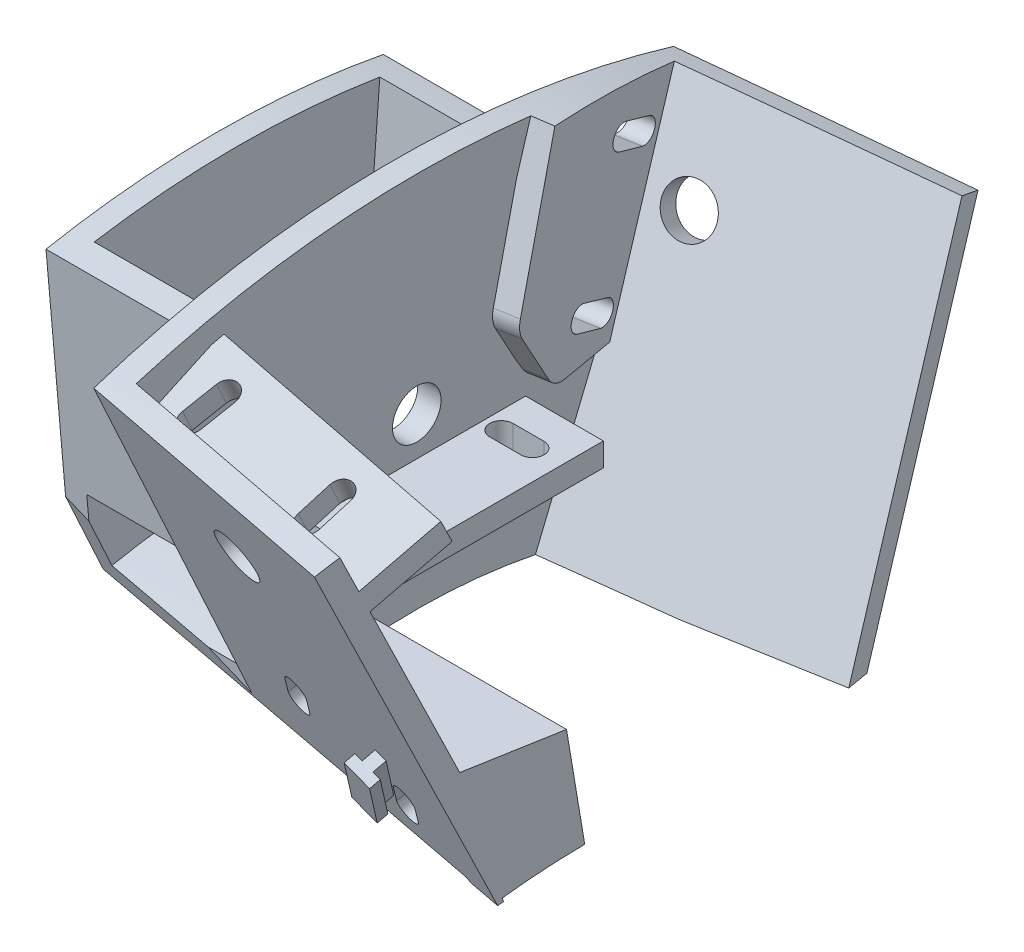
ISO-10303-21;
HEADER;
FILE_DESCRIPTION(('STEP AP214'),'2;1');
FILE_NAME('part.step','',(''),(''),'','','');
FILE_SCHEMA(('AUTOMOTIVE_DESIGN { 1 0 10303 214 1 1 1 1 }'));
ENDSEC;
DATA;
#1=APPLICATION_CONTEXT('core data for automotive mechanical design processes');
#2=APPLICATION_PROTOCOL_DEFINITION('international standard','automotive_design',2000,#1);
#3=PRODUCT_CONTEXT('',#1,'mechanical');
#4=PRODUCT('Part','Part','',(#3));
#5=PRODUCT_RELATED_PRODUCT_CATEGORY('part','',(#4));
#6=PRODUCT_DEFINITION_FORMATION('','',#4);
#7=PRODUCT_DEFINITION_CONTEXT('part definition',#1,'design');
#8=PRODUCT_DEFINITION('design','',#6,#7);
#9=PRODUCT_DEFINITION_SHAPE('','',#8);
#10=(LENGTH_UNIT() NAMED_UNIT(*) SI_UNIT(.MILLI.,.METRE.));
#11=(NAMED_UNIT(*) PLANE_ANGLE_UNIT() SI_UNIT($,.RADIAN.));
#12=(NAMED_UNIT(*) SI_UNIT($,.STERADIAN.) SOLID_ANGLE_UNIT());
#13=UNCERTAINTY_MEASURE_WITH_UNIT(LENGTH_MEASURE(1.E-05),#10,'distance_accuracy_value','');
#14=(GEOMETRIC_REPRESENTATION_CONTEXT(3) GLOBAL_UNCERTAINTY_ASSIGNED_CONTEXT((#13)) GLOBAL_UNIT_ASSIGNED_CONTEXT((#10,
#11,#12)) REPRESENTATION_CONTEXT('',''));
#15=CARTESIAN_POINT('',(0.,0.,0.));
#16=DIRECTION('',(0.,0.,1.));
#17=DIRECTION('',(1.,0.,0.));
#18=AXIS2_PLACEMENT_3D('',#15,#16,#17);
#19=CARTESIAN_POINT('',(42.6559339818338,135.665708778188,-48.3247610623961));
#20=DIRECTION('',(0.161003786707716,0.374606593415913,0.913097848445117));
#21=DIRECTION('',(0.,-0.925167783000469,0.379558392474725));
#22=AXIS2_PLACEMENT_3D('',#19,#20,#21);
#23=PLANE('',#22);
#24=DIRECTION('',(0.946741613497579,-0.320015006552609,-0.0356470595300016));
#25=VECTOR('',#24,1.);
#26=CARTESIAN_POINT('',(29.1472122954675,89.2253029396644,-26.8902153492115));
#27=LINE('',#26,#25);
#28=CARTESIAN_POINT('',(30.616998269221,88.728489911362,-26.9455562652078));
#29=VERTEX_POINT('',#28);
#30=CARTESIAN_POINT('',(32.0371106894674,88.2484674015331,-26.9990268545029));
#31=VERTEX_POINT('',#30);
#32=EDGE_CURVE('E680',#29,#31,#27,.T.);
#33=ORIENTED_EDGE('',*,*,#32,.F.);
#34=DIRECTION('',(0.27885139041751,0.870207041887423,-0.406179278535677));
#35=VECTOR('',#34,1.);
#36=CARTESIAN_POINT('',(3.65360922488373,4.58427609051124,12.3297361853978));
#37=LINE('',#36,#35);
#38=CARTESIAN_POINT('',(28.2467614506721,81.3317300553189,-23.4930323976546));
#39=VERTEX_POINT('',#38);
#40=EDGE_CURVE('E685',#39,#29,#37,.T.);
#41=ORIENTED_EDGE('',*,*,#40,.F.);
#42=DIRECTION('',(-0.946741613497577,0.320015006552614,0.0356470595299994));
#43=VECTOR('',#42,1.);
#44=CARTESIAN_POINT('',(26.7769754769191,81.8285430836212,-23.4376914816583));
#45=LINE('',#44,#43);
#46=CARTESIAN_POINT('',(29.6668738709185,80.85170754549,-23.5465029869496));
#47=VERTEX_POINT('',#46);
#48=EDGE_CURVE('E60',#47,#39,#45,.T.);
#49=ORIENTED_EDGE('',*,*,#48,.F.);
#50=DIRECTION('',(-0.27885139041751,-0.870207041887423,0.406179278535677));
#51=VECTOR('',#50,1.);
#52=CARTESIAN_POINT('',(5.07372164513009,4.10425358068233,12.2762655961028));
#53=LINE('',#52,#51);
#54=EDGE_CURVE('E55',#31,#47,#53,.T.);
#55=ORIENTED_EDGE('',*,*,#54,.F.);
#56=EDGE_LOOP('',(#33,#41,#49,#55));
#57=FACE_BOUND('',#56,.T.);
#58=CARTESIAN_POINT('',(17.6773531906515,107.524030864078,-32.3749872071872));
#59=DIRECTION('',(0.161003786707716,0.374606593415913,0.913097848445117));
#60=DIRECTION('',(0.,-0.925167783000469,0.379558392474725));
#61=AXIS2_PLACEMENT_3D('',#58,#59,#60);
#62=CIRCLE('',#61,3.12500000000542);
#63=CARTESIAN_POINT('',(17.6773531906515,104.632881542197,-31.1888672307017));
#64=VERTEX_POINT('',#63);
#65=EDGE_CURVE('E977',#64,#64,#62,.T.);
#66=ORIENTED_EDGE('',*,*,#65,.T.);
#67=EDGE_LOOP('',(#66));
#68=FACE_BOUND('',#67,.T.);
#69=DIRECTION('',(0.,0.925167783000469,-0.379558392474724));
#70=VECTOR('',#69,1.);
#71=CARTESIAN_POINT('',(9.99999999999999,115.868731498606,-34.4447510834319));
#72=LINE('',#71,#70);
#73=CARTESIAN_POINT('',(9.99999999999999,76.7455118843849,-18.3940988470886));
#74=VERTEX_POINT('',#73);
#75=CARTESIAN_POINT('',(9.99999999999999,119.701630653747,-36.0172323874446));
#76=VERTEX_POINT('',#75);
#77=EDGE_CURVE('E1052',#74,#76,#72,.T.);
#78=ORIENTED_EDGE('',*,*,#77,.T.);
#79=CARTESIAN_POINT('',(84.2452269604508,0.,0.));
#80=DIRECTION('',(0.161003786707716,0.374606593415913,0.913097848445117));
#81=DIRECTION('',(-0.986953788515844,0.061110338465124,0.148955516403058));
#82=AXIS2_PLACEMENT_3D('',#79,#80,#81);
#83=ELLIPSE('',#82,776.397177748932,125.002885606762);
#84=CARTESIAN_POINT('',(43.8962769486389,117.986533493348,-41.2904265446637));
#85=VERTEX_POINT('',#84);
#86=EDGE_CURVE('E1012',#85,#76,#83,.T.);
#87=ORIENTED_EDGE('',*,*,#86,.F.);
#88=DIRECTION('',(-0.0650497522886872,0.927183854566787,-0.368915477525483));
#89=VECTOR('',#88,1.);
#90=CARTESIAN_POINT('',(42.6559339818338,135.665708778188,-48.3247610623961));
#91=LINE('',#90,#89);
#92=CARTESIAN_POINT('',(46.95529503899,74.3849503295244,-23.9418728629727));
#93=VERTEX_POINT('',#92);
#94=EDGE_CURVE('E1209',#93,#85,#91,.T.);
#95=ORIENTED_EDGE('',*,*,#94,.F.);
#96=DIRECTION('',(-0.984807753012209,0.,0.173648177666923));
#97=VECTOR('',#96,1.);
#98=CARTESIAN_POINT('',(46.95529503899,74.3849503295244,-23.9418728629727));
#99=LINE('',#98,#97);
#100=CARTESIAN_POINT('',(13.,74.3849503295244,-17.9546382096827));
#101=VERTEX_POINT('',#100);
#102=EDGE_CURVE('E1212',#93,#101,#99,.T.);
#103=ORIENTED_EDGE('',*,*,#102,.T.);
#104=DIRECTION('',(0.,-0.925167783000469,0.379558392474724));
#105=VECTOR('',#104,1.);
#106=CARTESIAN_POINT('',(13.,4.41137162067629,10.7526509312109));
#107=LINE('',#106,#105);
#108=CARTESIAN_POINT('',(13.,74.365132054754,-17.946507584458));
#109=VERTEX_POINT('',#108);
#110=EDGE_CURVE('E1055',#101,#109,#107,.T.);
#111=ORIENTED_EDGE('',*,*,#110,.T.);
#112=CARTESIAN_POINT('',(84.2452269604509,0.,0.));
#113=DIRECTION('',(-0.161003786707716,-0.374606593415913,-0.913097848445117));
#114=DIRECTION('',(-0.986953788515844,0.061110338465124,0.148955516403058));
#115=AXIS2_PLACEMENT_3D('',#112,#113,#114);
#116=ELLIPSE('',#115,475.144104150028,76.5);
#117=CARTESIAN_POINT('',(-13.,75.2581041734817,-13.728355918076));
#118=VERTEX_POINT('',#117);
#119=EDGE_CURVE('E1059',#109,#118,#116,.F.);
#120=ORIENTED_EDGE('',*,*,#119,.T.);
#121=DIRECTION('',(0.,0.925167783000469,-0.379558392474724));
#122=VECTOR('',#121,1.);
#123=CARTESIAN_POINT('',(-13.,6.02124314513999,14.6766881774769));
#124=LINE('',#123,#122);
#125=CARTESIAN_POINT('',(-13.,89.3102377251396,-19.4933699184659));
#126=VERTEX_POINT('',#125);
#127=EDGE_CURVE('E1071',#118,#126,#124,.T.);
#128=ORIENTED_EDGE('',*,*,#127,.T.);
#129=DIRECTION('',(-0.876815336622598,0.478997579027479,-0.0419068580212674));
#130=VECTOR('',#129,1.);
#131=CARTESIAN_POINT('',(25.2258987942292,68.4277186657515,-17.6663862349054));
#132=LINE('',#131,#130);
#133=CARTESIAN_POINT('',(-9.48257936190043,87.3886974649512,-19.3252569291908));
#134=VERTEX_POINT('',#133);
#135=EDGE_CURVE('E1063',#134,#126,#132,.T.);
#136=ORIENTED_EDGE('',*,*,#135,.F.);
#137=CARTESIAN_POINT('',(84.2452269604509,0.,0.));
#138=DIRECTION('',(-0.161003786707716,-0.374606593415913,-0.913097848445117));
#139=DIRECTION('',(-0.986953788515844,0.061110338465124,0.148955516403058));
#140=AXIS2_PLACEMENT_3D('',#137,#138,#139);
#141=ELLIPSE('',#140,555.887546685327,89.5);
#142=CARTESIAN_POINT('',(-10.125,87.4116045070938,-19.2213786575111));
#143=VERTEX_POINT('',#142);
#144=EDGE_CURVE('E1069',#134,#143,#141,.F.);
#145=ORIENTED_EDGE('',*,*,#144,.T.);
#146=DIRECTION('',(0.,0.925167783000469,-0.379558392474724));
#147=VECTOR('',#146,1.);
#148=CARTESIAN_POINT('',(-10.125,5.84322850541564,14.2427802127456));
#149=LINE('',#148,#147);
#150=CARTESIAN_POINT('',(-10.125,78.0018668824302,-15.3609492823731));
#151=VERTEX_POINT('',#150);
#152=EDGE_CURVE('E1066',#151,#143,#149,.T.);
#153=ORIENTED_EDGE('',*,*,#152,.F.);
#154=CARTESIAN_POINT('',(84.2452269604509,0.,0.));
#155=DIRECTION('',(-0.161003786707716,-0.374606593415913,-0.913097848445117));
#156=DIRECTION('',(-0.986953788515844,0.061110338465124,0.148955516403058));
#157=AXIS2_PLACEMENT_3D('',#154,#155,#156);
#158=ELLIPSE('',#157,493.777206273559,79.5);
#159=CARTESIAN_POINT('',(8.92898742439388,77.3305979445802,-18.4452872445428));
#160=VERTEX_POINT('',#159);
#161=EDGE_CURVE('E1062',#160,#151,#158,.F.);
#162=ORIENTED_EDGE('',*,*,#161,.F.);
#163=EDGE_CURVE('E1054',#74,#160,#132,.T.);
#164=ORIENTED_EDGE('',*,*,#163,.F.);
#165=EDGE_LOOP('',(#78,#87,#95,#103,#111,#120,#128,#136,#145,#153,#162,#164));
#166=FACE_BOUND('',#165,.T.);
#167=ADVANCED_FACE('F40',(#57,#68,#166),#23,.F.);
#168=CARTESIAN_POINT('',(3.29005948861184,115.200127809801,-27.5878271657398));
#169=DIRECTION('',(0.984807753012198,2.42694836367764E-13,-0.173648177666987));
#170=DIRECTION('',(-0.173648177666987,0.,-0.984807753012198));
#171=AXIS2_PLACEMENT_3D('',#168,#169,#170);
#172=CYLINDRICAL_SURFACE('',#171,1.50000000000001);
#173=DIRECTION('',(0.984807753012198,2.42694836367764E-13,-0.173648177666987));
#174=VECTOR('',#173,1.);
#175=CARTESIAN_POINT('',(3.19248486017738,116.590903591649,-28.141200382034));
#176=LINE('',#175,#174);
#177=CARTESIAN_POINT('',(9.99999999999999,116.590903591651,-29.3415489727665));
#178=VERTEX_POINT('',#177);
#179=CARTESIAN_POINT('',(13.0405623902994,116.590903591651,-29.8776821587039));
#180=VERTEX_POINT('',#179);
#181=EDGE_CURVE('E859',#178,#180,#176,.T.);
#182=ORIENTED_EDGE('',*,*,#181,.F.);
#183=CARTESIAN_POINT('',(9.99999999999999,115.200127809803,-28.7709707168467));
#184=DIRECTION('',(1.,0.,0.));
#185=DIRECTION('',(0.,1.3976238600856E-12,-1.));
#186=AXIS2_PLACEMENT_3D('',#183,#184,#185);
#187=ELLIPSE('',#186,1.52313991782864,1.50000000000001);
#188=CARTESIAN_POINT('',(9.99999999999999,113.80935202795,-28.2003924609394));
#189=VERTEX_POINT('',#188);
#190=EDGE_CURVE('E856',#189,#178,#187,.T.);
#191=ORIENTED_EDGE('',*,*,#190,.F.);
#192=DIRECTION('',(0.984807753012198,2.42694836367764E-13,-0.173648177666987));
#193=VECTOR('',#192,1.);
#194=CARTESIAN_POINT('',(3.38763411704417,113.809352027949,-27.0344539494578));
#195=LINE('',#194,#193);
#196=CARTESIAN_POINT('',(13.235711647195,113.809352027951,-28.7709357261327));
#197=VERTEX_POINT('',#196);
#198=EDGE_CURVE('E853',#189,#197,#195,.T.);
#199=ORIENTED_EDGE('',*,*,#198,.T.);
#200=CARTESIAN_POINT('',(13.1381370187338,115.200127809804,-29.3243089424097));
#201=DIRECTION('',(0.984807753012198,2.42694753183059E-13,-0.173648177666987));
#202=DIRECTION('',(-0.173648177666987,0.,-0.984807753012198));
#203=AXIS2_PLACEMENT_3D('',#200,#201,#202);
#204=CIRCLE('',#203,1.50000000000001);
#205=EDGE_CURVE('E843',#197,#180,#204,.T.);
#206=ORIENTED_EDGE('',*,*,#205,.T.);
#207=EDGE_LOOP('',(#182,#191,#199,#206));
#208=FACE_BOUND('',#207,.T.);
#209=ADVANCED_FACE('F1487',(#208),#172,.F.);
#210=CARTESIAN_POINT('',(-65.2158340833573,-0.726697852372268,-9.66201509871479));
#211=DIRECTION('',(0.,-0.075,-0.997183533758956));
#212=DIRECTION('',(0.,0.997183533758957,-0.075));
#213=AXIS2_PLACEMENT_3D('',#210,#211,#212);
#214=PLANE('',#213);
#215=DIRECTION('',(-1.,0.,0.));
#216=VECTOR('',#215,1.);
#217=CARTESIAN_POINT('',(-65.2158340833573,102.989701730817,-17.4627154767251));
#218=LINE('',#217,#216);
#219=CARTESIAN_POINT('',(9.99999999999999,102.989701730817,-17.4627154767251));
#220=VERTEX_POINT('',#219);
#221=CARTESIAN_POINT('',(-0.125000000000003,102.989701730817,-17.4627154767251));
#222=VERTEX_POINT('',#221);
#223=EDGE_CURVE('E678',#220,#222,#218,.T.);
#224=ORIENTED_EDGE('',*,*,#223,.F.);
#225=DIRECTION('',(0.,-0.997183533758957,0.075));
#226=VECTOR('',#225,1.);
#227=CARTESIAN_POINT('',(9.99999999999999,-0.726697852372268,-9.66201509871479));
#228=LINE('',#227,#226);
#229=CARTESIAN_POINT('',(9.99999999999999,115.042691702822,-18.3692429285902));
#230=VERTEX_POINT('',#229);
#231=EDGE_CURVE('E1178',#230,#220,#228,.T.);
#232=ORIENTED_EDGE('',*,*,#231,.F.);
#233=DIRECTION('',(-1.,0.,0.));
#234=VECTOR('',#233,1.);
#235=CARTESIAN_POINT('',(-22.5,115.042691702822,-18.3692429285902));
#236=LINE('',#235,#234);
#237=CARTESIAN_POINT('',(-10.125,115.042691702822,-18.3692429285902));
#238=VERTEX_POINT('',#237);
#239=EDGE_CURVE('E1269',#238,#230,#236,.F.);
#240=ORIENTED_EDGE('',*,*,#239,.F.);
#241=DIRECTION('',(0.,-0.997183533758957,0.075));
#242=VECTOR('',#241,1.);
#243=CARTESIAN_POINT('',(-10.125,-0.726697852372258,-9.66201509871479));
#244=LINE('',#243,#242);
#245=CARTESIAN_POINT('',(-10.125,87.9966801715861,-16.3350628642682));
#246=VERTEX_POINT('',#245);
#247=EDGE_CURVE('E1221',#238,#246,#244,.T.);
#248=ORIENTED_EDGE('',*,*,#247,.T.);
#249=DIRECTION('',(-1.,0.,0.));
#250=VECTOR('',#249,1.);
#251=CARTESIAN_POINT('',(-22.5,87.996680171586,-16.3350628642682));
#252=LINE('',#251,#250);
#253=CARTESIAN_POINT('',(9.99999999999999,87.9966801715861,-16.3350628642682));
#254=VERTEX_POINT('',#253);
#255=EDGE_CURVE('E1227',#254,#246,#252,.T.);
#256=ORIENTED_EDGE('',*,*,#255,.F.);
#257=CARTESIAN_POINT('',(9.99999999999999,97.1515855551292,-17.0236200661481));
#258=VERTEX_POINT('',#257);
#259=EDGE_CURVE('E1176',#258,#254,#228,.T.);
#260=ORIENTED_EDGE('',*,*,#259,.F.);
#261=DIRECTION('',(1.,0.,0.));
#262=VECTOR('',#261,1.);
#263=CARTESIAN_POINT('',(-65.2158340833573,97.1515855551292,-17.0236200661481));
#264=LINE('',#263,#262);
#265=CARTESIAN_POINT('',(-0.125000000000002,97.1515855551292,-17.0236200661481));
#266=VERTEX_POINT('',#265);
#267=EDGE_CURVE('E676',#266,#258,#264,.T.);
#268=ORIENTED_EDGE('',*,*,#267,.F.);
#269=DIRECTION('',(0.,0.997183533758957,-0.075));
#270=VECTOR('',#269,1.);
#271=CARTESIAN_POINT('',(-0.124999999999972,-0.726697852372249,-9.66201509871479));
#272=LINE('',#271,#270);
#273=EDGE_CURVE('E672',#266,#222,#272,.T.);
#274=ORIENTED_EDGE('',*,*,#273,.T.);
#275=EDGE_LOOP('',(#224,#232,#240,#248,#256,#260,#268,#274));
#276=FACE_BOUND('',#275,.T.);
#277=ADVANCED_FACE('F1492',(#276),#214,.F.);
#278=CARTESIAN_POINT('',(-13.,-1.01408248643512,-11.5910158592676));
#279=DIRECTION('',(0.,-0.0871557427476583,-0.996194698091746));
#280=DIRECTION('',(0.,0.996194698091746,-0.0871557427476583));
#281=AXIS2_PLACEMENT_3D('',#278,#279,#280);
#282=PLANE('',#281);
#283=DIRECTION('',(0.,-0.996194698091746,0.0871557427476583));
#284=VECTOR('',#283,1.);
#285=CARTESIAN_POINT('',(9.99999999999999,-1.01408248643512,-11.5910158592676));
#286=LINE('',#285,#284);
#287=CARTESIAN_POINT('',(9.99999999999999,114.462330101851,-21.693892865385));
#288=VERTEX_POINT('',#287);
#289=CARTESIAN_POINT('',(9.99999999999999,101.748735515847,-20.5815974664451));
#290=VERTEX_POINT('',#289);
#291=EDGE_CURVE('E1185',#288,#290,#286,.T.);
#292=ORIENTED_EDGE('',*,*,#291,.T.);
#293=DIRECTION('',(-1.,0.,0.));
#294=VECTOR('',#293,1.);
#295=CARTESIAN_POINT('',(-13.,101.748735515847,-20.5815974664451));
#296=LINE('',#295,#294);
#297=CARTESIAN_POINT('',(-0.125000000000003,101.748735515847,-20.5815974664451));
#298=VERTEX_POINT('',#297);
#299=EDGE_CURVE('E12',#290,#298,#296,.T.);
#300=ORIENTED_EDGE('',*,*,#299,.T.);
#301=DIRECTION('',(0.,0.996194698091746,-0.0871557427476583));
#302=VECTOR('',#301,1.);
#303=CARTESIAN_POINT('',(-0.124999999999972,-1.01408248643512,-11.5910158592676));
#304=LINE('',#303,#302);
#305=CARTESIAN_POINT('',(-0.125000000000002,95.9381780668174,-20.0732395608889));
#306=VERTEX_POINT('',#305);
#307=EDGE_CURVE('E1370',#306,#298,#304,.T.);
#308=ORIENTED_EDGE('',*,*,#307,.F.);
#309=DIRECTION('',(1.,0.,0.));
#310=VECTOR('',#309,1.);
#311=CARTESIAN_POINT('',(-13.,95.9381780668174,-20.0732395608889));
#312=LINE('',#311,#310);
#313=CARTESIAN_POINT('',(9.99999999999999,95.9381780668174,-20.0732395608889));
#314=VERTEX_POINT('',#313);
#315=EDGE_CURVE('E48',#306,#314,#312,.T.);
#316=ORIENTED_EDGE('',*,*,#315,.T.);
#317=CARTESIAN_POINT('',(10.,87.3886974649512,-19.3252569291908));
#318=VERTEX_POINT('',#317);
#319=EDGE_CURVE('E1184',#314,#318,#286,.T.);
#320=ORIENTED_EDGE('',*,*,#319,.T.);
#321=DIRECTION('',(-1.,0.,0.));
#322=VECTOR('',#321,1.);
#323=CARTESIAN_POINT('',(-22.5,87.3886974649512,-19.3252569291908));
#324=LINE('',#323,#322);
#325=EDGE_CURVE('E1258',#318,#134,#324,.T.);
#326=ORIENTED_EDGE('',*,*,#325,.T.);
#327=ORIENTED_EDGE('',*,*,#135,.T.);
#328=DIRECTION('',(0.,0.996194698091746,-0.0871557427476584));
#329=VECTOR('',#328,1.);
#330=CARTESIAN_POINT('',(-13.,-1.01408248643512,-11.5910158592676));
#331=LINE('',#330,#329);
#332=CARTESIAN_POINT('',(-13.,114.462330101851,-21.693892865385));
#333=VERTEX_POINT('',#332);
#334=EDGE_CURVE('E1229',#126,#333,#331,.T.);
#335=ORIENTED_EDGE('',*,*,#334,.T.);
#336=DIRECTION('',(1.,0.,0.));
#337=VECTOR('',#336,1.);
#338=CARTESIAN_POINT('',(-13.,114.462330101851,-21.693892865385));
#339=LINE('',#338,#337);
#340=EDGE_CURVE('E1233',#333,#288,#339,.T.);
#341=ORIENTED_EDGE('',*,*,#340,.T.);
#342=EDGE_LOOP('',(#292,#300,#308,#316,#320,#326,#327,#335,#341));
#343=FACE_BOUND('',#342,.T.);
#344=ADVANCED_FACE('F1375',(#343),#282,.T.);
#345=CARTESIAN_POINT('',(46.8735489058,73.8603549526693,24.3013829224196));
#346=DIRECTION('',(0.158138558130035,0.413104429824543,-0.896848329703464));
#347=DIRECTION('',(0.,0.908277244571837,0.418368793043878));
#348=AXIS2_PLACEMENT_3D('',#345,#346,#347);
#349=PLANE('',#348);
#350=DIRECTION('',(-0.987145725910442,0.0448556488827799,-0.153399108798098));
#351=VECTOR('',#350,1.);
#352=CARTESIAN_POINT('',(34.1522665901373,72.8666993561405,21.6005820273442));
#353=LINE('',#352,#351);
#354=CARTESIAN_POINT('',(46.9977975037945,72.283001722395,23.5967341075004));
#355=VERTEX_POINT('',#354);
#356=CARTESIAN_POINT('',(42.9189301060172,72.4683444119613,22.9628919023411));
#357=VERTEX_POINT('',#356);
#358=EDGE_CURVE('E770',#355,#357,#353,.T.);
#359=ORIENTED_EDGE('',*,*,#358,.F.);
#360=DIRECTION('',(0.0717348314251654,-0.910683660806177,-0.406828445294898));
#361=VECTOR('',#360,1.);
#362=CARTESIAN_POINT('',(46.8735489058,73.8603549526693,24.3013829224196));
#363=LINE('',#362,#361);
#364=CARTESIAN_POINT('',(43.4644346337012,117.139534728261,43.6354307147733));
#365=VERTEX_POINT('',#364);
#366=EDGE_CURVE('E1203',#365,#355,#363,.T.);
#367=ORIENTED_EDGE('',*,*,#366,.F.);
#368=CARTESIAN_POINT('',(101.998530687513,0.,0.));
#369=DIRECTION('',(0.158138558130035,0.413104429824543,-0.896848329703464));
#370=DIRECTION('',(-0.98741693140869,0.0661602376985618,-0.143633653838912));
#371=AXIS2_PLACEMENT_3D('',#368,#369,#370);
#372=ELLIPSE('',#371,790.464306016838,125.002885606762);
#373=CARTESIAN_POINT('',(9.99999999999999,118.910040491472,38.5502747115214));
#374=VERTEX_POINT('',#373);
#375=EDGE_CURVE('E1019',#374,#365,#372,.T.);
#376=ORIENTED_EDGE('',*,*,#375,.F.);
#377=DIRECTION('',(0.,0.908277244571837,0.418368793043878));
#378=VECTOR('',#377,1.);
#379=CARTESIAN_POINT('',(9.99999999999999,76.3310060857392,18.9376076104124));
#380=LINE('',#379,#378);
#381=CARTESIAN_POINT('',(10.,74.7771925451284,18.2218932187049));
#382=VERTEX_POINT('',#381);
#383=EDGE_CURVE('E1049',#382,#374,#380,.T.);
#384=ORIENTED_EDGE('',*,*,#383,.F.);
#385=DIRECTION('',(-0.903498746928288,0.426959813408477,0.0373541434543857));
#386=VECTOR('',#385,1.);
#387=CARTESIAN_POINT('',(20.6857232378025,69.7275182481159,17.780103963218));
#388=LINE('',#387,#386);
#389=CARTESIAN_POINT('',(4.59668449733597,77.3305979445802,18.4452872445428));
#390=VERTEX_POINT('',#389);
#391=EDGE_CURVE('E1028',#382,#390,#388,.T.);
#392=ORIENTED_EDGE('',*,*,#391,.T.);
#393=CARTESIAN_POINT('',(101.998530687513,0.,0.));
#394=DIRECTION('',(-0.158138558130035,-0.413104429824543,0.896848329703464));
#395=DIRECTION('',(-0.98741693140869,0.0661602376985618,-0.143633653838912));
#396=AXIS2_PLACEMENT_3D('',#393,#394,#395);
#397=ELLIPSE('',#396,502.723693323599,79.5);
#398=CARTESIAN_POINT('',(-10.125,77.8545807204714,16.0908129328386));
#399=VERTEX_POINT('',#398);
#400=EDGE_CURVE('E1031',#399,#390,#397,.F.);
#401=ORIENTED_EDGE('',*,*,#400,.F.);
#402=DIRECTION('',(0.,-0.908277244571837,-0.418368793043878));
#403=VECTOR('',#402,1.);
#404=CARTESIAN_POINT('',(-10.125,7.5126516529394,-16.3099415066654));
#405=LINE('',#404,#403);
#406=CARTESIAN_POINT('',(-10.125,84.2875170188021,19.0539387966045));
#407=VERTEX_POINT('',#406);
#408=EDGE_CURVE('E1027',#407,#399,#405,.T.);
#409=ORIENTED_EDGE('',*,*,#408,.F.);
#410=CARTESIAN_POINT('',(-13.,85.6461348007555,19.1728024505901));
#411=VERTEX_POINT('',#410);
#412=EDGE_CURVE('E1025',#407,#411,#388,.T.);
#413=ORIENTED_EDGE('',*,*,#412,.T.);
#414=DIRECTION('',(0.,-0.908277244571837,-0.418368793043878));
#415=VECTOR('',#414,1.);
#416=CARTESIAN_POINT('',(-13.,7.70528627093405,-16.7281506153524));
#417=LINE('',#416,#415);
#418=CARTESIAN_POINT('',(-13.,75.1447801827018,14.3356901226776));
#419=VERTEX_POINT('',#418);
#420=EDGE_CURVE('E1023',#411,#419,#417,.T.);
#421=ORIENTED_EDGE('',*,*,#420,.T.);
#422=CARTESIAN_POINT('',(101.998530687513,0.,0.));
#423=DIRECTION('',(-0.158138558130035,-0.413104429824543,0.896848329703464));
#424=DIRECTION('',(-0.98741693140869,0.0661602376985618,-0.143633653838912));
#425=AXIS2_PLACEMENT_3D('',#422,#423,#424);
#426=ELLIPSE('',#425,483.752987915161,76.5);
#427=CARTESIAN_POINT('',(42.4788178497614,72.9297038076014,23.0977986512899));
#428=VERTEX_POINT('',#427);
#429=EDGE_CURVE('E1021',#419,#428,#426,.F.);
#430=ORIENTED_EDGE('',*,*,#429,.T.);
#431=DIRECTION('',(-0.67529913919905,0.707900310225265,0.206998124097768));
#432=VECTOR('',#431,1.);
#433=CARTESIAN_POINT('',(61.1996306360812,53.305113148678,17.3593445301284));
#434=LINE('',#433,#432);
#435=EDGE_CURVE('E773',#357,#428,#434,.T.);
#436=ORIENTED_EDGE('',*,*,#435,.F.);
#437=EDGE_LOOP('',(#359,#367,#376,#384,#392,#401,#409,#413,#421,#430,#436));
#438=FACE_BOUND('',#437,.T.);
#439=CARTESIAN_POINT('',(21.5465316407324,82.247178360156,23.6986677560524));
#440=DIRECTION('',(0.158138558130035,0.413104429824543,-0.896848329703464));
#441=DIRECTION('',(-0.467015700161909,-0.768973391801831,-0.436550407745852));
#442=AXIS2_PLACEMENT_3D('',#439,#440,#441);
#443=ELLIPSE('',#442,1.58366201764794,1.5);
#444=CARTESIAN_POINT('',(20.1285317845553,82.7445937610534,23.6777545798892));
#445=VERTEX_POINT('',#444);
#446=CARTESIAN_POINT('',(22.9645314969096,81.7497629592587,23.7195809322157));
#447=VERTEX_POINT('',#446);
#448=EDGE_CURVE('E838',#445,#447,#443,.F.);
#449=ORIENTED_EDGE('',*,*,#448,.F.);
#450=DIRECTION('',(-0.309408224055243,-0.841802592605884,-0.442306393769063));
#451=VECTOR('',#450,1.);
#452=CARTESIAN_POINT('',(20.4602755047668,83.6471642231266,24.1519900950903));
#453=LINE('',#452,#451);
#454=CARTESIAN_POINT('',(21.1068495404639,85.4062890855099,25.0762830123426));
#455=VERTEX_POINT('',#454);
#456=EDGE_CURVE('E830',#455,#445,#453,.T.);
#457=ORIENTED_EDGE('',*,*,#456,.F.);
#458=CARTESIAN_POINT('',(22.524849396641,84.9088736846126,25.0971961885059));
#459=DIRECTION('',(0.158138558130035,0.413104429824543,-0.896848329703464));
#460=DIRECTION('',(-0.467015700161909,-0.768973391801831,-0.436550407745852));
#461=AXIS2_PLACEMENT_3D('',#458,#459,#460);
#462=ELLIPSE('',#461,1.58366201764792,1.49999999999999);
#463=CARTESIAN_POINT('',(23.9428492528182,84.4114582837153,25.1181093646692));
#464=VERTEX_POINT('',#463);
#465=EDGE_CURVE('E832',#464,#455,#462,.F.);
#466=ORIENTED_EDGE('',*,*,#465,.F.);
#467=DIRECTION('',(-0.309408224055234,-0.841802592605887,-0.442306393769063));
#468=VECTOR('',#467,1.);
#469=CARTESIAN_POINT('',(23.2781653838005,82.6030622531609,24.1679280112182));
#470=LINE('',#469,#468);
#471=EDGE_CURVE('E835',#464,#447,#470,.T.);
#472=ORIENTED_EDGE('',*,*,#471,.T.);
#473=EDGE_LOOP('',(#449,#457,#466,#472));
#474=FACE_BOUND('',#473,.T.);
#475=CARTESIAN_POINT('',(36.6827747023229,79.9424626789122,25.3060024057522));
#476=DIRECTION('',(0.158138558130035,0.413104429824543,-0.896848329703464));
#477=DIRECTION('',(-0.467015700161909,-0.768973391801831,-0.436550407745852));
#478=AXIS2_PLACEMENT_3D('',#475,#476,#477);
#479=ELLIPSE('',#478,1.58366201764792,1.49999999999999);
#480=CARTESIAN_POINT('',(35.2647748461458,80.4398780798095,25.2850892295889));
#481=VERTEX_POINT('',#480);
#482=CARTESIAN_POINT('',(38.1007745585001,79.4450472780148,25.3269155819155));
#483=VERTEX_POINT('',#482);
#484=EDGE_CURVE('E824',#481,#483,#479,.T.);
#485=ORIENTED_EDGE('',*,*,#484,.T.);
#486=DIRECTION('',(-0.309408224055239,-0.841802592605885,-0.442306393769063));
#487=VECTOR('',#486,1.);
#488=CARTESIAN_POINT('',(37.3456824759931,77.390678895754,24.2474935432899));
#489=LINE('',#488,#487);
#490=CARTESIAN_POINT('',(37.1224568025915,76.7833519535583,23.928387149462));
#491=VERTEX_POINT('',#490);
#492=EDGE_CURVE('E827',#483,#491,#489,.T.);
#493=ORIENTED_EDGE('',*,*,#492,.T.);
#494=CARTESIAN_POINT('',(35.7044569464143,77.2807673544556,23.9074739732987));
#495=DIRECTION('',(0.158138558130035,0.413104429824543,-0.896848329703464));
#496=DIRECTION('',(-0.467015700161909,-0.768973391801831,-0.436550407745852));
#497=AXIS2_PLACEMENT_3D('',#494,#495,#496);
#498=ELLIPSE('',#497,1.58366201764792,1.49999999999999);
#499=CARTESIAN_POINT('',(34.2864570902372,77.7781827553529,23.8865607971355));
#500=VERTEX_POINT('',#499);
#501=EDGE_CURVE('E794',#491,#500,#498,.T.);
#502=ORIENTED_EDGE('',*,*,#501,.T.);
#503=DIRECTION('',(-0.309408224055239,-0.841802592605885,-0.442306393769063));
#504=VECTOR('',#503,1.);
#505=CARTESIAN_POINT('',(34.5277925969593,78.4347808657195,24.2315556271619));
#506=LINE('',#505,#504);
#507=EDGE_CURVE('E821',#481,#500,#506,.T.);
#508=ORIENTED_EDGE('',*,*,#507,.F.);
#509=EDGE_LOOP('',(#485,#493,#502,#508));
#510=FACE_BOUND('',#509,.T.);
#511=CARTESIAN_POINT('',(25.2819236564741,106.236251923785,35.4071157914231));
#512=DIRECTION('',(0.158138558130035,0.413104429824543,-0.896848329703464));
#513=DIRECTION('',(0.,0.908277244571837,0.418368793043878));
#514=AXIS2_PLACEMENT_3D('',#511,#512,#513);
#515=CIRCLE('',#514,3.125);
#516=CARTESIAN_POINT('',(25.2819236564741,109.074618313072,36.7145182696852));
#517=VERTEX_POINT('',#516);
#518=EDGE_CURVE('E983',#517,#517,#515,.T.);
#519=ORIENTED_EDGE('',*,*,#518,.T.);
#520=EDGE_LOOP('',(#519));
#521=FACE_BOUND('',#520,.T.);
#522=DIRECTION('',(-0.32673642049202,-0.835217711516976,-0.442328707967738));
#523=VECTOR('',#522,1.);
#524=CARTESIAN_POINT('',(35.6403154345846,86.166031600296,27.9888762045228));
#525=LINE('',#524,#523);
#526=CARTESIAN_POINT('',(35.6403154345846,86.166031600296,27.9888762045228));
#527=VERTEX_POINT('',#526);
#528=CARTESIAN_POINT('',(32.8630558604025,79.0666810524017,24.229082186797));
#529=VERTEX_POINT('',#528);
#530=EDGE_CURVE('E737',#527,#529,#525,.T.);
#531=ORIENTED_EDGE('',*,*,#530,.F.);
#532=DIRECTION('',(-0.931791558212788,0.362982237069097,0.00289613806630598));
#533=VECTOR('',#532,1.);
#534=CARTESIAN_POINT('',(37.0380027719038,85.6215582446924,27.9845319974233));
#535=LINE('',#534,#533);
#536=CARTESIAN_POINT('',(37.0380027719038,85.6215582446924,27.9845319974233));
#537=VERTEX_POINT('',#536);
#538=EDGE_CURVE('E742',#537,#527,#535,.T.);
#539=ORIENTED_EDGE('',*,*,#538,.F.);
#540=DIRECTION('',(0.326736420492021,0.835217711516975,0.442328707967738));
#541=VECTOR('',#540,1.);
#542=CARTESIAN_POINT('',(34.2607431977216,78.5222076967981,24.2247379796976));
#543=LINE('',#542,#541);
#544=CARTESIAN_POINT('',(34.2607431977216,78.5222076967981,24.2247379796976));
#545=VERTEX_POINT('',#544);
#546=EDGE_CURVE('E751',#545,#537,#543,.T.);
#547=ORIENTED_EDGE('',*,*,#546,.F.);
#548=DIRECTION('',(0.93179155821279,-0.36298223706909,-0.002896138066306));
#549=VECTOR('',#548,1.);
#550=CARTESIAN_POINT('',(32.8630558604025,79.0666810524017,24.229082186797));
#551=LINE('',#550,#549);
#552=EDGE_CURVE('E748',#529,#545,#551,.T.);
#553=ORIENTED_EDGE('',*,*,#552,.F.);
#554=EDGE_LOOP('',(#531,#539,#547,#553));
#555=FACE_BOUND('',#554,.T.);
#556=ADVANCED_FACE('F1607',(#438,#474,#510,#521,#555),#349,.F.);
#557=CARTESIAN_POINT('',(0.,-0.477425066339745,1.63271698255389));
#558=DIRECTION('',(0.,-0.280658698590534,0.959807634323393));
#559=DIRECTION('',(0.,-0.959807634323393,-0.280658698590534));
#560=AXIS2_PLACEMENT_3D('',#557,#558,#559);
#561=PLANE('',#560);
#562=DIRECTION('',(-0.0494272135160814,0.958634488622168,0.280315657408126));
#563=VECTOR('',#562,1.);
#564=CARTESIAN_POINT('',(50.7463668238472,1.93296002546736,2.33754107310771));
#565=LINE('',#564,#563);
#566=CARTESIAN_POINT('',(47.1095609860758,72.4683444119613,22.9628919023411));
#567=VERTEX_POINT('',#566);
#568=CARTESIAN_POINT('',(47.0857732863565,72.9297038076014,23.0977986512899));
#569=VERTEX_POINT('',#568);
#570=EDGE_CURVE('E767',#567,#569,#565,.T.);
#571=ORIENTED_EDGE('',*,*,#570,.F.);
#572=DIRECTION('',(1.,0.,0.));
#573=VECTOR('',#572,1.);
#574=CARTESIAN_POINT('',(31.1072226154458,72.4683444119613,22.9628919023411));
#575=LINE('',#574,#573);
#576=EDGE_CURVE('E769',#357,#567,#575,.T.);
#577=ORIENTED_EDGE('',*,*,#576,.F.);
#578=ORIENTED_EDGE('',*,*,#435,.T.);
#579=DIRECTION('',(-1.,0.,0.));
#580=VECTOR('',#579,1.);
#581=CARTESIAN_POINT('',(48.7122619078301,72.9297038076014,23.0977986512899));
#582=LINE('',#581,#580);
#583=EDGE_CURVE('E988',#428,#569,#582,.F.);
#584=ORIENTED_EDGE('',*,*,#583,.T.);
#585=EDGE_LOOP('',(#571,#577,#578,#584));
#586=FACE_BOUND('',#585,.T.);
#587=ADVANCED_FACE('F1609',(#586),#561,.F.);
#588=CARTESIAN_POINT('',(31.1072226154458,67.5881485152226,39.6523773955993));
#589=DIRECTION('',(0.,0.959807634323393,0.280658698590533));
#590=DIRECTION('',(0.,-0.280658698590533,0.959807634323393));
#591=AXIS2_PLACEMENT_3D('',#588,#589,#590);
#592=PLANE('',#591);
#593=DIRECTION('',(0.166867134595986,0.276723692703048,-0.946350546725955));
#594=VECTOR('',#593,1.);
#595=CARTESIAN_POINT('',(43.8031164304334,66.9851104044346,41.7146707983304));
#596=LINE('',#595,#594);
#597=EDGE_CURVE('E1368',#355,#567,#596,.T.);
#598=ORIENTED_EDGE('',*,*,#597,.F.);
#599=ORIENTED_EDGE('',*,*,#358,.T.);
#600=ORIENTED_EDGE('',*,*,#576,.T.);
#601=EDGE_LOOP('',(#598,#599,#600));
#602=FACE_BOUND('',#601,.T.);
#603=ADVANCED_FACE('F1605',(#602),#592,.F.);
#604=CARTESIAN_POINT('',(49.6159196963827,0.,8.74862531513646));
#605=DIRECTION('',(-0.984807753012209,0.,-0.173648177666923));
#606=DIRECTION('',(-0.173648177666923,0.,0.984807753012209));
#607=AXIS2_PLACEMENT_3D('',#604,#605,#606);
#608=PLANE('',#607);
#609=ORIENTED_EDGE('',*,*,#366,.T.);
#610=ORIENTED_EDGE('',*,*,#597,.T.);
#611=ORIENTED_EDGE('',*,*,#570,.T.);
#612=CARTESIAN_POINT('',(51.1585383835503,0.,0.));
#613=DIRECTION('',(-0.984807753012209,0.,-0.173648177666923));
#614=DIRECTION('',(-0.173648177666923,0.,0.984807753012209));
#615=AXIS2_PLACEMENT_3D('',#612,#613,#614);
#616=ELLIPSE('',#615,77.6801358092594,76.5);
#617=CARTESIAN_POINT('',(48.6767545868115,75.1940644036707,14.0748953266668));
#618=VERTEX_POINT('',#617);
#619=EDGE_CURVE('E986',#569,#618,#616,.T.);
#620=ORIENTED_EDGE('',*,*,#619,.T.);
#621=DIRECTION('',(0.0254975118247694,-0.989161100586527,-0.144603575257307));
#622=VECTOR('',#621,1.);
#623=CARTESIAN_POINT('',(48.7257273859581,73.294193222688,13.7971567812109));
#624=LINE('',#623,#622);
#625=CARTESIAN_POINT('',(48.325608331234,88.8165785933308,16.0663447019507));
#626=VERTEX_POINT('',#625);
#627=EDGE_CURVE('E1037',#626,#618,#624,.T.);
#628=ORIENTED_EDGE('',*,*,#627,.F.);
#629=DIRECTION('',(0.173648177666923,0.,-0.984807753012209));
#630=VECTOR('',#629,1.);
#631=CARTESIAN_POINT('',(48.9618165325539,88.8165785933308,12.4582286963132));
#632=LINE('',#631,#630);
#633=CARTESIAN_POINT('',(46.2666457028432,88.8165785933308,27.7433020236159));
#634=VERTEX_POINT('',#633);
#635=EDGE_CURVE('E1034',#634,#626,#632,.T.);
#636=ORIENTED_EDGE('',*,*,#635,.F.);
#637=DIRECTION('',(-0.0717348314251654,0.910683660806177,0.406828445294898));
#638=VECTOR('',#637,1.);
#639=CARTESIAN_POINT('',(43.2199793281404,127.494431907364,45.0218056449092));
#640=LINE('',#639,#638);
#641=CARTESIAN_POINT('',(44.5367147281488,110.77829289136,37.5542281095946));
#642=VERTEX_POINT('',#641);
#643=EDGE_CURVE('E1201',#634,#642,#640,.T.);
#644=ORIENTED_EDGE('',*,*,#643,.T.);
#645=DIRECTION('',(-0.158138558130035,-0.413104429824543,0.896848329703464));
#646=VECTOR('',#645,1.);
#647=CARTESIAN_POINT('',(46.1181003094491,114.909337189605,28.58574481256));
#648=LINE('',#647,#646);
#649=CARTESIAN_POINT('',(46.1181003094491,114.909337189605,28.58574481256));
#650=VERTEX_POINT('',#649);
#651=EDGE_CURVE('E1095',#650,#642,#648,.T.);
#652=ORIENTED_EDGE('',*,*,#651,.F.);
#653=DIRECTION('',(0.071734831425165,-0.910683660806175,-0.406828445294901));
#654=VECTOR('',#653,1.);
#655=CARTESIAN_POINT('',(45.9023450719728,117.648379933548,29.8093535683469));
#656=LINE('',#655,#654);
#657=CARTESIAN_POINT('',(45.9023450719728,117.648379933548,29.8093535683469));
#658=VERTEX_POINT('',#657);
#659=EDGE_CURVE('E1075',#658,#650,#656,.T.);
#660=ORIENTED_EDGE('',*,*,#659,.F.);
#661=DIRECTION('',(-0.158138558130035,-0.413104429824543,0.896848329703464));
#662=VECTOR('',#661,1.);
#663=CARTESIAN_POINT('',(45.9023450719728,117.648379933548,29.8093535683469));
#664=LINE('',#663,#662);
#665=CARTESIAN_POINT('',(44.3209594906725,113.517335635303,38.7778368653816));
#666=VERTEX_POINT('',#665);
#667=EDGE_CURVE('E1084',#658,#666,#664,.T.);
#668=ORIENTED_EDGE('',*,*,#667,.T.);
#669=CARTESIAN_POINT('',(43.9566811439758,118.141899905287,40.8437620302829));
#670=VERTEX_POINT('',#669);
#671=EDGE_CURVE('E1200',#666,#670,#640,.T.);
#672=ORIENTED_EDGE('',*,*,#671,.T.);
#673=CARTESIAN_POINT('',(51.1585383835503,0.,0.));
#674=DIRECTION('',(-0.984807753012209,0.,-0.173648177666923));
#675=DIRECTION('',(-0.173648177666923,0.,0.984807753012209));
#676=AXIS2_PLACEMENT_3D('',#673,#674,#675);
#677=ELLIPSE('',#676,126.931256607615,125.002885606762);
#678=EDGE_CURVE('E1017',#365,#670,#677,.T.);
#679=ORIENTED_EDGE('',*,*,#678,.F.);
#680=EDGE_LOOP('',(#609,#610,#611,#620,#628,#636,#644,#652,#660,#668,#672,#679));
#681=FACE_BOUND('',#680,.T.);
#682=ADVANCED_FACE('F1602',(#681),#608,.F.);
#683=CARTESIAN_POINT('',(69.4244592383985,73.8165785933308,13.8735233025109));
#684=DIRECTION('',(0.,-0.144650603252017,0.98948279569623));
#685=DIRECTION('',(0.,-0.98948279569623,-0.144650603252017));
#686=AXIS2_PLACEMENT_3D('',#683,#684,#685);
#687=PLANE('',#686);
#688=ORIENTED_EDGE('',*,*,#627,.T.);
#689=DIRECTION('',(-1.,0.,0.));
#690=VECTOR('',#689,1.);
#691=CARTESIAN_POINT('',(48.7122619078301,75.1940644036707,14.0748953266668));
#692=LINE('',#691,#690);
#693=CARTESIAN_POINT('',(13.,75.1940644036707,14.0748953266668));
#694=VERTEX_POINT('',#693);
#695=EDGE_CURVE('E1291',#618,#694,#692,.T.);
#696=ORIENTED_EDGE('',*,*,#695,.T.);
#697=DIRECTION('',(0.,0.98948279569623,0.144650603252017));
#698=VECTOR('',#697,1.);
#699=CARTESIAN_POINT('',(13.,73.8165785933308,13.8735233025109));
#700=LINE('',#699,#698);
#701=CARTESIAN_POINT('',(13.,88.8165785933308,16.0663447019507));
#702=VERTEX_POINT('',#701);
#703=EDGE_CURVE('E1042',#694,#702,#700,.T.);
#704=ORIENTED_EDGE('',*,*,#703,.T.);
#705=DIRECTION('',(-1.,0.,0.));
#706=VECTOR('',#705,1.);
#707=CARTESIAN_POINT('',(69.4244592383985,88.8165785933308,16.0663447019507));
#708=LINE('',#707,#706);
#709=EDGE_CURVE('E1038',#626,#702,#708,.T.);
#710=ORIENTED_EDGE('',*,*,#709,.F.);
#711=EDGE_LOOP('',(#688,#696,#704,#710));
#712=FACE_BOUND('',#711,.T.);
#713=CARTESIAN_POINT('',(35.7044569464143,78.6444355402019,14.5792985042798));
#714=DIRECTION('',(0.,0.144650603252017,-0.98948279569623));
#715=DIRECTION('',(0.,0.98948279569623,0.144650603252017));
#716=AXIS2_PLACEMENT_3D('',#713,#714,#715);
#717=CIRCLE('',#716,1.49999999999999);
#718=CARTESIAN_POINT('',(37.1224568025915,78.160421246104,14.5085413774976));
#719=VERTEX_POINT('',#718);
#720=CARTESIAN_POINT('',(34.2864570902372,79.1284498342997,14.650055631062));
#721=VERTEX_POINT('',#720);
#722=EDGE_CURVE('E802',#719,#721,#717,.T.);
#723=ORIENTED_EDGE('',*,*,#722,.F.);
#724=DIRECTION('',(-0.326105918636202,-0.935390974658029,-0.136743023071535));
#725=VECTOR('',#724,1.);
#726=CARTESIAN_POINT('',(8.68590744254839,-3.40599660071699,2.58450227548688));
#727=LINE('',#726,#725);
#728=CARTESIAN_POINT('',(38.1007745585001,80.9665941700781,14.9187704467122));
#729=VERTEX_POINT('',#728);
#730=EDGE_CURVE('E772',#729,#719,#727,.T.);
#731=ORIENTED_EDGE('',*,*,#730,.F.);
#732=CARTESIAN_POINT('',(36.6827747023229,81.450608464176,14.9895275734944));
#733=DIRECTION('',(0.,0.144650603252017,-0.98948279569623));
#734=DIRECTION('',(0.,0.98948279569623,0.144650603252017));
#735=AXIS2_PLACEMENT_3D('',#732,#733,#734);
#736=CIRCLE('',#735,1.49999999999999);
#737=CARTESIAN_POINT('',(35.2647748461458,81.9346227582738,15.0602847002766));
#738=VERTEX_POINT('',#737);
#739=EDGE_CURVE('E808',#738,#729,#736,.T.);
#740=ORIENTED_EDGE('',*,*,#739,.F.);
#741=DIRECTION('',(-0.326105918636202,-0.935390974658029,-0.136743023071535));
#742=VECTOR('',#741,1.);
#743=CARTESIAN_POINT('',(5.84990773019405,-2.43796801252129,2.72601652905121));
#744=LINE('',#743,#742);
#745=EDGE_CURVE('E805',#738,#721,#744,.T.);
#746=ORIENTED_EDGE('',*,*,#745,.T.);
#747=EDGE_LOOP('',(#723,#731,#740,#746));
#748=FACE_BOUND('',#747,.T.);
#749=CARTESIAN_POINT('',(21.5465316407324,83.4770440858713,15.2857683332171));
#750=DIRECTION('',(0.,0.144650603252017,-0.98948279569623));
#751=DIRECTION('',(0.,0.98948279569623,0.144650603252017));
#752=AXIS2_PLACEMENT_3D('',#749,#750,#751);
#753=CIRCLE('',#752,1.5);
#754=CARTESIAN_POINT('',(20.1285317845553,83.9610583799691,15.3565254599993));
#755=VERTEX_POINT('',#754);
#756=CARTESIAN_POINT('',(22.9645314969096,82.9930297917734,15.2150112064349));
#757=VERTEX_POINT('',#756);
#758=EDGE_CURVE('E778',#755,#757,#753,.F.);
#759=ORIENTED_EDGE('',*,*,#758,.T.);
#760=DIRECTION('',(-0.326105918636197,-0.93539097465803,-0.136743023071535));
#761=VECTOR('',#760,1.);
#762=CARTESIAN_POINT('',(-5.47201786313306,1.42661194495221,3.29097210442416));
#763=LINE('',#762,#761);
#764=CARTESIAN_POINT('',(23.9428492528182,85.7992027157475,15.6252402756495));
#765=VERTEX_POINT('',#764);
#766=EDGE_CURVE('E788',#765,#757,#763,.T.);
#767=ORIENTED_EDGE('',*,*,#766,.F.);
#768=CARTESIAN_POINT('',(22.524849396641,86.2832170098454,15.6959974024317));
#769=DIRECTION('',(0.,0.144650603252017,-0.98948279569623));
#770=DIRECTION('',(0.,0.98948279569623,0.144650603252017));
#771=AXIS2_PLACEMENT_3D('',#768,#769,#770);
#772=CIRCLE('',#771,1.49999999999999);
#773=CARTESIAN_POINT('',(21.1068495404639,86.7672313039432,15.7667545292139));
#774=VERTEX_POINT('',#773);
#775=EDGE_CURVE('E785',#765,#774,#772,.F.);
#776=ORIENTED_EDGE('',*,*,#775,.T.);
#777=DIRECTION('',(-0.326105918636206,-0.935390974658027,-0.136743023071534));
#778=VECTOR('',#777,1.);
#779=CARTESIAN_POINT('',(-8.30801757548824,2.39464053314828,3.43248635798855));
#780=LINE('',#779,#778);
#781=EDGE_CURVE('E781',#774,#755,#780,.T.);
#782=ORIENTED_EDGE('',*,*,#781,.T.);
#783=EDGE_LOOP('',(#759,#767,#776,#782));
#784=FACE_BOUND('',#783,.T.);
#785=ADVANCED_FACE('F1430',(#712,#748,#784),#687,.F.);
#786=CARTESIAN_POINT('',(17.7567258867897,0.,-3.13098986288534));
#787=DIRECTION('',(0.984807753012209,0.,-0.173648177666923));
#788=DIRECTION('',(-0.173648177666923,0.,-0.984807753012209));
#789=AXIS2_PLACEMENT_3D('',#786,#787,#788);
#790=PLANE('',#789);
#791=DIRECTION('',(-0.161003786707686,-0.374606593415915,-0.913097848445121));
#792=VECTOR('',#791,1.);
#793=CARTESIAN_POINT('',(10.2580989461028,106.881357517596,-45.6578165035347));
#794=LINE('',#793,#792);
#795=CARTESIAN_POINT('',(13.8797267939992,115.30777840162,-25.1185443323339));
#796=VERTEX_POINT('',#795);
#797=EDGE_CURVE('E841',#796,#197,#794,.T.);
#798=ORIENTED_EDGE('',*,*,#797,.F.);
#799=CARTESIAN_POINT('',(13.7821521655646,116.698554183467,-25.6719175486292));
#800=DIRECTION('',(0.984807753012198,2.42694753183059E-13,-0.173648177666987));
#801=DIRECTION('',(-0.173648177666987,0.,-0.984807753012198));
#802=AXIS2_PLACEMENT_3D('',#799,#800,#801);
#803=CIRCLE('',#802,1.5);
#804=CARTESIAN_POINT('',(13.6845775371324,118.089329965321,-26.2252907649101));
#805=VERTEX_POINT('',#804);
#806=EDGE_CURVE('E850',#805,#796,#803,.T.);
#807=ORIENTED_EDGE('',*,*,#806,.F.);
#808=DIRECTION('',(-0.161003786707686,-0.374606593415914,-0.913097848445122));
#809=VECTOR('',#808,1.);
#810=CARTESIAN_POINT('',(10.0629496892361,109.662909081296,-46.7645629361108));
#811=LINE('',#810,#809);
#812=EDGE_CURVE('E847',#805,#180,#811,.T.);
#813=ORIENTED_EDGE('',*,*,#812,.T.);
#814=ORIENTED_EDGE('',*,*,#205,.F.);
#815=EDGE_LOOP('',(#798,#807,#813,#814));
#816=FACE_BOUND('',#815,.T.);
#817=DIRECTION('',(0.0897663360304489,0.8560193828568,0.5090901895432));
#818=VECTOR('',#817,1.);
#819=CARTESIAN_POINT('',(16.6596986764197,104.485728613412,-9.35254033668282));
#820=LINE('',#819,#818);
#821=CARTESIAN_POINT('',(15.816320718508,96.4432049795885,-14.135574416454));
#822=VERTEX_POINT('',#821);
#823=CARTESIAN_POINT('',(16.5404963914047,103.349005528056,-10.0285700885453));
#824=VERTEX_POINT('',#823);
#825=EDGE_CURVE('E1158',#822,#824,#820,.T.);
#826=ORIENTED_EDGE('',*,*,#825,.F.);
#827=CARTESIAN_POINT('',(15.3703821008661,97.9940361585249,-16.6646179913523));
#828=DIRECTION('',(0.984807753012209,0.,-0.173648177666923));
#829=DIRECTION('',(-0.173648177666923,0.,-0.984807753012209));
#830=AXIS2_PLACEMENT_3D('',#827,#828,#829);
#831=CIRCLE('',#830,3.);
#832=CARTESIAN_POINT('',(15.3703821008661,94.9940361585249,-16.6646179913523));
#833=VERTEX_POINT('',#832);
#834=EDGE_CURVE('E1304',#822,#833,#831,.T.);
#835=ORIENTED_EDGE('',*,*,#834,.T.);
#836=DIRECTION('',(0.173648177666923,0.,0.984807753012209));
#837=VECTOR('',#836,1.);
#838=CARTESIAN_POINT('',(15.6643538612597,94.9940361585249,-14.9974212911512));
#839=LINE('',#838,#837);
#840=CARTESIAN_POINT('',(14.1324896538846,94.9940361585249,-23.6850549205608));
#841=VERTEX_POINT('',#840);
#842=EDGE_CURVE('E1148',#841,#833,#839,.T.);
#843=ORIENTED_EDGE('',*,*,#842,.F.);
#844=DIRECTION('',(0.0650497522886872,-0.927183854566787,0.368915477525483));
#845=VECTOR('',#844,1.);
#846=CARTESIAN_POINT('',(15.5775767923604,74.3965486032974,-15.4895585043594));
#847=LINE('',#846,#845);
#848=CARTESIAN_POINT('',(12.3533133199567,120.353449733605,-33.7752653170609));
#849=VERTEX_POINT('',#848);
#850=EDGE_CURVE('E1272',#849,#841,#847,.T.);
#851=ORIENTED_EDGE('',*,*,#850,.F.);
#852=CARTESIAN_POINT('',(18.3088038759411,0.,0.));
#853=DIRECTION('',(0.984807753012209,0.,-0.173648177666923));
#854=DIRECTION('',(-0.173648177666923,0.,-0.984807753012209));
#855=AXIS2_PLACEMENT_3D('',#852,#853,#854);
#856=ELLIPSE('',#855,126.931256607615,125.002885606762);
#857=CARTESIAN_POINT('',(15.6434824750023,124.08559279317,-15.1157888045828));
#858=VERTEX_POINT('',#857);
#859=EDGE_CURVE('E1294',#849,#858,#856,.T.);
#860=ORIENTED_EDGE('',*,*,#859,.T.);
#861=DIRECTION('',(-0.0496808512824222,0.958199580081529,-0.281754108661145));
#862=VECTOR('',#861,1.);
#863=CARTESIAN_POINT('',(16.6596986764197,104.485728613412,-9.35254033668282));
#864=LINE('',#863,#862);
#865=CARTESIAN_POINT('',(16.5937266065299,105.75813856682,-9.72668653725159));
#866=VERTEX_POINT('',#865);
#867=EDGE_CURVE('E1153',#866,#858,#864,.T.);
#868=ORIENTED_EDGE('',*,*,#867,.F.);
#869=CARTESIAN_POINT('',(16.0945577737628,104.899836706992,-12.5576136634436));
#870=DIRECTION('',(0.984807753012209,0.,-0.173648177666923));
#871=DIRECTION('',(-0.173648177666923,0.,-0.984807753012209));
#872=AXIS2_PLACEMENT_3D('',#869,#870,#871);
#873=CIRCLE('',#872,3.);
#874=EDGE_CURVE('E1302',#866,#824,#873,.T.);
#875=ORIENTED_EDGE('',*,*,#874,.T.);
#876=EDGE_LOOP('',(#826,#835,#843,#851,#860,#868,#875));
#877=FACE_BOUND('',#876,.T.);
#878=DIRECTION('',(-0.161003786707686,-0.37460659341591,-0.913097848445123));
#879=VECTOR('',#878,1.);
#880=CARTESIAN_POINT('',(11.2162410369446,93.2245203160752,-40.2239226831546));
#881=LINE('',#880,#879);
#882=CARTESIAN_POINT('',(14.8378688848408,101.650941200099,-19.6846505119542));
#883=VERTEX_POINT('',#882);
#884=CARTESIAN_POINT('',(14.1938537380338,100.152514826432,-23.337041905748));
#885=VERTEX_POINT('',#884);
#886=EDGE_CURVE('E865',#883,#885,#881,.T.);
#887=ORIENTED_EDGE('',*,*,#886,.T.);
#888=CARTESIAN_POINT('',(14.2914283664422,98.7617390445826,-22.7836686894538));
#889=DIRECTION('',(0.984807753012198,2.42694753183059E-13,-0.173648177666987));
#890=DIRECTION('',(-0.173648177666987,0.,-0.984807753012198));
#891=AXIS2_PLACEMENT_3D('',#888,#889,#890);
#892=CIRCLE('',#891,1.50000000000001);
#893=CARTESIAN_POINT('',(14.3890029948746,97.3709632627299,-22.2302954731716));
#894=VERTEX_POINT('',#893);
#895=EDGE_CURVE('E840',#885,#894,#892,.F.);
#896=ORIENTED_EDGE('',*,*,#895,.T.);
#897=DIRECTION('',(-0.161003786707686,-0.374606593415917,-0.913097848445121));
#898=VECTOR('',#897,1.);
#899=CARTESIAN_POINT('',(11.4113902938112,90.4429687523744,-39.1171762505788));
#900=LINE('',#899,#898);
#901=CARTESIAN_POINT('',(15.0330181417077,98.869389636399,-18.5779040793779));
#902=VERTEX_POINT('',#901);
#903=EDGE_CURVE('E871',#902,#894,#900,.T.);
#904=ORIENTED_EDGE('',*,*,#903,.F.);
#905=CARTESIAN_POINT('',(14.935443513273,100.260165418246,-19.1312772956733));
#906=DIRECTION('',(0.984807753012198,2.42694753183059E-13,-0.173648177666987));
#907=DIRECTION('',(-0.173648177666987,0.,-0.984807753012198));
#908=AXIS2_PLACEMENT_3D('',#905,#906,#907);
#909=CIRCLE('',#908,1.49999999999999);
#910=EDGE_CURVE('E868',#902,#883,#909,.F.);
#911=ORIENTED_EDGE('',*,*,#910,.T.);
#912=EDGE_LOOP('',(#887,#896,#904,#911));
#913=FACE_BOUND('',#912,.T.);
#914=ADVANCED_FACE('F1452',(#816,#877,#913),#790,.T.);
#915=CARTESIAN_POINT('',(9.99999999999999,130.,0.));
#916=DIRECTION('',(1.,0.,0.));
#917=DIRECTION('',(0.,0.,-1.));
#918=AXIS2_PLACEMENT_3D('',#915,#916,#917);
#919=PLANE('',#918);
#920=DIRECTION('',(0.,-0.369698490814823,-0.929151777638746));
#921=VECTOR('',#920,1.);
#922=CARTESIAN_POINT('',(9.99999999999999,125.709245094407,1.70724057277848));
#923=LINE('',#922,#921);
#924=CARTESIAN_POINT('',(9.99999999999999,115.307778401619,-24.434443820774));
#925=VERTEX_POINT('',#924);
#926=EDGE_CURVE('E1366',#925,#189,#923,.T.);
#927=ORIENTED_EDGE('',*,*,#926,.T.);
#928=ORIENTED_EDGE('',*,*,#190,.T.);
#929=DIRECTION('',(0.,-0.369698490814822,-0.929151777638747));
#930=VECTOR('',#929,1.);
#931=CARTESIAN_POINT('',(9.99999999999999,128.502616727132,0.595791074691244));
#932=LINE('',#931,#930);
#933=CARTESIAN_POINT('',(9.99999999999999,118.08932996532,-25.5756003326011));
#934=VERTEX_POINT('',#933);
#935=EDGE_CURVE('E1361',#934,#178,#932,.T.);
#936=ORIENTED_EDGE('',*,*,#935,.F.);
#937=CARTESIAN_POINT('',(9.99999999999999,116.698554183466,-25.005022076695));
#938=DIRECTION('',(1.,0.,0.));
#939=DIRECTION('',(0.,1.3976238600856E-12,-1.));
#940=AXIS2_PLACEMENT_3D('',#937,#938,#939);
#941=ELLIPSE('',#940,1.52313991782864,1.5);
#942=EDGE_CURVE('E1363',#934,#925,#941,.T.);
#943=ORIENTED_EDGE('',*,*,#942,.T.);
#944=EDGE_LOOP('',(#927,#928,#936,#943));
#945=FACE_BOUND('',#944,.T.);
#946=CARTESIAN_POINT('',(9.99999999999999,0.,0.));
#947=DIRECTION('',(1.,0.,0.));
#948=DIRECTION('',(0.,0.,-1.));
#949=AXIS2_PLACEMENT_3D('',#946,#947,#948);
#950=CIRCLE('',#949,125.002885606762);
#951=EDGE_CURVE('E1015',#76,#374,#950,.T.);
#952=ORIENTED_EDGE('',*,*,#951,.F.);
#953=ORIENTED_EDGE('',*,*,#77,.F.);
#954=CARTESIAN_POINT('',(9.99999999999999,77.3305979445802,-18.4452872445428));
#955=VERTEX_POINT('',#954);
#956=EDGE_CURVE('E1188',#955,#74,#286,.T.);
#957=ORIENTED_EDGE('',*,*,#956,.F.);
#958=CARTESIAN_POINT('',(9.99999999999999,0.,0.));
#959=DIRECTION('',(1.,0.,0.));
#960=DIRECTION('',(0.,0.,-1.));
#961=AXIS2_PLACEMENT_3D('',#958,#959,#960);
#962=CIRCLE('',#961,79.5);
#963=CARTESIAN_POINT('',(9.99999999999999,77.3305979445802,18.4452872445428));
#964=VERTEX_POINT('',#963);
#965=EDGE_CURVE('E1189',#964,#955,#962,.F.);
#966=ORIENTED_EDGE('',*,*,#965,.F.);
#967=DIRECTION('',(0.,-0.996194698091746,-0.0871557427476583));
#968=VECTOR('',#967,1.);
#969=CARTESIAN_POINT('',(9.99999999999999,-1.01408248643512,11.5910158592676));
#970=LINE('',#969,#968);
#971=EDGE_CURVE('E1173',#964,#382,#970,.T.);
#972=ORIENTED_EDGE('',*,*,#971,.T.);
#973=ORIENTED_EDGE('',*,*,#383,.T.);
#974=EDGE_LOOP('',(#952,#953,#957,#966,#972,#973));
#975=FACE_BOUND('',#974,.T.);
#976=ORIENTED_EDGE('',*,*,#231,.T.);
#977=DIRECTION('',(0.,0.369698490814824,0.929151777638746));
#978=VECTOR('',#977,1.);
#979=CARTESIAN_POINT('',(9.99999999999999,104.305899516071,-14.1547563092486));
#980=LINE('',#979,#978);
#981=EDGE_CURVE('E668',#290,#220,#980,.T.);
#982=ORIENTED_EDGE('',*,*,#981,.F.);
#983=ORIENTED_EDGE('',*,*,#291,.F.);
#984=CARTESIAN_POINT('',(9.99999999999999,0.,0.));
#985=DIRECTION('',(1.,0.,0.));
#986=DIRECTION('',(0.,0.,-1.));
#987=AXIS2_PLACEMENT_3D('',#984,#985,#986);
#988=CIRCLE('',#987,116.5);
#989=EDGE_CURVE('E1177',#288,#230,#988,.T.);
#990=ORIENTED_EDGE('',*,*,#989,.T.);
#991=EDGE_LOOP('',(#976,#982,#983,#990));
#992=FACE_BOUND('',#991,.T.);
#993=ORIENTED_EDGE('',*,*,#319,.F.);
#994=DIRECTION('',(0.,-0.369698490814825,-0.929151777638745));
#995=VECTOR('',#994,1.);
#996=CARTESIAN_POINT('',(9.99999999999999,94.6517365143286,-23.3064133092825));
#997=LINE('',#996,#995);
#998=EDGE_CURVE('E670',#258,#314,#997,.T.);
#999=ORIENTED_EDGE('',*,*,#998,.F.);
#1000=ORIENTED_EDGE('',*,*,#259,.T.);
#1001=CARTESIAN_POINT('',(9.99999999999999,0.,0.));
#1002=DIRECTION('',(1.,0.,0.));
#1003=DIRECTION('',(0.,0.,-1.));
#1004=AXIS2_PLACEMENT_3D('',#1001,#1002,#1003);
#1005=CIRCLE('',#1004,89.5);
#1006=EDGE_CURVE('E1181',#254,#318,#1005,.F.);
#1007=ORIENTED_EDGE('',*,*,#1006,.T.);
#1008=EDGE_LOOP('',(#993,#999,#1000,#1007));
#1009=FACE_BOUND('',#1008,.T.);
#1010=DIRECTION('',(0.,-0.369698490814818,-0.929151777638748));
#1011=VECTOR('',#1010,1.);
#1012=CARTESIAN_POINT('',(9.99999999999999,111.994373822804,7.16422546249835));
#1013=LINE('',#1012,#1011);
#1014=CARTESIAN_POINT('',(9.99999999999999,101.650941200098,-18.8316036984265));
#1015=VERTEX_POINT('',#1014);
#1016=CARTESIAN_POINT('',(9.99999999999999,100.152514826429,-22.5975523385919));
#1017=VERTEX_POINT('',#1016);
#1018=EDGE_CURVE('E890',#1015,#1017,#1013,.T.);
#1019=ORIENTED_EDGE('',*,*,#1018,.F.);
#1020=CARTESIAN_POINT('',(9.99999999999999,100.260165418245,-18.2610254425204));
#1021=DIRECTION('',(1.,0.,0.));
#1022=DIRECTION('',(0.,1.3976238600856E-12,-1.));
#1023=AXIS2_PLACEMENT_3D('',#1020,#1021,#1022);
#1024=ELLIPSE('',#1023,1.52313991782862,1.49999999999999);
#1025=CARTESIAN_POINT('',(9.99999999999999,98.8693896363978,-17.6904471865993));
#1026=VERTEX_POINT('',#1025);
#1027=EDGE_CURVE('E884',#1026,#1015,#1024,.F.);
#1028=ORIENTED_EDGE('',*,*,#1027,.F.);
#1029=DIRECTION('',(0.,-0.369698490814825,-0.929151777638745));
#1030=VECTOR('',#1029,1.);
#1031=CARTESIAN_POINT('',(9.99999999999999,109.201002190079,8.27567496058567));
#1032=LINE('',#1031,#1030);
#1033=CARTESIAN_POINT('',(9.99999999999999,97.3709632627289,-21.4563958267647));
#1034=VERTEX_POINT('',#1033);
#1035=EDGE_CURVE('E887',#1026,#1034,#1032,.T.);
#1036=ORIENTED_EDGE('',*,*,#1035,.T.);
#1037=CARTESIAN_POINT('',(9.99999999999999,98.7617390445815,-22.0269740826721));
#1038=DIRECTION('',(1.,0.,0.));
#1039=DIRECTION('',(0.,1.3976238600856E-12,-1.));
#1040=AXIS2_PLACEMENT_3D('',#1037,#1038,#1039);
#1041=ELLIPSE('',#1040,1.52313991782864,1.50000000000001);
#1042=EDGE_CURVE('E1359',#1017,#1034,#1041,.F.);
#1043=ORIENTED_EDGE('',*,*,#1042,.F.);
#1044=EDGE_LOOP('',(#1019,#1028,#1036,#1043));
#1045=FACE_BOUND('',#1044,.T.);
#1046=DIRECTION('',(0.,0.997183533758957,0.075));
#1047=VECTOR('',#1046,1.);
#1048=CARTESIAN_POINT('',(9.99999999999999,-0.726697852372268,9.66201509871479));
#1049=LINE('',#1048,#1047);
#1050=CARTESIAN_POINT('',(10.,87.996680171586,16.3350628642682));
#1051=VERTEX_POINT('',#1050);
#1052=CARTESIAN_POINT('',(9.99999999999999,115.042691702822,18.3692429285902));
#1053=VERTEX_POINT('',#1052);
#1054=EDGE_CURVE('E1163',#1051,#1053,#1049,.T.);
#1055=ORIENTED_EDGE('',*,*,#1054,.T.);
#1056=CARTESIAN_POINT('',(9.99999999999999,114.462330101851,21.693892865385));
#1057=VERTEX_POINT('',#1056);
#1058=EDGE_CURVE('E1172',#1053,#1057,#988,.T.);
#1059=ORIENTED_EDGE('',*,*,#1058,.T.);
#1060=CARTESIAN_POINT('',(10.,87.3886974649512,19.3252569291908));
#1061=VERTEX_POINT('',#1060);
#1062=EDGE_CURVE('E1169',#1057,#1061,#970,.T.);
#1063=ORIENTED_EDGE('',*,*,#1062,.T.);
#1064=CARTESIAN_POINT('',(9.99999999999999,0.,0.));
#1065=DIRECTION('',(1.,0.,0.));
#1066=DIRECTION('',(0.,0.,-1.));
#1067=AXIS2_PLACEMENT_3D('',#1064,#1065,#1066);
#1068=CIRCLE('',#1067,89.5);
#1069=EDGE_CURVE('E1166',#1061,#1051,#1068,.F.);
#1070=ORIENTED_EDGE('',*,*,#1069,.T.);
#1071=EDGE_LOOP('',(#1055,#1059,#1063,#1070));
#1072=FACE_BOUND('',#1071,.T.);
#1073=CARTESIAN_POINT('',(9.99999999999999,98.2528886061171,0.));
#1074=DIRECTION('',(1.,0.,0.));
#1075=DIRECTION('',(0.,0.,-1.));
#1076=AXIS2_PLACEMENT_3D('',#1073,#1074,#1075);
#1077=CIRCLE('',#1076,3.125);
#1078=CARTESIAN_POINT('',(9.99999999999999,98.2528886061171,-3.125));
#1079=VERTEX_POINT('',#1078);
#1080=EDGE_CURVE('E1145',#1079,#1079,#1077,.T.);
#1081=ORIENTED_EDGE('',*,*,#1080,.T.);
#1082=EDGE_LOOP('',(#1081));
#1083=FACE_BOUND('',#1082,.T.);
#1084=ADVANCED_FACE('F1381',(#945,#975,#992,#1009,#1045,#1072,#1083),#919,.F.);
#1085=CARTESIAN_POINT('',(23.,93.2528886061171,0.));
#1086=DIRECTION('',(0.,1.,0.));
#1087=DIRECTION('',(-1.,0.,0.));
#1088=AXIS2_PLACEMENT_3D('',#1085,#1086,#1087);
#1089=PLANE('',#1088);
#1090=DIRECTION('',(1.,0.,0.));
#1091=VECTOR('',#1090,1.);
#1092=CARTESIAN_POINT('',(0.,93.2528886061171,-7.14205826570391));
#1093=LINE('',#1092,#1091);
#1094=CARTESIAN_POINT('',(15.2321358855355,93.2528886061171,-7.14205826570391));
#1095=VERTEX_POINT('',#1094);
#1096=CARTESIAN_POINT('',(19.2321358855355,93.2528886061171,-7.14205826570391));
#1097=VERTEX_POINT('',#1096);
#1098=EDGE_CURVE('E893',#1095,#1097,#1093,.T.);
#1099=ORIENTED_EDGE('',*,*,#1098,.F.);
#1100=CARTESIAN_POINT('',(15.2321358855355,93.2528886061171,-8.64205826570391));
#1101=DIRECTION('',(0.,1.,0.));
#1102=DIRECTION('',(0.,0.,1.));
#1103=AXIS2_PLACEMENT_3D('',#1100,#1101,#1102);
#1104=CIRCLE('',#1103,1.5);
#1105=CARTESIAN_POINT('',(15.2321358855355,93.2528886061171,-10.1420582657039));
#1106=VERTEX_POINT('',#1105);
#1107=EDGE_CURVE('E902',#1106,#1095,#1104,.T.);
#1108=ORIENTED_EDGE('',*,*,#1107,.F.);
#1109=DIRECTION('',(1.,0.,0.));
#1110=VECTOR('',#1109,1.);
#1111=CARTESIAN_POINT('',(0.,93.2528886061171,-10.1420582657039));
#1112=LINE('',#1111,#1110);
#1113=CARTESIAN_POINT('',(19.2321358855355,93.2528886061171,-10.1420582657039));
#1114=VERTEX_POINT('',#1113);
#1115=EDGE_CURVE('E899',#1106,#1114,#1112,.T.);
#1116=ORIENTED_EDGE('',*,*,#1115,.T.);
#1117=CARTESIAN_POINT('',(19.2321358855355,93.2528886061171,-8.64205826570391));
#1118=DIRECTION('',(0.,1.,0.));
#1119=DIRECTION('',(0.,0.,1.));
#1120=AXIS2_PLACEMENT_3D('',#1117,#1118,#1119);
#1121=CIRCLE('',#1120,1.5);
#1122=EDGE_CURVE('E895',#1097,#1114,#1121,.T.);
#1123=ORIENTED_EDGE('',*,*,#1122,.F.);
#1124=EDGE_LOOP('',(#1099,#1108,#1116,#1123));
#1125=FACE_BOUND('',#1124,.T.);
#1126=DIRECTION('',(0.,0.,-1.));
#1127=VECTOR('',#1126,1.);
#1128=CARTESIAN_POINT('',(13.,93.2528886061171,0.));
#1129=LINE('',#1128,#1127);
#1130=CARTESIAN_POINT('',(13.,93.2528886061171,14.));
#1131=VERTEX_POINT('',#1130);
#1132=CARTESIAN_POINT('',(13.,93.2528886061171,-14.));
#1133=VERTEX_POINT('',#1132);
#1134=EDGE_CURVE('E1118',#1131,#1133,#1129,.T.);
#1135=ORIENTED_EDGE('',*,*,#1134,.F.);
#1136=DIRECTION('',(-1.,0.,0.));
#1137=VECTOR('',#1136,1.);
#1138=CARTESIAN_POINT('',(23.,93.2528886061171,14.));
#1139=LINE('',#1138,#1137);
#1140=CARTESIAN_POINT('',(23.,93.2528886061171,14.));
#1141=VERTEX_POINT('',#1140);
#1142=EDGE_CURVE('E1130',#1141,#1131,#1139,.T.);
#1143=ORIENTED_EDGE('',*,*,#1142,.F.);
#1144=DIRECTION('',(0.,0.,-1.));
#1145=VECTOR('',#1144,1.);
#1146=CARTESIAN_POINT('',(23.,93.2528886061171,0.));
#1147=LINE('',#1146,#1145);
#1148=CARTESIAN_POINT('',(23.,93.2528886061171,-14.));
#1149=VERTEX_POINT('',#1148);
#1150=EDGE_CURVE('E1108',#1141,#1149,#1147,.T.);
#1151=ORIENTED_EDGE('',*,*,#1150,.T.);
#1152=DIRECTION('',(-1.,0.,0.));
#1153=VECTOR('',#1152,1.);
#1154=CARTESIAN_POINT('',(23.,93.2528886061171,-14.));
#1155=LINE('',#1154,#1153);
#1156=EDGE_CURVE('E1133',#1149,#1133,#1155,.T.);
#1157=ORIENTED_EDGE('',*,*,#1156,.T.);
#1158=EDGE_LOOP('',(#1135,#1143,#1151,#1157));
#1159=FACE_BOUND('',#1158,.T.);
#1160=DIRECTION('',(1.,0.,0.));
#1161=VECTOR('',#1160,1.);
#1162=CARTESIAN_POINT('',(0.,93.2528886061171,7.64510745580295));
#1163=LINE('',#1162,#1161);
#1164=CARTESIAN_POINT('',(15.2321358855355,93.2528886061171,7.64510745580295));
#1165=VERTEX_POINT('',#1164);
#1166=CARTESIAN_POINT('',(19.2321358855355,93.2528886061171,7.64510745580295));
#1167=VERTEX_POINT('',#1166);
#1168=EDGE_CURVE('E917',#1165,#1167,#1163,.T.);
#1169=ORIENTED_EDGE('',*,*,#1168,.T.);
#1170=CARTESIAN_POINT('',(19.2321358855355,93.2528886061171,9.14510745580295));
#1171=DIRECTION('',(0.,1.,0.));
#1172=DIRECTION('',(0.,0.,1.));
#1173=AXIS2_PLACEMENT_3D('',#1170,#1171,#1172);
#1174=CIRCLE('',#1173,1.5);
#1175=CARTESIAN_POINT('',(19.2321358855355,93.2528886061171,10.645107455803));
#1176=VERTEX_POINT('',#1175);
#1177=EDGE_CURVE('E892',#1167,#1176,#1174,.F.);
#1178=ORIENTED_EDGE('',*,*,#1177,.T.);
#1179=DIRECTION('',(1.,0.,0.));
#1180=VECTOR('',#1179,1.);
#1181=CARTESIAN_POINT('',(0.,93.2528886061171,10.645107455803));
#1182=LINE('',#1181,#1180);
#1183=CARTESIAN_POINT('',(15.2321358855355,93.2528886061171,10.645107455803));
#1184=VERTEX_POINT('',#1183);
#1185=EDGE_CURVE('E923',#1184,#1176,#1182,.T.);
#1186=ORIENTED_EDGE('',*,*,#1185,.F.);
#1187=CARTESIAN_POINT('',(15.2321358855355,93.2528886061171,9.14510745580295));
#1188=DIRECTION('',(0.,1.,0.));
#1189=DIRECTION('',(0.,0.,1.));
#1190=AXIS2_PLACEMENT_3D('',#1187,#1188,#1189);
#1191=CIRCLE('',#1190,1.5);
#1192=EDGE_CURVE('E920',#1184,#1165,#1191,.F.);
#1193=ORIENTED_EDGE('',*,*,#1192,.T.);
#1194=EDGE_LOOP('',(#1169,#1178,#1186,#1193));
#1195=FACE_BOUND('',#1194,.T.);
#1196=ADVANCED_FACE('F1571',(#1125,#1159,#1195),#1089,.T.);
#1197=CARTESIAN_POINT('',(23.,90.2528886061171,0.));
#1198=DIRECTION('',(0.,1.,0.));
#1199=DIRECTION('',(0.,0.,1.));
#1200=AXIS2_PLACEMENT_3D('',#1197,#1198,#1199);
#1201=PLANE('',#1200);
#1202=CARTESIAN_POINT('',(15.2321358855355,90.2528886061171,-8.64205826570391));
#1203=DIRECTION('',(0.,1.,0.));
#1204=DIRECTION('',(0.,0.,1.));
#1205=AXIS2_PLACEMENT_3D('',#1202,#1203,#1204);
#1206=CIRCLE('',#1205,1.5);
#1207=CARTESIAN_POINT('',(15.2321358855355,90.2528886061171,-10.1420582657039));
#1208=VERTEX_POINT('',#1207);
#1209=CARTESIAN_POINT('',(15.2321358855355,90.2528886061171,-7.14205826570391));
#1210=VERTEX_POINT('',#1209);
#1211=EDGE_CURVE('E1353',#1208,#1210,#1206,.T.);
#1212=ORIENTED_EDGE('',*,*,#1211,.T.);
#1213=DIRECTION('',(1.,0.,0.));
#1214=VECTOR('',#1213,1.);
#1215=CARTESIAN_POINT('',(23.,90.2528886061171,-7.14205826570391));
#1216=LINE('',#1215,#1214);
#1217=CARTESIAN_POINT('',(19.2321358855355,90.2528886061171,-7.14205826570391));
#1218=VERTEX_POINT('',#1217);
#1219=EDGE_CURVE('E1356',#1210,#1218,#1216,.T.);
#1220=ORIENTED_EDGE('',*,*,#1219,.T.);
#1221=CARTESIAN_POINT('',(19.2321358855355,90.2528886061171,-8.64205826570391));
#1222=DIRECTION('',(0.,1.,0.));
#1223=DIRECTION('',(0.,0.,1.));
#1224=AXIS2_PLACEMENT_3D('',#1221,#1222,#1223);
#1225=CIRCLE('',#1224,1.5);
#1226=CARTESIAN_POINT('',(19.2321358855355,90.2528886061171,-10.1420582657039));
#1227=VERTEX_POINT('',#1226);
#1228=EDGE_CURVE('E1347',#1218,#1227,#1225,.T.);
#1229=ORIENTED_EDGE('',*,*,#1228,.T.);
#1230=DIRECTION('',(1.,0.,0.));
#1231=VECTOR('',#1230,1.);
#1232=CARTESIAN_POINT('',(23.,90.2528886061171,-10.1420582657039));
#1233=LINE('',#1232,#1231);
#1234=EDGE_CURVE('E1350',#1208,#1227,#1233,.T.);
#1235=ORIENTED_EDGE('',*,*,#1234,.F.);
#1236=EDGE_LOOP('',(#1212,#1220,#1229,#1235));
#1237=FACE_BOUND('',#1236,.T.);
#1238=DIRECTION('',(0.,0.,-1.));
#1239=VECTOR('',#1238,1.);
#1240=CARTESIAN_POINT('',(13.,90.2528886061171,0.));
#1241=LINE('',#1240,#1239);
#1242=CARTESIAN_POINT('',(13.,90.2528886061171,14.));
#1243=VERTEX_POINT('',#1242);
#1244=CARTESIAN_POINT('',(13.,90.2528886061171,-14.));
#1245=VERTEX_POINT('',#1244);
#1246=EDGE_CURVE('E1109',#1243,#1245,#1241,.T.);
#1247=ORIENTED_EDGE('',*,*,#1246,.T.);
#1248=DIRECTION('',(-1.,0.,0.));
#1249=VECTOR('',#1248,1.);
#1250=CARTESIAN_POINT('',(23.,90.2528886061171,-14.));
#1251=LINE('',#1250,#1249);
#1252=CARTESIAN_POINT('',(23.,90.2528886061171,-14.));
#1253=VERTEX_POINT('',#1252);
#1254=EDGE_CURVE('E1116',#1253,#1245,#1251,.T.);
#1255=ORIENTED_EDGE('',*,*,#1254,.F.);
#1256=DIRECTION('',(0.,0.,-1.));
#1257=VECTOR('',#1256,1.);
#1258=CARTESIAN_POINT('',(23.,90.2528886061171,0.));
#1259=LINE('',#1258,#1257);
#1260=CARTESIAN_POINT('',(23.,90.2528886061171,14.));
#1261=VERTEX_POINT('',#1260);
#1262=EDGE_CURVE('E1114',#1261,#1253,#1259,.T.);
#1263=ORIENTED_EDGE('',*,*,#1262,.F.);
#1264=DIRECTION('',(-1.,0.,0.));
#1265=VECTOR('',#1264,1.);
#1266=CARTESIAN_POINT('',(23.,90.2528886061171,14.));
#1267=LINE('',#1266,#1265);
#1268=EDGE_CURVE('E1127',#1261,#1243,#1267,.T.);
#1269=ORIENTED_EDGE('',*,*,#1268,.T.);
#1270=EDGE_LOOP('',(#1247,#1255,#1263,#1269));
#1271=FACE_BOUND('',#1270,.T.);
#1272=CARTESIAN_POINT('',(19.2321358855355,90.2528886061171,9.14510745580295));
#1273=DIRECTION('',(0.,1.,0.));
#1274=DIRECTION('',(0.,0.,1.));
#1275=AXIS2_PLACEMENT_3D('',#1272,#1273,#1274);
#1276=CIRCLE('',#1275,1.5);
#1277=CARTESIAN_POINT('',(19.2321358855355,90.2528886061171,7.64510745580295));
#1278=VERTEX_POINT('',#1277);
#1279=CARTESIAN_POINT('',(19.2321358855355,90.2528886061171,10.645107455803));
#1280=VERTEX_POINT('',#1279);
#1281=EDGE_CURVE('E1345',#1278,#1280,#1276,.F.);
#1282=ORIENTED_EDGE('',*,*,#1281,.F.);
#1283=DIRECTION('',(1.,0.,0.));
#1284=VECTOR('',#1283,1.);
#1285=CARTESIAN_POINT('',(23.,90.2528886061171,7.64510745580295));
#1286=LINE('',#1285,#1284);
#1287=CARTESIAN_POINT('',(15.2321358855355,90.2528886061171,7.64510745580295));
#1288=VERTEX_POINT('',#1287);
#1289=EDGE_CURVE('E1337',#1288,#1278,#1286,.T.);
#1290=ORIENTED_EDGE('',*,*,#1289,.F.);
#1291=CARTESIAN_POINT('',(15.2321358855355,90.2528886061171,9.14510745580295));
#1292=DIRECTION('',(0.,1.,0.));
#1293=DIRECTION('',(0.,0.,1.));
#1294=AXIS2_PLACEMENT_3D('',#1291,#1292,#1293);
#1295=CIRCLE('',#1294,1.5);
#1296=CARTESIAN_POINT('',(15.2321358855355,90.2528886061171,10.645107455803));
#1297=VERTEX_POINT('',#1296);
#1298=EDGE_CURVE('E1339',#1297,#1288,#1295,.F.);
#1299=ORIENTED_EDGE('',*,*,#1298,.F.);
#1300=DIRECTION('',(1.,0.,0.));
#1301=VECTOR('',#1300,1.);
#1302=CARTESIAN_POINT('',(23.,90.2528886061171,10.645107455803));
#1303=LINE('',#1302,#1301);
#1304=EDGE_CURVE('E1342',#1297,#1280,#1303,.T.);
#1305=ORIENTED_EDGE('',*,*,#1304,.T.);
#1306=EDGE_LOOP('',(#1282,#1290,#1299,#1305));
#1307=FACE_BOUND('',#1306,.T.);
#1308=ADVANCED_FACE('F1556',(#1237,#1271,#1307),#1201,.F.);
#1309=CARTESIAN_POINT('',(46.1181003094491,114.909337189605,28.58574481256));
#1310=DIRECTION('',(-0.00123104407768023,0.908359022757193,0.41818939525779));
#1311=DIRECTION('',(0.,-0.418189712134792,0.908359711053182));
#1312=AXIS2_PLACEMENT_3D('',#1309,#1310,#1311);
#1313=PLANE('',#1312);
#1314=DIRECTION('',(-0.987416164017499,0.0650278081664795,-0.144155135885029));
#1315=VECTOR('',#1314,1.);
#1316=CARTESIAN_POINT('',(44.5367147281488,110.77829289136,37.5542281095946));
#1317=LINE('',#1316,#1315);
#1318=CARTESIAN_POINT('',(13.,112.855191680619,32.950111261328));
#1319=VERTEX_POINT('',#1318);
#1320=EDGE_CURVE('E1058',#642,#1319,#1317,.T.);
#1321=ORIENTED_EDGE('',*,*,#1320,.T.);
#1322=DIRECTION('',(0.,0.418189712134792,-0.908359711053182));
#1323=VECTOR('',#1322,1.);
#1324=CARTESIAN_POINT('',(13.,105.635427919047,48.6323299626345));
#1325=LINE('',#1324,#1323);
#1326=CARTESIAN_POINT('',(13.,116.436295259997,25.171511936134));
#1327=VERTEX_POINT('',#1326);
#1328=EDGE_CURVE('E1101',#1319,#1327,#1325,.T.);
#1329=ORIENTED_EDGE('',*,*,#1328,.T.);
#1330=DIRECTION('',(-0.158138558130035,-0.413104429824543,0.896848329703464));
#1331=VECTOR('',#1330,1.);
#1332=CARTESIAN_POINT('',(13.2442302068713,117.074296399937,23.7864136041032));
#1333=LINE('',#1332,#1331);
#1334=CARTESIAN_POINT('',(13.2442302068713,117.074296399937,23.7864136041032));
#1335=VERTEX_POINT('',#1334);
#1336=EDGE_CURVE('E1092',#1335,#1327,#1333,.T.);
#1337=ORIENTED_EDGE('',*,*,#1336,.F.);
#1338=DIRECTION('',(-0.987416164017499,0.0650278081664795,-0.144155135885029));
#1339=VECTOR('',#1338,1.);
#1340=CARTESIAN_POINT('',(46.1181003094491,114.909337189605,28.58574481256));
#1341=LINE('',#1340,#1339);
#1342=EDGE_CURVE('E1078',#650,#1335,#1341,.T.);
#1343=ORIENTED_EDGE('',*,*,#1342,.F.);
#1344=ORIENTED_EDGE('',*,*,#651,.T.);
#1345=EDGE_LOOP('',(#1321,#1329,#1337,#1343,#1344));
#1346=FACE_BOUND('',#1345,.T.);
#1347=CARTESIAN_POINT('',(35.1963436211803,113.88507048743,30.7784277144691));
#1348=DIRECTION('',(0.0012310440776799,-0.908359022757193,-0.41818939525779));
#1349=DIRECTION('',(0.,0.418189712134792,-0.908359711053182));
#1350=AXIS2_PLACEMENT_3D('',#1347,#1348,#1349);
#1351=CIRCLE('',#1350,1.49999999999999);
#1352=CARTESIAN_POINT('',(33.7066192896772,113.956698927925,30.6184565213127));
#1353=VERTEX_POINT('',#1352);
#1354=CARTESIAN_POINT('',(36.6860679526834,113.813442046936,30.9383989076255));
#1355=VERTEX_POINT('',#1354);
#1356=EDGE_CURVE('E958',#1353,#1355,#1351,.T.);
#1357=ORIENTED_EDGE('',*,*,#1356,.F.);
#1358=DIRECTION('',(0.116843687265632,0.415455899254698,-0.902077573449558));
#1359=VECTOR('',#1358,1.);
#1360=CARTESIAN_POINT('',(30.9418446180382,104.126112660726,51.9635654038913));
#1361=LINE('',#1360,#1359);
#1362=CARTESIAN_POINT('',(33.2392445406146,112.294875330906,34.2267668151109));
#1363=VERTEX_POINT('',#1362);
#1364=EDGE_CURVE('E908',#1363,#1353,#1361,.T.);
#1365=ORIENTED_EDGE('',*,*,#1364,.F.);
#1366=CARTESIAN_POINT('',(34.7289688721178,112.223246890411,34.3867380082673));
#1367=DIRECTION('',(0.0012310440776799,-0.908359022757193,-0.41818939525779));
#1368=DIRECTION('',(0.,0.418189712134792,-0.908359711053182));
#1369=AXIS2_PLACEMENT_3D('',#1366,#1367,#1368);
#1370=CIRCLE('',#1369,1.49999999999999);
#1371=CARTESIAN_POINT('',(36.2186932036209,112.151618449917,34.5467092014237));
#1372=VERTEX_POINT('',#1371);
#1373=EDGE_CURVE('E964',#1372,#1363,#1370,.T.);
#1374=ORIENTED_EDGE('',*,*,#1373,.F.);
#1375=DIRECTION('',(0.11684368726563,0.415455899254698,-0.902077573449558));
#1376=VECTOR('',#1375,1.);
#1377=CARTESIAN_POINT('',(33.9212932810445,103.982855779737,52.2835077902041));
#1378=LINE('',#1377,#1376);
#1379=EDGE_CURVE('E961',#1372,#1355,#1378,.T.);
#1380=ORIENTED_EDGE('',*,*,#1379,.T.);
#1381=EDGE_LOOP('',(#1357,#1365,#1374,#1380));
#1382=FACE_BOUND('',#1381,.T.);
#1383=CARTESIAN_POINT('',(17.9147909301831,115.036115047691,28.2273442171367));
#1384=DIRECTION('',(0.0012310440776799,-0.908359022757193,-0.41818939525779));
#1385=DIRECTION('',(0.,0.418189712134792,-0.908359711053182));
#1386=AXIS2_PLACEMENT_3D('',#1383,#1384,#1385);
#1387=CIRCLE('',#1386,1.5);
#1388=CARTESIAN_POINT('',(19.3836888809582,114.910683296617,28.504121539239));
#1389=VERTEX_POINT('',#1388);
#1390=CARTESIAN_POINT('',(16.4458929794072,115.161546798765,27.9505668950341));
#1391=VERTEX_POINT('',#1390);
#1392=EDGE_CURVE('E934',#1389,#1391,#1387,.F.);
#1393=ORIENTED_EDGE('',*,*,#1392,.T.);
#1394=DIRECTION('',(0.202578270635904,0.409745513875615,-0.889421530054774));
#1395=VECTOR('',#1394,1.);
#1396=CARTESIAN_POINT('',(11.2480036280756,104.648021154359,50.7719419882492));
#1397=LINE('',#1396,#1395);
#1398=CARTESIAN_POINT('',(15.6355798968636,113.522564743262,31.5082530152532));
#1399=VERTEX_POINT('',#1398);
#1400=EDGE_CURVE('E944',#1399,#1391,#1397,.T.);
#1401=ORIENTED_EDGE('',*,*,#1400,.F.);
#1402=CARTESIAN_POINT('',(17.1044778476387,113.397132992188,31.7850303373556));
#1403=DIRECTION('',(0.0012310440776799,-0.908359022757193,-0.41818939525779));
#1404=DIRECTION('',(0.,0.418189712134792,-0.908359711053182));
#1405=AXIS2_PLACEMENT_3D('',#1402,#1403,#1404);
#1406=CIRCLE('',#1405,1.4999999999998);
#1407=CARTESIAN_POINT('',(18.5733757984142,113.271701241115,32.0618076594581));
#1408=VERTEX_POINT('',#1407);
#1409=EDGE_CURVE('E941',#1399,#1408,#1406,.F.);
#1410=ORIENTED_EDGE('',*,*,#1409,.T.);
#1411=DIRECTION('',(0.202578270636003,0.409745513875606,-0.889421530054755));
#1412=VECTOR('',#1411,1.);
#1413=CARTESIAN_POINT('',(14.1857995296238,104.397157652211,51.3254966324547));
#1414=LINE('',#1413,#1412);
#1415=EDGE_CURVE('E937',#1408,#1389,#1414,.T.);
#1416=ORIENTED_EDGE('',*,*,#1415,.T.);
#1417=EDGE_LOOP('',(#1393,#1401,#1410,#1416));
#1418=FACE_BOUND('',#1417,.T.);
#1419=ADVANCED_FACE('F1415',(#1346,#1382,#1418),#1313,.F.);
#1420=CARTESIAN_POINT('',(45.9023450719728,117.648379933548,29.8093535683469));
#1421=DIRECTION('',(0.00123104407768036,-0.908359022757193,-0.41818939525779));
#1422=DIRECTION('',(0.,0.418189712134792,-0.908359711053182));
#1423=AXIS2_PLACEMENT_3D('',#1420,#1421,#1422);
#1424=PLANE('',#1423);
#1425=DIRECTION('',(-0.158138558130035,-0.413104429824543,0.896848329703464));
#1426=VECTOR('',#1425,1.);
#1427=CARTESIAN_POINT('',(13.2405370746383,119.799373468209,25.0409817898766));
#1428=LINE('',#1427,#1426);
#1429=CARTESIAN_POINT('',(13.2405370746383,119.799373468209,25.0409817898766));
#1430=VERTEX_POINT('',#1429);
#1431=CARTESIAN_POINT('',(13.,119.171019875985,26.4051353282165));
#1432=VERTEX_POINT('',#1431);
#1433=EDGE_CURVE('E1089',#1430,#1432,#1428,.T.);
#1434=ORIENTED_EDGE('',*,*,#1433,.T.);
#1435=DIRECTION('',(0.,-0.418189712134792,0.908359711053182));
#1436=VECTOR('',#1435,1.);
#1437=CARTESIAN_POINT('',(13.,108.360509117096,49.8869000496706));
#1438=LINE('',#1437,#1436);
#1439=CARTESIAN_POINT('',(13.,115.580025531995,34.2052186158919));
#1440=VERTEX_POINT('',#1439);
#1441=EDGE_CURVE('E1098',#1432,#1440,#1438,.T.);
#1442=ORIENTED_EDGE('',*,*,#1441,.T.);
#1443=DIRECTION('',(0.987416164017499,-0.0650278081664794,0.144155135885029));
#1444=VECTOR('',#1443,1.);
#1445=CARTESIAN_POINT('',(43.2388250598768,113.588601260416,38.6198535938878));
#1446=LINE('',#1445,#1444);
#1447=EDGE_CURVE('E1285',#1440,#666,#1446,.T.);
#1448=ORIENTED_EDGE('',*,*,#1447,.T.);
#1449=ORIENTED_EDGE('',*,*,#667,.F.);
#1450=DIRECTION('',(0.987416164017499,-0.0650278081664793,0.144155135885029));
#1451=VECTOR('',#1450,1.);
#1452=CARTESIAN_POINT('',(45.9023450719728,117.648379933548,29.8093535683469));
#1453=LINE('',#1452,#1451);
#1454=EDGE_CURVE('E1082',#1430,#658,#1453,.T.);
#1455=ORIENTED_EDGE('',*,*,#1454,.F.);
#1456=EDGE_LOOP('',(#1434,#1442,#1448,#1449,#1455));
#1457=FACE_BOUND('',#1456,.T.);
#1458=CARTESIAN_POINT('',(34.7252757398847,114.948323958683,35.6413061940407));
#1459=DIRECTION('',(0.00123104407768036,-0.908359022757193,-0.41818939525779));
#1460=DIRECTION('',(0.,0.418189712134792,-0.908359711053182));
#1461=AXIS2_PLACEMENT_3D('',#1458,#1459,#1460);
#1462=CIRCLE('',#1461,1.49999999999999);
#1463=CARTESIAN_POINT('',(36.2150000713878,114.876695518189,35.8012773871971));
#1464=VERTEX_POINT('',#1463);
#1465=CARTESIAN_POINT('',(33.2355514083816,115.019952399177,35.4813350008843));
#1466=VERTEX_POINT('',#1465);
#1467=EDGE_CURVE('E1321',#1464,#1466,#1462,.T.);
#1468=ORIENTED_EDGE('',*,*,#1467,.T.);
#1469=DIRECTION('',(0.116843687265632,0.415455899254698,-0.902077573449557));
#1470=VECTOR('',#1469,1.);
#1471=CARTESIAN_POINT('',(34.1339155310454,118.21422573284,28.5456233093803));
#1472=LINE('',#1471,#1470);
#1473=CARTESIAN_POINT('',(33.7029261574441,116.681775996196,31.873024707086));
#1474=VERTEX_POINT('',#1473);
#1475=EDGE_CURVE('E1324',#1466,#1474,#1472,.T.);
#1476=ORIENTED_EDGE('',*,*,#1475,.T.);
#1477=CARTESIAN_POINT('',(35.1926504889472,116.610147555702,32.0329959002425));
#1478=DIRECTION('',(0.00123104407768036,-0.908359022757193,-0.41818939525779));
#1479=DIRECTION('',(0.,0.418189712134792,-0.908359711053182));
#1480=AXIS2_PLACEMENT_3D('',#1477,#1478,#1479);
#1481=CIRCLE('',#1480,1.49999999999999);
#1482=CARTESIAN_POINT('',(36.6823748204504,116.538519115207,32.1929670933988));
#1483=VERTEX_POINT('',#1482);
#1484=EDGE_CURVE('E1315',#1474,#1483,#1481,.T.);
#1485=ORIENTED_EDGE('',*,*,#1484,.T.);
#1486=DIRECTION('',(0.11684368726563,0.415455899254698,-0.902077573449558));
#1487=VECTOR('',#1486,1.);
#1488=CARTESIAN_POINT('',(37.1133641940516,118.070968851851,28.8655656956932));
#1489=LINE('',#1488,#1487);
#1490=EDGE_CURVE('E1318',#1464,#1483,#1489,.T.);
#1491=ORIENTED_EDGE('',*,*,#1490,.F.);
#1492=EDGE_LOOP('',(#1468,#1476,#1485,#1491));
#1493=FACE_BOUND('',#1492,.T.);
#1494=CARTESIAN_POINT('',(17.9110977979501,117.761192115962,29.48191240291));
#1495=DIRECTION('',(0.00123104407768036,-0.908359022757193,-0.41818939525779));
#1496=DIRECTION('',(0.,0.418189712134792,-0.908359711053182));
#1497=AXIS2_PLACEMENT_3D('',#1494,#1495,#1496);
#1498=CIRCLE('',#1497,1.5);
#1499=CARTESIAN_POINT('',(19.3799957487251,117.635760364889,29.7586897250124));
#1500=VERTEX_POINT('',#1499);
#1501=CARTESIAN_POINT('',(16.4421998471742,117.886623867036,29.2051350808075));
#1502=VERTEX_POINT('',#1501);
#1503=EDGE_CURVE('E1335',#1500,#1502,#1498,.F.);
#1504=ORIENTED_EDGE('',*,*,#1503,.F.);
#1505=DIRECTION('',(0.202578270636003,0.409745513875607,-0.889421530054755));
#1506=VECTOR('',#1505,1.);
#1507=CARTESIAN_POINT('',(20.4603377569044,119.820917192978,25.0154394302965));
#1508=LINE('',#1507,#1506);
#1509=CARTESIAN_POINT('',(18.5696826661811,115.996778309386,33.3163758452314));
#1510=VERTEX_POINT('',#1509);
#1511=EDGE_CURVE('E1327',#1510,#1500,#1508,.T.);
#1512=ORIENTED_EDGE('',*,*,#1511,.F.);
#1513=CARTESIAN_POINT('',(17.1007847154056,116.12221006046,33.039598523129));
#1514=DIRECTION('',(0.00123104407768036,-0.908359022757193,-0.41818939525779));
#1515=DIRECTION('',(0.,0.418189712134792,-0.908359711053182));
#1516=AXIS2_PLACEMENT_3D('',#1513,#1514,#1515);
#1517=CIRCLE('',#1516,1.4999999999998);
#1518=CARTESIAN_POINT('',(15.6318867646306,116.247641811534,32.7628212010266));
#1519=VERTEX_POINT('',#1518);
#1520=EDGE_CURVE('E1329',#1519,#1510,#1517,.F.);
#1521=ORIENTED_EDGE('',*,*,#1520,.F.);
#1522=DIRECTION('',(0.202578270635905,0.409745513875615,-0.889421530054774));
#1523=VECTOR('',#1522,1.);
#1524=CARTESIAN_POINT('',(17.5225418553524,120.071780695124,24.461884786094));
#1525=LINE('',#1524,#1523);
#1526=EDGE_CURVE('E1332',#1519,#1502,#1525,.T.);
#1527=ORIENTED_EDGE('',*,*,#1526,.T.);
#1528=EDGE_LOOP('',(#1504,#1512,#1521,#1527));
#1529=FACE_BOUND('',#1528,.T.);
#1530=ADVANCED_FACE('F1403',(#1457,#1493,#1529),#1424,.F.);
#1531=CARTESIAN_POINT('',(13.,0.,0.));
#1532=DIRECTION('',(-1.,0.,0.));
#1533=DIRECTION('',(0.,-1.,0.));
#1534=AXIS2_PLACEMENT_3D('',#1531,#1532,#1533);
#1535=PLANE('',#1534);
#1536=CARTESIAN_POINT('',(13.,0.,0.));
#1537=DIRECTION('',(-1.,0.,0.));
#1538=DIRECTION('',(0.,-1.,0.));
#1539=AXIS2_PLACEMENT_3D('',#1536,#1537,#1538);
#1540=CIRCLE('',#1539,125.002885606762);
#1541=CARTESIAN_POINT('',(13.,119.678756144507,36.0931674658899));
#1542=VERTEX_POINT('',#1541);
#1543=CARTESIAN_POINT('',(13.,124.139554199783,-14.6660319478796));
#1544=VERTEX_POINT('',#1543);
#1545=EDGE_CURVE('E1006',#1542,#1544,#1540,.T.);
#1546=ORIENTED_EDGE('',*,*,#1545,.F.);
#1547=DIRECTION('',(0.,0.908277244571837,0.418368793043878));
#1548=VECTOR('',#1547,1.);
#1549=CARTESIAN_POINT('',(13.,129.519271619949,40.6258854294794));
#1550=LINE('',#1549,#1548);
#1551=EDGE_CURVE('E1195',#1440,#1542,#1550,.T.);
#1552=ORIENTED_EDGE('',*,*,#1551,.F.);
#1553=ORIENTED_EDGE('',*,*,#1441,.F.);
#1554=DIRECTION('',(0.,0.911547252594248,0.411195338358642));
#1555=VECTOR('',#1554,1.);
#1556=CARTESIAN_POINT('',(13.,10.2523495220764,-22.7276434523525));
#1557=LINE('',#1556,#1555);
#1558=EDGE_CURVE('E1288',#1327,#1432,#1557,.T.);
#1559=ORIENTED_EDGE('',*,*,#1558,.F.);
#1560=ORIENTED_EDGE('',*,*,#1328,.F.);
#1561=CARTESIAN_POINT('',(13.,88.8165785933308,21.8774948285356));
#1562=VERTEX_POINT('',#1561);
#1563=EDGE_CURVE('E1192',#1562,#1319,#1550,.T.);
#1564=ORIENTED_EDGE('',*,*,#1563,.F.);
#1565=DIRECTION('',(0.,0.,1.));
#1566=VECTOR('',#1565,1.);
#1567=CARTESIAN_POINT('',(13.,88.8165785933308,16.0663447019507));
#1568=LINE('',#1567,#1566);
#1569=EDGE_CURVE('E1044',#702,#1562,#1568,.T.);
#1570=ORIENTED_EDGE('',*,*,#1569,.F.);
#1571=ORIENTED_EDGE('',*,*,#703,.F.);
#1572=CARTESIAN_POINT('',(13.,0.,0.));
#1573=DIRECTION('',(-1.,0.,0.));
#1574=DIRECTION('',(0.,-1.,0.));
#1575=AXIS2_PLACEMENT_3D('',#1572,#1573,#1574);
#1576=CIRCLE('',#1575,76.5);
#1577=CARTESIAN_POINT('',(13.,74.961174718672,-15.2667051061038));
#1578=VERTEX_POINT('',#1577);
#1579=EDGE_CURVE('E991',#694,#1578,#1576,.T.);
#1580=ORIENTED_EDGE('',*,*,#1579,.T.);
#1581=DIRECTION('',(0.,-0.925167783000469,0.379558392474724));
#1582=VECTOR('',#1581,1.);
#1583=CARTESIAN_POINT('',(13.,76.5299114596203,-15.9102934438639));
#1584=LINE('',#1583,#1582);
#1585=CARTESIAN_POINT('',(13.,94.9940361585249,-23.4853664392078));
#1586=VERTEX_POINT('',#1585);
#1587=EDGE_CURVE('E1197',#1586,#1578,#1584,.T.);
#1588=ORIENTED_EDGE('',*,*,#1587,.F.);
#1589=DIRECTION('',(0.,0.,-1.));
#1590=VECTOR('',#1589,1.);
#1591=CARTESIAN_POINT('',(13.,94.9940361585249,0.));
#1592=LINE('',#1591,#1590);
#1593=CARTESIAN_POINT('',(13.,94.9940361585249,-16.2466556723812));
#1594=VERTEX_POINT('',#1593);
#1595=EDGE_CURVE('E1155',#1594,#1586,#1592,.T.);
#1596=ORIENTED_EDGE('',*,*,#1595,.F.);
#1597=CARTESIAN_POINT('',(13.,97.9940361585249,-16.2466556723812));
#1598=DIRECTION('',(-1.,0.,0.));
#1599=DIRECTION('',(0.,0.,-1.));
#1600=AXIS2_PLACEMENT_3D('',#1597,#1598,#1599);
#1601=ELLIPSE('',#1600,3.04627983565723,3.);
#1602=CARTESIAN_POINT('',(13.,96.4432049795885,-13.6389810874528));
#1603=VERTEX_POINT('',#1602);
#1604=EDGE_CURVE('E1313',#1594,#1603,#1601,.T.);
#1605=ORIENTED_EDGE('',*,*,#1604,.T.);
#1606=DIRECTION('',(0.,-0.852485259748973,-0.522751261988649));
#1607=VECTOR('',#1606,1.);
#1608=CARTESIAN_POINT('',(13.,32.432971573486,-52.8906043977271));
#1609=LINE('',#1608,#1607);
#1610=CARTESIAN_POINT('',(13.,97.7601625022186,-12.8314114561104));
#1611=VERTEX_POINT('',#1610);
#1612=EDGE_CURVE('E1282',#1611,#1603,#1609,.T.);
#1613=ORIENTED_EDGE('',*,*,#1612,.F.);
#1614=DIRECTION('',(0.,-1.,0.));
#1615=VECTOR('',#1614,1.);
#1616=CARTESIAN_POINT('',(13.,0.,-12.8314114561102));
#1617=LINE('',#1616,#1615);
#1618=CARTESIAN_POINT('',(13.,118.088446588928,-12.8314114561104));
#1619=VERTEX_POINT('',#1618);
#1620=EDGE_CURVE('E1277',#1619,#1611,#1617,.T.);
#1621=ORIENTED_EDGE('',*,*,#1620,.F.);
#1622=DIRECTION('',(0.,-0.956982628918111,0.290145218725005));
#1623=VECTOR('',#1622,1.);
#1624=CARTESIAN_POINT('',(13.,6.37836688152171,21.037693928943));
#1625=LINE('',#1624,#1623);
#1626=EDGE_CURVE('E1279',#1544,#1619,#1625,.T.);
#1627=ORIENTED_EDGE('',*,*,#1626,.F.);
#1628=EDGE_LOOP('',(#1546,#1552,#1553,#1559,#1560,#1564,#1570,#1571,#1580,#1588,#1596,#1605,
#1613,#1621,#1627));
#1629=FACE_BOUND('',#1628,.T.);
#1630=ORIENTED_EDGE('',*,*,#1134,.T.);
#1631=DIRECTION('',(0.,-1.,0.));
#1632=VECTOR('',#1631,1.);
#1633=CARTESIAN_POINT('',(13.,0.,-14.0000000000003));
#1634=LINE('',#1633,#1632);
#1635=EDGE_CURVE('E1104',#1133,#1245,#1634,.T.);
#1636=ORIENTED_EDGE('',*,*,#1635,.T.);
#1637=ORIENTED_EDGE('',*,*,#1246,.F.);
#1638=DIRECTION('',(0.,-1.,0.));
#1639=VECTOR('',#1638,1.);
#1640=CARTESIAN_POINT('',(13.,0.,14.0000000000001));
#1641=LINE('',#1640,#1639);
#1642=EDGE_CURVE('E1120',#1131,#1243,#1641,.T.);
#1643=ORIENTED_EDGE('',*,*,#1642,.F.);
#1644=EDGE_LOOP('',(#1630,#1636,#1637,#1643));
#1645=FACE_BOUND('',#1644,.T.);
#1646=CARTESIAN_POINT('',(13.,98.2528886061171,0.));
#1647=DIRECTION('',(1.,0.,0.));
#1648=DIRECTION('',(0.,1.,0.));
#1649=AXIS2_PLACEMENT_3D('',#1646,#1647,#1648);
#1650=CIRCLE('',#1649,3.125);
#1651=CARTESIAN_POINT('',(13.,101.377888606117,0.));
#1652=VERTEX_POINT('',#1651);
#1653=EDGE_CURVE('E1136',#1652,#1652,#1650,.T.);
#1654=ORIENTED_EDGE('',*,*,#1653,.F.);
#1655=EDGE_LOOP('',(#1654));
#1656=FACE_BOUND('',#1655,.T.);
#1657=ADVANCED_FACE('F1399',(#1629,#1645,#1656),#1535,.F.);
#1658=DIRECTION('',(0.,-0.00397255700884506,-0.999992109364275));
#1659=VECTOR('',#1658,1.);
#1660=CARTESIAN_POINT('',(13.,74.3611658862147,-23.9417783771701));
#1661=LINE('',#1660,#1659);
#1662=CARTESIAN_POINT('',(13.,74.3853157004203,-17.8626652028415));
#1663=VERTEX_POINT('',#1662);
#1664=EDGE_CURVE('E1194',#1663,#101,#1661,.T.);
#1665=ORIENTED_EDGE('',*,*,#1664,.F.);
#1666=EDGE_CURVE('E995',#1663,#109,#1576,.T.);
#1667=ORIENTED_EDGE('',*,*,#1666,.T.);
#1668=ORIENTED_EDGE('',*,*,#110,.F.);
#1669=EDGE_LOOP('',(#1665,#1667,#1668));
#1670=FACE_BOUND('',#1669,.T.);
#1671=ADVANCED_FACE('F1507',(#1670),#1535,.F.);
#1672=CARTESIAN_POINT('',(47.4545719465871,74.3965486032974,-21.1103328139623));
#1673=DIRECTION('',(-0.161003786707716,-0.374606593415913,-0.913097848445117));
#1674=DIRECTION('',(0.,0.925167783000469,-0.379558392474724));
#1675=AXIS2_PLACEMENT_3D('',#1672,#1673,#1674);
#1676=PLANE('',#1675);
#1677=CARTESIAN_POINT('',(18.1072660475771,108.524306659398,-29.9368302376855));
#1678=DIRECTION('',(0.161003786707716,0.374606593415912,0.913097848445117));
#1679=DIRECTION('',(0.,-0.925167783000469,0.379558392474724));
#1680=AXIS2_PLACEMENT_3D('',#1677,#1678,#1679);
#1681=CIRCLE('',#1680,3.12500000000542);
#1682=CARTESIAN_POINT('',(18.1072660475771,105.633157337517,-28.7507102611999));
#1683=VERTEX_POINT('',#1682);
#1684=EDGE_CURVE('E950',#1683,#1683,#1681,.T.);
#1685=ORIENTED_EDGE('',*,*,#1684,.F.);
#1686=EDGE_LOOP('',(#1685));
#1687=FACE_BOUND('',#1686,.T.);
#1688=CARTESIAN_POINT('',(100.829951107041,0.,0.));
#1689=DIRECTION('',(-0.161003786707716,-0.374606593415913,-0.913097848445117));
#1690=DIRECTION('',(-0.986953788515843,0.061110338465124,0.148955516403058));
#1691=AXIS2_PLACEMENT_3D('',#1688,#1689,#1690);
#1692=ELLIPSE('',#1691,776.397177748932,125.002885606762);
#1693=CARTESIAN_POINT('',(44.3370611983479,118.831854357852,-38.7906148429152));
#1694=VERTEX_POINT('',#1693);
#1695=EDGE_CURVE('E1004',#849,#1694,#1692,.T.);
#1696=ORIENTED_EDGE('',*,*,#1695,.F.);
#1697=ORIENTED_EDGE('',*,*,#850,.T.);
#1698=DIRECTION('',(0.984807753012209,0.,-0.173648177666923));
#1699=VECTOR('',#1698,1.);
#1700=CARTESIAN_POINT('',(46.0094848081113,94.9940361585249,-29.3058292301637));
#1701=LINE('',#1700,#1699);
#1702=EDGE_CURVE('E1274',#1586,#841,#1701,.T.);
#1703=ORIENTED_EDGE('',*,*,#1702,.F.);
#1704=ORIENTED_EDGE('',*,*,#1587,.T.);
#1705=CARTESIAN_POINT('',(100.829951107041,0.,0.));
#1706=DIRECTION('',(-0.161003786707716,-0.374606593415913,-0.913097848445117));
#1707=DIRECTION('',(-0.986953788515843,0.061110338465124,0.148955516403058));
#1708=AXIS2_PLACEMENT_3D('',#1705,#1706,#1707);
#1709=ELLIPSE('',#1708,475.144104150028,76.5);
#1710=CARTESIAN_POINT('',(28.7704794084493,74.3965486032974,-17.8158231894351));
#1711=VERTEX_POINT('',#1710);
#1712=EDGE_CURVE('E994',#1578,#1711,#1709,.T.);
#1713=ORIENTED_EDGE('',*,*,#1712,.T.);
#1714=DIRECTION('',(-0.984807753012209,0.,0.173648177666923));
#1715=VECTOR('',#1714,1.);
#1716=CARTESIAN_POINT('',(47.4545719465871,74.3965486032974,-21.1103328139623));
#1717=LINE('',#1716,#1715);
#1718=CARTESIAN_POINT('',(47.4545719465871,74.3965486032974,-21.1103328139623));
#1719=VERTEX_POINT('',#1718);
#1720=EDGE_CURVE('E1215',#1719,#1711,#1717,.T.);
#1721=ORIENTED_EDGE('',*,*,#1720,.F.);
#1722=DIRECTION('',(0.0650497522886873,-0.927183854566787,0.368915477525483));
#1723=VECTOR('',#1722,1.);
#1724=CARTESIAN_POINT('',(47.4545719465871,74.3965486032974,-21.1103328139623));
#1725=LINE('',#1724,#1723);
#1726=EDGE_CURVE('E1205',#1694,#1719,#1725,.T.);
#1727=ORIENTED_EDGE('',*,*,#1726,.F.);
#1728=EDGE_LOOP('',(#1696,#1697,#1703,#1704,#1713,#1721,#1727));
#1729=FACE_BOUND('',#1728,.T.);
#1730=ADVANCED_FACE('F1443',(#1687,#1729),#1676,.F.);
#1731=CARTESIAN_POINT('',(43.2199793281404,127.494431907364,45.0218056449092));
#1732=DIRECTION('',(-0.158138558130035,-0.413104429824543,0.896848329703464));
#1733=DIRECTION('',(0.,-0.908277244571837,-0.418368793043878));
#1734=AXIS2_PLACEMENT_3D('',#1731,#1732,#1733);
#1735=PLANE('',#1734);
#1736=CARTESIAN_POINT('',(120.941589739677,0.,0.));
#1737=DIRECTION('',(-0.158138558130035,-0.413104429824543,0.896848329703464));
#1738=DIRECTION('',(-0.98741693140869,0.0661602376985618,-0.143633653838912));
#1739=AXIS2_PLACEMENT_3D('',#1736,#1737,#1738);
#1740=ELLIPSE('',#1739,790.464306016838,125.002885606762);
#1741=EDGE_CURVE('E1010',#670,#1542,#1740,.T.);
#1742=ORIENTED_EDGE('',*,*,#1741,.F.);
#1743=ORIENTED_EDGE('',*,*,#671,.F.);
#1744=ORIENTED_EDGE('',*,*,#1447,.F.);
#1745=ORIENTED_EDGE('',*,*,#1551,.T.);
#1746=EDGE_LOOP('',(#1742,#1743,#1744,#1745));
#1747=FACE_BOUND('',#1746,.T.);
#1748=ADVANCED_FACE('F1395',(#1747),#1735,.F.);
#1749=CARTESIAN_POINT('',(49.6337210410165,0.,-8.75176417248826));
#1750=DIRECTION('',(-0.984807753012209,0.,0.173648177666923));
#1751=DIRECTION('',(0.173648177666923,0.,0.98480775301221));
#1752=AXIS2_PLACEMENT_3D('',#1749,#1750,#1751);
#1753=PLANE('',#1752);
#1754=CARTESIAN_POINT('',(51.1768931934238,0.,0.));
#1755=DIRECTION('',(-0.984807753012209,0.,0.173648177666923));
#1756=DIRECTION('',(-0.173648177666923,0.,-0.98480775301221));
#1757=AXIS2_PLACEMENT_3D('',#1754,#1755,#1756);
#1758=ELLIPSE('',#1757,126.931256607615,125.002885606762);
#1759=EDGE_CURVE('E1008',#1694,#85,#1758,.T.);
#1760=ORIENTED_EDGE('',*,*,#1759,.F.);
#1761=ORIENTED_EDGE('',*,*,#1726,.T.);
#1762=DIRECTION('',(-0.173646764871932,-0.00403383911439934,-0.984799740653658));
#1763=VECTOR('',#1762,1.);
#1764=CARTESIAN_POINT('',(46.95529503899,74.3849503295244,-23.9418728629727));
#1765=LINE('',#1764,#1763);
#1766=EDGE_CURVE('E1207',#1719,#93,#1765,.T.);
#1767=ORIENTED_EDGE('',*,*,#1766,.T.);
#1768=ORIENTED_EDGE('',*,*,#94,.T.);
#1769=EDGE_LOOP('',(#1760,#1761,#1767,#1768));
#1770=FACE_BOUND('',#1769,.T.);
#1771=ADVANCED_FACE('F1498',(#1770),#1753,.F.);
#1772=CARTESIAN_POINT('',(13.7052754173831,104.485728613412,-8.83159580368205));
#1773=DIRECTION('',(-0.166389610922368,-0.286100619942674,-0.943642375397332));
#1774=DIRECTION('',(0.,0.956982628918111,-0.290145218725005));
#1775=AXIS2_PLACEMENT_3D('',#1772,#1773,#1774);
#1776=PLANE('',#1775);
#1777=DIRECTION('',(-0.0496808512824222,0.958199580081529,-0.281754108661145));
#1778=VECTOR('',#1777,1.);
#1779=CARTESIAN_POINT('',(13.7052754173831,104.485728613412,-8.83159580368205));
#1780=LINE('',#1779,#1778);
#1781=CARTESIAN_POINT('',(13.6393033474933,105.75813856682,-9.20574200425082));
#1782=VERTEX_POINT('',#1781);
#1783=EDGE_CURVE('E1152',#1782,#1619,#1780,.T.);
#1784=ORIENTED_EDGE('',*,*,#1783,.F.);
#1785=DIRECTION('',(0.984807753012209,0.,-0.173648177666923));
#1786=VECTOR('',#1785,1.);
#1787=CARTESIAN_POINT('',(13.6393033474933,105.75813856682,-9.20574200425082));
#1788=LINE('',#1787,#1786);
#1789=EDGE_CURVE('E1308',#1782,#866,#1788,.T.);
#1790=ORIENTED_EDGE('',*,*,#1789,.T.);
#1791=ORIENTED_EDGE('',*,*,#867,.T.);
#1792=CARTESIAN_POINT('',(143.278050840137,0.,0.));
#1793=DIRECTION('',(-0.166389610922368,-0.286100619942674,-0.943642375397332));
#1794=DIRECTION('',(-0.986060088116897,0.0482771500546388,0.15923196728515));
#1795=AXIS2_PLACEMENT_3D('',#1792,#1793,#1794);
#1796=ELLIPSE('',#1795,751.266169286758,125.002885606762);
#1797=EDGE_CURVE('E1001',#1544,#858,#1796,.T.);
#1798=ORIENTED_EDGE('',*,*,#1797,.F.);
#1799=ORIENTED_EDGE('',*,*,#1626,.T.);
#1800=EDGE_LOOP('',(#1784,#1790,#1791,#1798,#1799));
#1801=FACE_BOUND('',#1800,.T.);
#1802=ADVANCED_FACE('F1471',(#1801),#1776,.F.);
#1803=CARTESIAN_POINT('',(-22.5,0.,0.));
#1804=DIRECTION('',(-1.,0.,0.));
#1805=DIRECTION('',(0.,-1.,0.));
#1806=AXIS2_PLACEMENT_3D('',#1803,#1804,#1805);
#1807=CYLINDRICAL_SURFACE('',#1806,76.5);
#1808=ORIENTED_EDGE('',*,*,#429,.F.);
#1809=CARTESIAN_POINT('',(-13.,0.,0.));
#1810=DIRECTION('',(-1.,0.,0.));
#1811=DIRECTION('',(0.,-1.,0.));
#1812=AXIS2_PLACEMENT_3D('',#1809,#1810,#1811);
#1813=CIRCLE('',#1812,76.5);
#1814=EDGE_CURVE('E1253',#419,#118,#1813,.T.);
#1815=ORIENTED_EDGE('',*,*,#1814,.T.);
#1816=ORIENTED_EDGE('',*,*,#119,.F.);
#1817=ORIENTED_EDGE('',*,*,#1666,.F.);
#1818=CARTESIAN_POINT('',(-106281.05585298,-1.95193800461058E-11,0.));
#1819=DIRECTION('',(-0.000700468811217,0.999991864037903,-0.00397255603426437));
#1820=DIRECTION('',(-0.999999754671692,-0.000700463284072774,2.78265228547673E-06));
#1821=AXIS2_PLACEMENT_3D('',#1818,#1819,#1820);
#1822=ELLIPSE('',#1821,109212.571316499,76.5);
#1823=EDGE_CURVE('E998',#1711,#1663,#1822,.T.);
#1824=ORIENTED_EDGE('',*,*,#1823,.F.);
#1825=ORIENTED_EDGE('',*,*,#1712,.F.);
#1826=ORIENTED_EDGE('',*,*,#1579,.F.);
#1827=ORIENTED_EDGE('',*,*,#695,.F.);
#1828=ORIENTED_EDGE('',*,*,#619,.F.);
#1829=ORIENTED_EDGE('',*,*,#583,.F.);
#1830=EDGE_LOOP('',(#1808,#1815,#1816,#1817,#1824,#1825,#1826,#1827,#1828,#1829));
#1831=FACE_BOUND('',#1830,.T.);
#1832=ADVANCED_FACE('F1436',(#1831),#1807,.F.);
#1833=CARTESIAN_POINT('',(-22.5,0.,0.));
#1834=DIRECTION('',(-1.,0.,0.));
#1835=DIRECTION('',(0.,-1.,0.));
#1836=AXIS2_PLACEMENT_3D('',#1833,#1834,#1835);
#1837=CYLINDRICAL_SURFACE('',#1836,79.5);
#1838=CARTESIAN_POINT('',(-10.125,0.,0.));
#1839=DIRECTION('',(-1.,0.,0.));
#1840=DIRECTION('',(0.,-1.,0.));
#1841=AXIS2_PLACEMENT_3D('',#1838,#1839,#1840);
#1842=CIRCLE('',#1841,79.5);
#1843=EDGE_CURVE('E1251',#399,#151,#1842,.T.);
#1844=ORIENTED_EDGE('',*,*,#1843,.F.);
#1845=ORIENTED_EDGE('',*,*,#400,.T.);
#1846=DIRECTION('',(-1.,0.,0.));
#1847=VECTOR('',#1846,1.);
#1848=CARTESIAN_POINT('',(-22.5,77.3305979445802,18.4452872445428));
#1849=LINE('',#1848,#1847);
#1850=EDGE_CURVE('E1244',#964,#390,#1849,.T.);
#1851=ORIENTED_EDGE('',*,*,#1850,.F.);
#1852=ORIENTED_EDGE('',*,*,#965,.T.);
#1853=DIRECTION('',(-1.,0.,0.));
#1854=VECTOR('',#1853,1.);
#1855=CARTESIAN_POINT('',(-22.5,77.3305979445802,-18.4452872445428));
#1856=LINE('',#1855,#1854);
#1857=EDGE_CURVE('E1237',#955,#160,#1856,.T.);
#1858=ORIENTED_EDGE('',*,*,#1857,.T.);
#1859=ORIENTED_EDGE('',*,*,#161,.T.);
#1860=EDGE_LOOP('',(#1844,#1845,#1851,#1852,#1858,#1859));
#1861=FACE_BOUND('',#1860,.T.);
#1862=ADVANCED_FACE('F1533',(#1861),#1837,.T.);
#1863=CARTESIAN_POINT('',(-10.125,0.,0.));
#1864=DIRECTION('',(1.,0.,0.));
#1865=DIRECTION('',(0.,1.,0.));
#1866=AXIS2_PLACEMENT_3D('',#1863,#1864,#1865);
#1867=PLANE('',#1866);
#1868=CARTESIAN_POINT('',(-10.125,98.2528886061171,0.));
#1869=DIRECTION('',(1.,0.,0.));
#1870=DIRECTION('',(0.,1.,0.));
#1871=AXIS2_PLACEMENT_3D('',#1868,#1869,#1870);
#1872=CIRCLE('',#1871,3.125);
#1873=CARTESIAN_POINT('',(-10.125,101.377888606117,0.));
#1874=VERTEX_POINT('',#1873);
#1875=EDGE_CURVE('E1140',#1874,#1874,#1872,.T.);
#1876=ORIENTED_EDGE('',*,*,#1875,.F.);
#1877=EDGE_LOOP('',(#1876));
#1878=FACE_BOUND('',#1877,.T.);
#1879=DIRECTION('',(0.,0.996194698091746,0.0871557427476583));
#1880=VECTOR('',#1879,1.);
#1881=CARTESIAN_POINT('',(-10.125,-1.01408248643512,11.5910158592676));
#1882=LINE('',#1881,#1880);
#1883=CARTESIAN_POINT('',(-10.125,87.3886974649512,19.3252569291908));
#1884=VERTEX_POINT('',#1883);
#1885=EDGE_CURVE('E1242',#407,#1884,#1882,.T.);
#1886=ORIENTED_EDGE('',*,*,#1885,.F.);
#1887=ORIENTED_EDGE('',*,*,#408,.T.);
#1888=ORIENTED_EDGE('',*,*,#1843,.T.);
#1889=ORIENTED_EDGE('',*,*,#152,.T.);
#1890=CARTESIAN_POINT('',(-10.125,0.,0.));
#1891=DIRECTION('',(-1.,0.,0.));
#1892=DIRECTION('',(0.,-1.,0.));
#1893=AXIS2_PLACEMENT_3D('',#1890,#1891,#1892);
#1894=CIRCLE('',#1893,89.5);
#1895=EDGE_CURVE('E1247',#246,#143,#1894,.T.);
#1896=ORIENTED_EDGE('',*,*,#1895,.F.);
#1897=ORIENTED_EDGE('',*,*,#247,.F.);
#1898=CARTESIAN_POINT('',(-10.125,0.,0.));
#1899=DIRECTION('',(1.,0.,0.));
#1900=DIRECTION('',(0.,1.,0.));
#1901=AXIS2_PLACEMENT_3D('',#1898,#1899,#1900);
#1902=CIRCLE('',#1901,116.5);
#1903=CARTESIAN_POINT('',(-10.125,115.042691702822,18.3692429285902));
#1904=VERTEX_POINT('',#1903);
#1905=EDGE_CURVE('E1264',#238,#1904,#1902,.T.);
#1906=ORIENTED_EDGE('',*,*,#1905,.T.);
#1907=DIRECTION('',(0.,0.997183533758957,0.075));
#1908=VECTOR('',#1907,1.);
#1909=CARTESIAN_POINT('',(-10.125,-0.726697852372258,9.66201509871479));
#1910=LINE('',#1909,#1908);
#1911=CARTESIAN_POINT('',(-10.125,87.996680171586,16.3350628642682));
#1912=VERTEX_POINT('',#1911);
#1913=EDGE_CURVE('E1218',#1912,#1904,#1910,.T.);
#1914=ORIENTED_EDGE('',*,*,#1913,.F.);
#1915=EDGE_CURVE('E1248',#1884,#1912,#1894,.T.);
#1916=ORIENTED_EDGE('',*,*,#1915,.F.);
#1917=EDGE_LOOP('',(#1886,#1887,#1888,#1889,#1896,#1897,#1906,#1914,#1916));
#1918=FACE_BOUND('',#1917,.T.);
#1919=ADVANCED_FACE('F1530',(#1878,#1918),#1867,.T.);
#1920=CARTESIAN_POINT('',(-13.,0.,0.));
#1921=DIRECTION('',(1.,0.,0.));
#1922=DIRECTION('',(0.,1.,0.));
#1923=AXIS2_PLACEMENT_3D('',#1920,#1921,#1922);
#1924=PLANE('',#1923);
#1925=CARTESIAN_POINT('',(-13.,98.2528886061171,0.));
#1926=DIRECTION('',(1.,0.,0.));
#1927=DIRECTION('',(0.,1.,0.));
#1928=AXIS2_PLACEMENT_3D('',#1925,#1926,#1927);
#1929=CIRCLE('',#1928,3.125);
#1930=CARTESIAN_POINT('',(-13.,101.377888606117,0.));
#1931=VERTEX_POINT('',#1930);
#1932=EDGE_CURVE('E1137',#1931,#1931,#1929,.T.);
#1933=ORIENTED_EDGE('',*,*,#1932,.T.);
#1934=EDGE_LOOP('',(#1933));
#1935=FACE_BOUND('',#1934,.T.);
#1936=ORIENTED_EDGE('',*,*,#420,.F.);
#1937=DIRECTION('',(0.,0.996194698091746,0.0871557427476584));
#1938=VECTOR('',#1937,1.);
#1939=CARTESIAN_POINT('',(-13.,-1.01408248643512,11.5910158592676));
#1940=LINE('',#1939,#1938);
#1941=CARTESIAN_POINT('',(-13.,114.462330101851,21.693892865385));
#1942=VERTEX_POINT('',#1941);
#1943=EDGE_CURVE('E1231',#411,#1942,#1940,.T.);
#1944=ORIENTED_EDGE('',*,*,#1943,.T.);
#1945=CARTESIAN_POINT('',(-13.,0.,0.));
#1946=DIRECTION('',(-1.,0.,0.));
#1947=DIRECTION('',(0.,-1.,0.));
#1948=AXIS2_PLACEMENT_3D('',#1945,#1946,#1947);
#1949=CIRCLE('',#1948,116.5);
#1950=EDGE_CURVE('E1255',#1942,#333,#1949,.T.);
#1951=ORIENTED_EDGE('',*,*,#1950,.T.);
#1952=ORIENTED_EDGE('',*,*,#334,.F.);
#1953=ORIENTED_EDGE('',*,*,#127,.F.);
#1954=ORIENTED_EDGE('',*,*,#1814,.F.);
#1955=EDGE_LOOP('',(#1936,#1944,#1951,#1952,#1953,#1954));
#1956=FACE_BOUND('',#1955,.T.);
#1957=ADVANCED_FACE('F1520',(#1935,#1956),#1924,.F.);
#1958=CARTESIAN_POINT('',(-13.,-1.01408248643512,11.5910158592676));
#1959=DIRECTION('',(0.,0.0871557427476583,-0.996194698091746));
#1960=DIRECTION('',(0.,0.996194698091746,0.0871557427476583));
#1961=AXIS2_PLACEMENT_3D('',#1958,#1959,#1960);
#1962=PLANE('',#1961);
#1963=ORIENTED_EDGE('',*,*,#391,.F.);
#1964=ORIENTED_EDGE('',*,*,#971,.F.);
#1965=ORIENTED_EDGE('',*,*,#1850,.T.);
#1966=EDGE_LOOP('',(#1963,#1964,#1965));
#1967=FACE_BOUND('',#1966,.T.);
#1968=ADVANCED_FACE('F1516',(#1967),#1962,.F.);
#1969=ORIENTED_EDGE('',*,*,#412,.F.);
#1970=ORIENTED_EDGE('',*,*,#1885,.T.);
#1971=DIRECTION('',(-1.,0.,0.));
#1972=VECTOR('',#1971,1.);
#1973=CARTESIAN_POINT('',(-22.5,87.3886974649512,19.3252569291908));
#1974=LINE('',#1973,#1972);
#1975=EDGE_CURVE('E1261',#1061,#1884,#1974,.T.);
#1976=ORIENTED_EDGE('',*,*,#1975,.F.);
#1977=ORIENTED_EDGE('',*,*,#1062,.F.);
#1978=DIRECTION('',(1.,0.,0.));
#1979=VECTOR('',#1978,1.);
#1980=CARTESIAN_POINT('',(-13.,114.462330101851,21.693892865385));
#1981=LINE('',#1980,#1979);
#1982=EDGE_CURVE('E1234',#1942,#1057,#1981,.T.);
#1983=ORIENTED_EDGE('',*,*,#1982,.F.);
#1984=ORIENTED_EDGE('',*,*,#1943,.F.);
#1985=EDGE_LOOP('',(#1969,#1970,#1976,#1977,#1983,#1984));
#1986=FACE_BOUND('',#1985,.T.);
#1987=ADVANCED_FACE('F1519',(#1986),#1962,.F.);
#1988=CARTESIAN_POINT('',(25.7556479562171,107.473759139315,32.720491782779));
#1989=DIRECTION('',(0.158138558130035,0.413104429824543,-0.896848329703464));
#1990=DIRECTION('',(0.,0.908277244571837,0.418368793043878));
#1991=AXIS2_PLACEMENT_3D('',#1988,#1989,#1990);
#1992=CIRCLE('',#1991,3.125);
#1993=CARTESIAN_POINT('',(25.7556479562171,110.312125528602,34.0278942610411));
#1994=VERTEX_POINT('',#1993);
#1995=EDGE_CURVE('E980',#1994,#1994,#1992,.T.);
#1996=ORIENTED_EDGE('',*,*,#1995,.F.);
#1997=EDGE_LOOP('',(#1996));
#1998=FACE_BOUND('',#1997,.T.);
#1999=DIRECTION('',(0.984807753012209,0.,0.173648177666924));
#2000=VECTOR('',#1999,1.);
#2001=CARTESIAN_POINT('',(46.2666457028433,88.8165785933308,27.7433020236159));
#2002=LINE('',#2001,#2000);
#2003=EDGE_CURVE('E1041',#1562,#634,#2002,.T.);
#2004=ORIENTED_EDGE('',*,*,#2003,.F.);
#2005=ORIENTED_EDGE('',*,*,#1563,.T.);
#2006=ORIENTED_EDGE('',*,*,#1320,.F.);
#2007=ORIENTED_EDGE('',*,*,#643,.F.);
#2008=EDGE_LOOP('',(#2004,#2005,#2006,#2007));
#2009=FACE_BOUND('',#2008,.T.);
#2010=ADVANCED_FACE('F1422',(#1998,#2009),#1735,.F.);
#2011=ORIENTED_EDGE('',*,*,#956,.T.);
#2012=ORIENTED_EDGE('',*,*,#163,.T.);
#2013=ORIENTED_EDGE('',*,*,#1857,.F.);
#2014=EDGE_LOOP('',(#2011,#2012,#2013));
#2015=FACE_BOUND('',#2014,.T.);
#2016=ADVANCED_FACE('F1522',(#2015),#282,.T.);
#2017=CARTESIAN_POINT('',(-22.5,0.,0.));
#2018=DIRECTION('',(-1.,0.,0.));
#2019=DIRECTION('',(0.,-1.,0.));
#2020=AXIS2_PLACEMENT_3D('',#2017,#2018,#2019);
#2021=CYLINDRICAL_SURFACE('',#2020,89.5);
#2022=ORIENTED_EDGE('',*,*,#144,.F.);
#2023=ORIENTED_EDGE('',*,*,#325,.F.);
#2024=ORIENTED_EDGE('',*,*,#1006,.F.);
#2025=ORIENTED_EDGE('',*,*,#255,.T.);
#2026=ORIENTED_EDGE('',*,*,#1895,.T.);
#2027=EDGE_LOOP('',(#2022,#2023,#2024,#2025,#2026));
#2028=FACE_BOUND('',#2027,.T.);
#2029=ADVANCED_FACE('F1525',(#2028),#2021,.F.);
#2030=CARTESIAN_POINT('',(-22.5,0.,0.));
#2031=DIRECTION('',(-1.,0.,0.));
#2032=DIRECTION('',(0.,-1.,0.));
#2033=AXIS2_PLACEMENT_3D('',#2030,#2031,#2032);
#2034=CYLINDRICAL_SURFACE('',#2033,116.5);
#2035=ORIENTED_EDGE('',*,*,#989,.F.);
#2036=ORIENTED_EDGE('',*,*,#340,.F.);
#2037=ORIENTED_EDGE('',*,*,#1950,.F.);
#2038=ORIENTED_EDGE('',*,*,#1982,.T.);
#2039=ORIENTED_EDGE('',*,*,#1058,.F.);
#2040=DIRECTION('',(-1.,0.,0.));
#2041=VECTOR('',#2040,1.);
#2042=CARTESIAN_POINT('',(-22.5,115.042691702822,18.3692429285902));
#2043=LINE('',#2042,#2041);
#2044=EDGE_CURVE('E1267',#1053,#1904,#2043,.T.);
#2045=ORIENTED_EDGE('',*,*,#2044,.T.);
#2046=ORIENTED_EDGE('',*,*,#1905,.F.);
#2047=ORIENTED_EDGE('',*,*,#239,.T.);
#2048=EDGE_LOOP('',(#2035,#2036,#2037,#2038,#2039,#2045,#2046,#2047));
#2049=FACE_BOUND('',#2048,.T.);
#2050=ADVANCED_FACE('F1528',(#2049),#2034,.T.);
#2051=ORIENTED_EDGE('',*,*,#1069,.F.);
#2052=ORIENTED_EDGE('',*,*,#1975,.T.);
#2053=ORIENTED_EDGE('',*,*,#1915,.T.);
#2054=DIRECTION('',(-1.,0.,0.));
#2055=VECTOR('',#2054,1.);
#2056=CARTESIAN_POINT('',(-22.5,87.996680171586,16.3350628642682));
#2057=LINE('',#2056,#2055);
#2058=EDGE_CURVE('E1224',#1912,#1051,#2057,.F.);
#2059=ORIENTED_EDGE('',*,*,#2058,.T.);
#2060=EDGE_LOOP('',(#2051,#2052,#2053,#2059));
#2061=FACE_BOUND('',#2060,.T.);
#2062=ADVANCED_FACE('F1511',(#2061),#2021,.F.);
#2063=CARTESIAN_POINT('',(-65.2158340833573,-0.726697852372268,9.66201509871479));
#2064=DIRECTION('',(0.,-0.075,0.997183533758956));
#2065=DIRECTION('',(0.,-0.997183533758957,-0.075));
#2066=AXIS2_PLACEMENT_3D('',#2063,#2064,#2065);
#2067=PLANE('',#2066);
#2068=ORIENTED_EDGE('',*,*,#1054,.F.);
#2069=ORIENTED_EDGE('',*,*,#2058,.F.);
#2070=ORIENTED_EDGE('',*,*,#1913,.T.);
#2071=ORIENTED_EDGE('',*,*,#2044,.F.);
#2072=EDGE_LOOP('',(#2068,#2069,#2070,#2071));
#2073=FACE_BOUND('',#2072,.T.);
#2074=ADVANCED_FACE('F1503',(#2073),#2067,.F.);
#2075=CARTESIAN_POINT('',(46.95529503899,74.3849503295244,-23.9418728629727));
#2076=DIRECTION('',(-0.000700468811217,0.999991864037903,-0.00397255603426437));
#2077=DIRECTION('',(0.,0.00397255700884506,0.999992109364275));
#2078=AXIS2_PLACEMENT_3D('',#2075,#2076,#2077);
#2079=PLANE('',#2078);
#2080=ORIENTED_EDGE('',*,*,#1720,.T.);
#2081=ORIENTED_EDGE('',*,*,#1823,.T.);
#2082=ORIENTED_EDGE('',*,*,#1664,.T.);
#2083=ORIENTED_EDGE('',*,*,#102,.F.);
#2084=ORIENTED_EDGE('',*,*,#1766,.F.);
#2085=EDGE_LOOP('',(#2080,#2081,#2082,#2083,#2084));
#2086=FACE_BOUND('',#2085,.T.);
#2087=ADVANCED_FACE('F1500',(#2086),#2079,.F.);
#2088=CARTESIAN_POINT('',(13.7052754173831,104.485728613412,-8.83159580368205));
#2089=DIRECTION('',(-0.148646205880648,0.516943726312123,-0.843014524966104));
#2090=DIRECTION('',(0.,0.852485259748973,0.522751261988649));
#2091=AXIS2_PLACEMENT_3D('',#2088,#2089,#2090);
#2092=PLANE('',#2091);
#2093=ORIENTED_EDGE('',*,*,#1612,.T.);
#2094=DIRECTION('',(0.984807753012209,0.,-0.173648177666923));
#2095=VECTOR('',#2094,1.);
#2096=CARTESIAN_POINT('',(12.8618974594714,96.4432049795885,-13.6146298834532));
#2097=LINE('',#2096,#2095);
#2098=EDGE_CURVE('E1299',#1603,#822,#2097,.T.);
#2099=ORIENTED_EDGE('',*,*,#2098,.T.);
#2100=ORIENTED_EDGE('',*,*,#825,.T.);
#2101=DIRECTION('',(0.984807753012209,0.,-0.173648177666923));
#2102=VECTOR('',#2101,1.);
#2103=CARTESIAN_POINT('',(13.5860731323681,103.349005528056,-9.5076255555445));
#2104=LINE('',#2103,#2102);
#2105=CARTESIAN_POINT('',(13.5860731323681,103.349005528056,-9.5076255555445));
#2106=VERTEX_POINT('',#2105);
#2107=EDGE_CURVE('E1297',#824,#2106,#2104,.F.);
#2108=ORIENTED_EDGE('',*,*,#2107,.T.);
#2109=DIRECTION('',(0.0897663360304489,0.8560193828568,0.5090901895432));
#2110=VECTOR('',#2109,1.);
#2111=CARTESIAN_POINT('',(13.7052754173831,104.485728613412,-8.83159580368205));
#2112=LINE('',#2111,#2110);
#2113=EDGE_CURVE('E1149',#1611,#2106,#2112,.T.);
#2114=ORIENTED_EDGE('',*,*,#2113,.F.);
#2115=EDGE_LOOP('',(#2093,#2099,#2100,#2108,#2114));
#2116=FACE_BOUND('',#2115,.T.);
#2117=ADVANCED_FACE('F1459',(#2116),#2092,.F.);
#2118=CARTESIAN_POINT('',(14.8023026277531,0.,-2.61004532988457));
#2119=DIRECTION('',(0.984807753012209,0.,-0.173648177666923));
#2120=DIRECTION('',(-0.173648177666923,0.,-0.984807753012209));
#2121=AXIS2_PLACEMENT_3D('',#2118,#2119,#2120);
#2122=PLANE('',#2121);
#2123=ORIENTED_EDGE('',*,*,#2113,.T.);
#2124=CARTESIAN_POINT('',(13.1401345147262,104.899836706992,-12.0366691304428));
#2125=DIRECTION('',(0.984807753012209,0.,-0.173648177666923));
#2126=DIRECTION('',(-0.173648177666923,0.,-0.984807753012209));
#2127=AXIS2_PLACEMENT_3D('',#2124,#2125,#2126);
#2128=CIRCLE('',#2127,3.);
#2129=EDGE_CURVE('E1311',#2106,#1782,#2128,.F.);
#2130=ORIENTED_EDGE('',*,*,#2129,.T.);
#2131=ORIENTED_EDGE('',*,*,#1783,.T.);
#2132=ORIENTED_EDGE('',*,*,#1620,.T.);
#2133=EDGE_LOOP('',(#2123,#2130,#2131,#2132));
#2134=FACE_BOUND('',#2133,.T.);
#2135=ADVANCED_FACE('F1465',(#2134),#2122,.F.);
#2136=CARTESIAN_POINT('',(12.709930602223,94.9940361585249,-14.4764767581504));
#2137=DIRECTION('',(0.,1.,0.));
#2138=DIRECTION('',(-1.,0.,0.));
#2139=AXIS2_PLACEMENT_3D('',#2136,#2137,#2138);
#2140=PLANE('',#2139);
#2141=ORIENTED_EDGE('',*,*,#842,.T.);
#2142=DIRECTION('',(0.984807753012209,0.,-0.173648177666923));
#2143=VECTOR('',#2142,1.);
#2144=CARTESIAN_POINT('',(12.4159588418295,94.9940361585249,-16.1436734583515));
#2145=LINE('',#2144,#2143);
#2146=EDGE_CURVE('E1306',#833,#1594,#2145,.F.);
#2147=ORIENTED_EDGE('',*,*,#2146,.T.);
#2148=ORIENTED_EDGE('',*,*,#1595,.T.);
#2149=ORIENTED_EDGE('',*,*,#1702,.T.);
#2150=EDGE_LOOP('',(#2141,#2147,#2148,#2149));
#2151=FACE_BOUND('',#2150,.T.);
#2152=ADVANCED_FACE('F1448',(#2151),#2140,.F.);
#2153=CARTESIAN_POINT('',(-13.,98.2528886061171,0.));
#2154=DIRECTION('',(1.,0.,0.));
#2155=DIRECTION('',(0.,1.,0.));
#2156=AXIS2_PLACEMENT_3D('',#2153,#2154,#2155);
#2157=CYLINDRICAL_SURFACE('',#2156,3.125);
#2158=ORIENTED_EDGE('',*,*,#1875,.T.);
#2159=EDGE_LOOP('',(#2158));
#2160=FACE_BOUND('',#2159,.T.);
#2161=ORIENTED_EDGE('',*,*,#1932,.F.);
#2162=EDGE_LOOP('',(#2161));
#2163=FACE_BOUND('',#2162,.T.);
#2164=ADVANCED_FACE('F1584',(#2160,#2163),#2157,.F.);
#2165=ORIENTED_EDGE('',*,*,#1653,.T.);
#2166=EDGE_LOOP('',(#2165));
#2167=FACE_BOUND('',#2166,.T.);
#2168=ORIENTED_EDGE('',*,*,#1080,.F.);
#2169=EDGE_LOOP('',(#2168));
#2170=FACE_BOUND('',#2169,.T.);
#2171=ADVANCED_FACE('F1582',(#2167,#2170),#2157,.F.);
#2172=CARTESIAN_POINT('',(23.,0.,-14.0000000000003));
#2173=DIRECTION('',(0.,0.,-1.));
#2174=DIRECTION('',(0.,1.,0.));
#2175=AXIS2_PLACEMENT_3D('',#2172,#2173,#2174);
#2176=PLANE('',#2175);
#2177=ORIENTED_EDGE('',*,*,#1635,.F.);
#2178=ORIENTED_EDGE('',*,*,#1156,.F.);
#2179=DIRECTION('',(0.,-1.,0.));
#2180=VECTOR('',#2179,1.);
#2181=CARTESIAN_POINT('',(23.,0.,-14.0000000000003));
#2182=LINE('',#2181,#2180);
#2183=EDGE_CURVE('E1105',#1149,#1253,#2182,.T.);
#2184=ORIENTED_EDGE('',*,*,#2183,.T.);
#2185=ORIENTED_EDGE('',*,*,#1254,.T.);
#2186=EDGE_LOOP('',(#2177,#2178,#2184,#2185));
#2187=FACE_BOUND('',#2186,.T.);
#2188=ADVANCED_FACE('F1575',(#2187),#2176,.T.);
#2189=CARTESIAN_POINT('',(23.,0.,14.0000000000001));
#2190=DIRECTION('',(0.,0.,-1.));
#2191=DIRECTION('',(0.,1.,0.));
#2192=AXIS2_PLACEMENT_3D('',#2189,#2190,#2191);
#2193=PLANE('',#2192);
#2194=ORIENTED_EDGE('',*,*,#1642,.T.);
#2195=ORIENTED_EDGE('',*,*,#1268,.F.);
#2196=DIRECTION('',(0.,-1.,0.));
#2197=VECTOR('',#2196,1.);
#2198=CARTESIAN_POINT('',(23.,0.,14.0000000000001));
#2199=LINE('',#2198,#2197);
#2200=EDGE_CURVE('E1112',#1141,#1261,#2199,.T.);
#2201=ORIENTED_EDGE('',*,*,#2200,.F.);
#2202=ORIENTED_EDGE('',*,*,#1142,.T.);
#2203=EDGE_LOOP('',(#2194,#2195,#2201,#2202));
#2204=FACE_BOUND('',#2203,.T.);
#2205=ADVANCED_FACE('F1567',(#2204),#2193,.F.);
#2206=CARTESIAN_POINT('',(23.,0.,0.));
#2207=DIRECTION('',(1.,0.,0.));
#2208=DIRECTION('',(0.,1.,0.));
#2209=AXIS2_PLACEMENT_3D('',#2206,#2207,#2208);
#2210=PLANE('',#2209);
#2211=ORIENTED_EDGE('',*,*,#2183,.F.);
#2212=ORIENTED_EDGE('',*,*,#1150,.F.);
#2213=ORIENTED_EDGE('',*,*,#2200,.T.);
#2214=ORIENTED_EDGE('',*,*,#1262,.T.);
#2215=EDGE_LOOP('',(#2211,#2212,#2213,#2214));
#2216=FACE_BOUND('',#2215,.T.);
#2217=ADVANCED_FACE('F1563',(#2216),#2210,.T.);
#2218=CARTESIAN_POINT('',(13.2405370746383,119.799373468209,25.0409817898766));
#2219=DIRECTION('',(0.987416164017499,-0.0650278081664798,0.144155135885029));
#2220=DIRECTION('',(0.14446089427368,0.,-0.989510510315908));
#2221=AXIS2_PLACEMENT_3D('',#2218,#2219,#2220);
#2222=PLANE('',#2221);
#2223=ORIENTED_EDGE('',*,*,#1336,.T.);
#2224=ORIENTED_EDGE('',*,*,#1558,.T.);
#2225=ORIENTED_EDGE('',*,*,#1433,.F.);
#2226=DIRECTION('',(-0.00123104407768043,0.908359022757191,0.418189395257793));
#2227=VECTOR('',#2226,1.);
#2228=CARTESIAN_POINT('',(13.2405370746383,119.799373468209,25.0409817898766));
#2229=LINE('',#2228,#2227);
#2230=EDGE_CURVE('E1080',#1335,#1430,#2229,.T.);
#2231=ORIENTED_EDGE('',*,*,#2230,.F.);
#2232=EDGE_LOOP('',(#2223,#2224,#2225,#2231));
#2233=FACE_BOUND('',#2232,.T.);
#2234=ADVANCED_FACE('F1410',(#2233),#2222,.F.);
#2235=CARTESIAN_POINT('',(4.60586910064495,12.0318848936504,-26.1211816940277));
#2236=DIRECTION('',(0.158138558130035,0.413104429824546,-0.896848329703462));
#2237=DIRECTION('',(0.,0.908277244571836,0.418368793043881));
#2238=AXIS2_PLACEMENT_3D('',#2235,#2236,#2237);
#2239=PLANE('',#2238);
#2240=ORIENTED_EDGE('',*,*,#659,.T.);
#2241=ORIENTED_EDGE('',*,*,#1342,.T.);
#2242=ORIENTED_EDGE('',*,*,#2230,.T.);
#2243=ORIENTED_EDGE('',*,*,#1454,.T.);
#2244=EDGE_LOOP('',(#2240,#2241,#2242,#2243));
#2245=FACE_BOUND('',#2244,.T.);
#2246=ADVANCED_FACE('F1560',(#2245),#2239,.T.);
#2247=CARTESIAN_POINT('',(69.4244592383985,88.8165785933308,16.0663447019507));
#2248=DIRECTION('',(0.,-1.,0.));
#2249=DIRECTION('',(0.,0.,-1.));
#2250=AXIS2_PLACEMENT_3D('',#2247,#2248,#2249);
#2251=PLANE('',#2250);
#2252=ORIENTED_EDGE('',*,*,#1569,.T.);
#2253=ORIENTED_EDGE('',*,*,#2003,.T.);
#2254=ORIENTED_EDGE('',*,*,#635,.T.);
#2255=ORIENTED_EDGE('',*,*,#709,.T.);
#2256=EDGE_LOOP('',(#2252,#2253,#2254,#2255));
#2257=FACE_BOUND('',#2256,.T.);
#2258=ADVANCED_FACE('F1426',(#2257),#2251,.F.);
#2259=CARTESIAN_POINT('',(48.7122619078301,0.,0.));
#2260=DIRECTION('',(-1.,0.,0.));
#2261=DIRECTION('',(0.,-1.,0.));
#2262=AXIS2_PLACEMENT_3D('',#2259,#2260,#2261);
#2263=CYLINDRICAL_SURFACE('',#2262,125.002885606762);
#2264=ORIENTED_EDGE('',*,*,#951,.T.);
#2265=ORIENTED_EDGE('',*,*,#375,.T.);
#2266=ORIENTED_EDGE('',*,*,#678,.T.);
#2267=ORIENTED_EDGE('',*,*,#1741,.T.);
#2268=ORIENTED_EDGE('',*,*,#1545,.T.);
#2269=ORIENTED_EDGE('',*,*,#1797,.T.);
#2270=ORIENTED_EDGE('',*,*,#859,.F.);
#2271=ORIENTED_EDGE('',*,*,#1695,.T.);
#2272=ORIENTED_EDGE('',*,*,#1759,.T.);
#2273=ORIENTED_EDGE('',*,*,#86,.T.);
#2274=EDGE_LOOP('',(#2264,#2265,#2266,#2267,#2268,#2269,#2270,#2271,#2272,#2273));
#2275=FACE_BOUND('',#2274,.T.);
#2276=ADVANCED_FACE('F1474',(#2275),#2263,.T.);
#2277=CARTESIAN_POINT('',(22.5928767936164,99.2116705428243,50.6574583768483));
#2278=DIRECTION('',(0.158138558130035,0.413104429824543,-0.896848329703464));
#2279=DIRECTION('',(0.,0.908277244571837,0.418368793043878));
#2280=AXIS2_PLACEMENT_3D('',#2277,#2278,#2279);
#2281=CYLINDRICAL_SURFACE('',#2280,3.125);
#2282=ORIENTED_EDGE('',*,*,#1995,.T.);
#2283=EDGE_LOOP('',(#2282));
#2284=FACE_BOUND('',#2283,.T.);
#2285=ORIENTED_EDGE('',*,*,#518,.F.);
#2286=EDGE_LOOP('',(#2285));
#2287=FACE_BOUND('',#2286,.T.);
#2288=ADVANCED_FACE('F1681',(#2284,#2287),#2281,.F.);
#2289=CARTESIAN_POINT('',(14.8871903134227,101.03217479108,-48.1987872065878));
#2290=DIRECTION('',(0.161003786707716,0.374606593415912,0.913097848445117));
#2291=DIRECTION('',(0.,-0.925167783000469,0.379558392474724));
#2292=AXIS2_PLACEMENT_3D('',#2289,#2290,#2291);
#2293=CYLINDRICAL_SURFACE('',#2292,3.12500000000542);
#2294=ORIENTED_EDGE('',*,*,#1684,.T.);
#2295=EDGE_LOOP('',(#2294));
#2296=FACE_BOUND('',#2295,.T.);
#2297=ORIENTED_EDGE('',*,*,#65,.F.);
#2298=EDGE_LOOP('',(#2297));
#2299=FACE_BOUND('',#2298,.T.);
#2300=ADVANCED_FACE('F1485',(#2296,#2299),#2293,.F.);
#2301=CARTESIAN_POINT('',(12.4159588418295,97.9940361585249,-16.1436734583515));
#2302=DIRECTION('',(0.984807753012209,0.,-0.173648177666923));
#2303=DIRECTION('',(-0.173648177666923,0.,-0.984807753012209));
#2304=AXIS2_PLACEMENT_3D('',#2301,#2302,#2303);
#2305=CYLINDRICAL_SURFACE('',#2304,3.);
#2306=ORIENTED_EDGE('',*,*,#1604,.F.);
#2307=ORIENTED_EDGE('',*,*,#2146,.F.);
#2308=ORIENTED_EDGE('',*,*,#834,.F.);
#2309=ORIENTED_EDGE('',*,*,#2098,.F.);
#2310=EDGE_LOOP('',(#2306,#2307,#2308,#2309));
#2311=FACE_BOUND('',#2310,.T.);
#2312=ADVANCED_FACE('F1457',(#2311),#2305,.T.);
#2313=CARTESIAN_POINT('',(13.1401345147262,104.899836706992,-12.0366691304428));
#2314=DIRECTION('',(0.98480775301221,0.,-0.173648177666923));
#2315=DIRECTION('',(-0.173648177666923,0.,-0.984807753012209));
#2316=AXIS2_PLACEMENT_3D('',#2313,#2314,#2315);
#2317=CYLINDRICAL_SURFACE('',#2316,3.);
#2318=ORIENTED_EDGE('',*,*,#2129,.F.);
#2319=ORIENTED_EDGE('',*,*,#2107,.F.);
#2320=ORIENTED_EDGE('',*,*,#874,.F.);
#2321=ORIENTED_EDGE('',*,*,#1789,.F.);
#2322=EDGE_LOOP('',(#2318,#2319,#2320,#2321));
#2323=FACE_BOUND('',#2322,.T.);
#2324=ADVANCED_FACE('F42',(#2323),#2317,.T.);
#2325=CARTESIAN_POINT('',(30.9295341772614,113.209702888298,56.1454593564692));
#2326=DIRECTION('',(-0.993149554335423,0.0477522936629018,-0.106647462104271));
#2327=DIRECTION('',(-0.106769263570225,0.,0.994283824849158));
#2328=AXIS2_PLACEMENT_3D('',#2325,#2326,#2327);
#2329=PLANE('',#2328);
#2330=DIRECTION('',(0.00123104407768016,-0.908359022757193,-0.41818939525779));
#2331=VECTOR('',#2330,1.);
#2332=CARTESIAN_POINT('',(33.2269340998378,121.378465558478,38.4086607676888));
#2333=LINE('',#2332,#2331);
#2334=EDGE_CURVE('E938',#1466,#1363,#2333,.T.);
#2335=ORIENTED_EDGE('',*,*,#2334,.T.);
#2336=ORIENTED_EDGE('',*,*,#1364,.T.);
#2337=DIRECTION('',(0.00123104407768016,-0.908359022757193,-0.41818939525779));
#2338=VECTOR('',#2337,1.);
#2339=CARTESIAN_POINT('',(33.6943088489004,123.040289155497,34.8003504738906));
#2340=LINE('',#2339,#2338);
#2341=EDGE_CURVE('E967',#1474,#1353,#2340,.T.);
#2342=ORIENTED_EDGE('',*,*,#2341,.F.);
#2343=ORIENTED_EDGE('',*,*,#1475,.F.);
#2344=EDGE_LOOP('',(#2335,#2336,#2342,#2343));
#2345=FACE_BOUND('',#2344,.T.);
#2346=ADVANCED_FACE('F1477',(#2345),#2329,.F.);
#2347=CARTESIAN_POINT('',(34.716658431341,121.306837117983,38.5686319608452));
#2348=DIRECTION('',(0.00123104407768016,-0.908359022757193,-0.41818939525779));
#2349=DIRECTION('',(0.,0.418189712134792,-0.908359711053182));
#2350=AXIS2_PLACEMENT_3D('',#2347,#2348,#2349);
#2351=CYLINDRICAL_SURFACE('',#2350,1.49999999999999);
#2352=DIRECTION('',(0.00123104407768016,-0.908359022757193,-0.41818939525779));
#2353=VECTOR('',#2352,1.);
#2354=CARTESIAN_POINT('',(36.2063827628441,121.235208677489,38.7286031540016));
#2355=LINE('',#2354,#2353);
#2356=EDGE_CURVE('E969',#1464,#1372,#2355,.T.);
#2357=ORIENTED_EDGE('',*,*,#2356,.T.);
#2358=ORIENTED_EDGE('',*,*,#1373,.T.);
#2359=ORIENTED_EDGE('',*,*,#2334,.F.);
#2360=ORIENTED_EDGE('',*,*,#1467,.F.);
#2361=EDGE_LOOP('',(#2357,#2358,#2359,#2360));
#2362=FACE_BOUND('',#2361,.T.);
#2363=ADVANCED_FACE('F1482',(#2362),#2351,.F.);
#2364=CARTESIAN_POINT('',(33.9089828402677,113.066446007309,56.465401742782));
#2365=DIRECTION('',(-0.993149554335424,0.047752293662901,-0.106647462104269));
#2366=DIRECTION('',(-0.106769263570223,0.,0.994283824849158));
#2367=AXIS2_PLACEMENT_3D('',#2364,#2365,#2366);
#2368=PLANE('',#2367);
#2369=ORIENTED_EDGE('',*,*,#1490,.T.);
#2370=DIRECTION('',(0.00123104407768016,-0.908359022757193,-0.41818939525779));
#2371=VECTOR('',#2370,1.);
#2372=CARTESIAN_POINT('',(36.6737575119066,122.897032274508,35.1202928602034));
#2373=LINE('',#2372,#2371);
#2374=EDGE_CURVE('E971',#1483,#1355,#2373,.T.);
#2375=ORIENTED_EDGE('',*,*,#2374,.T.);
#2376=ORIENTED_EDGE('',*,*,#1379,.F.);
#2377=ORIENTED_EDGE('',*,*,#2356,.F.);
#2378=EDGE_LOOP('',(#2369,#2375,#2376,#2377));
#2379=FACE_BOUND('',#2378,.T.);
#2380=ADVANCED_FACE('F1740',(#2379),#2368,.T.);
#2381=CARTESIAN_POINT('',(35.1840331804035,122.968660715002,34.960321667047));
#2382=DIRECTION('',(0.00123104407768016,-0.908359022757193,-0.41818939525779));
#2383=DIRECTION('',(0.,0.418189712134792,-0.908359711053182));
#2384=AXIS2_PLACEMENT_3D('',#2381,#2382,#2383);
#2385=CYLINDRICAL_SURFACE('',#2384,1.49999999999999);
#2386=ORIENTED_EDGE('',*,*,#2341,.T.);
#2387=ORIENTED_EDGE('',*,*,#1356,.T.);
#2388=ORIENTED_EDGE('',*,*,#2374,.F.);
#2389=ORIENTED_EDGE('',*,*,#1484,.F.);
#2390=EDGE_LOOP('',(#2386,#2387,#2388,#2389));
#2391=FACE_BOUND('',#2390,.T.);
#2392=ADVANCED_FACE('F1750',(#2391),#2385,.F.);
#2393=CARTESIAN_POINT('',(17.9024804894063,124.119705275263,32.4092381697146));
#2394=DIRECTION('',(0.00123104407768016,-0.908359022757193,-0.41818939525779));
#2395=DIRECTION('',(0.,0.418189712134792,-0.908359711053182));
#2396=AXIS2_PLACEMENT_3D('',#2393,#2394,#2395);
#2397=CYLINDRICAL_SURFACE('',#2396,1.5);
#2398=ORIENTED_EDGE('',*,*,#1503,.T.);
#2399=DIRECTION('',(0.00123104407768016,-0.908359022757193,-0.41818939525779));
#2400=VECTOR('',#2399,1.);
#2401=CARTESIAN_POINT('',(16.4335825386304,124.245137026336,32.132460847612));
#2402=LINE('',#2401,#2400);
#2403=EDGE_CURVE('E948',#1502,#1391,#2402,.T.);
#2404=ORIENTED_EDGE('',*,*,#2403,.T.);
#2405=ORIENTED_EDGE('',*,*,#1392,.F.);
#2406=DIRECTION('',(0.00123104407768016,-0.908359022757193,-0.41818939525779));
#2407=VECTOR('',#2406,1.);
#2408=CARTESIAN_POINT('',(19.3713784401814,123.994273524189,32.6860154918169));
#2409=LINE('',#2408,#2407);
#2410=EDGE_CURVE('E947',#1500,#1389,#2409,.T.);
#2411=ORIENTED_EDGE('',*,*,#2410,.F.);
#2412=EDGE_LOOP('',(#2398,#2404,#2405,#2411));
#2413=FACE_BOUND('',#2412,.T.);
#2414=ADVANCED_FACE('F1760',(#2413),#2397,.F.);
#2415=CARTESIAN_POINT('',(11.2356931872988,113.731611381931,54.9538359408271));
#2416=DIRECTION('',(-0.979265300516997,0.0836211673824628,-0.184518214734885));
#2417=DIRECTION('',(-0.185166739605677,0.,0.982707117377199));
#2418=AXIS2_PLACEMENT_3D('',#2415,#2416,#2417);
#2419=PLANE('',#2418);
#2420=DIRECTION('',(0.00123104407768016,-0.908359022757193,-0.41818939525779));
#2421=VECTOR('',#2420,1.);
#2422=CARTESIAN_POINT('',(15.6232694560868,122.606154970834,35.6901469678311));
#2423=LINE('',#2422,#2421);
#2424=EDGE_CURVE('E951',#1519,#1399,#2423,.T.);
#2425=ORIENTED_EDGE('',*,*,#2424,.T.);
#2426=ORIENTED_EDGE('',*,*,#1400,.T.);
#2427=ORIENTED_EDGE('',*,*,#2403,.F.);
#2428=ORIENTED_EDGE('',*,*,#1526,.F.);
#2429=EDGE_LOOP('',(#2425,#2426,#2427,#2428));
#2430=FACE_BOUND('',#2429,.T.);
#2431=ADVANCED_FACE('F1770',(#2430),#2419,.F.);
#2432=CARTESIAN_POINT('',(17.0921674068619,122.48072321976,35.9669242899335));
#2433=DIRECTION('',(0.00123104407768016,-0.908359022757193,-0.41818939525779));
#2434=DIRECTION('',(0.,0.418189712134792,-0.908359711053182));
#2435=AXIS2_PLACEMENT_3D('',#2432,#2433,#2434);
#2436=CYLINDRICAL_SURFACE('',#2435,1.4999999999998);
#2437=ORIENTED_EDGE('',*,*,#1520,.T.);
#2438=DIRECTION('',(0.00123104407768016,-0.908359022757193,-0.41818939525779));
#2439=VECTOR('',#2438,1.);
#2440=CARTESIAN_POINT('',(18.5610653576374,122.355291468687,36.243701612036));
#2441=LINE('',#2440,#2439);
#2442=EDGE_CURVE('E953',#1510,#1408,#2441,.T.);
#2443=ORIENTED_EDGE('',*,*,#2442,.T.);
#2444=ORIENTED_EDGE('',*,*,#1409,.F.);
#2445=ORIENTED_EDGE('',*,*,#2424,.F.);
#2446=EDGE_LOOP('',(#2437,#2443,#2444,#2445));
#2447=FACE_BOUND('',#2446,.T.);
#2448=ADVANCED_FACE('F1780',(#2447),#2436,.F.);
#2449=CARTESIAN_POINT('',(14.173489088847,113.480747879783,55.5073905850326));
#2450=DIRECTION('',(-0.979265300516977,0.0836211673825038,-0.184518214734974));
#2451=DIRECTION('',(-0.185166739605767,0.,0.982707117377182));
#2452=AXIS2_PLACEMENT_3D('',#2449,#2450,#2451);
#2453=PLANE('',#2452);
#2454=ORIENTED_EDGE('',*,*,#1511,.T.);
#2455=ORIENTED_EDGE('',*,*,#2410,.T.);
#2456=ORIENTED_EDGE('',*,*,#1415,.F.);
#2457=ORIENTED_EDGE('',*,*,#2442,.F.);
#2458=EDGE_LOOP('',(#2454,#2455,#2456,#2457));
#2459=FACE_BOUND('',#2458,.T.);
#2460=ADVANCED_FACE('F1789',(#2459),#2453,.T.);
#2461=CARTESIAN_POINT('',(19.2321358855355,83.2528886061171,9.14510745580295));
#2462=DIRECTION('',(0.,1.,0.));
#2463=DIRECTION('',(-1.,0.,0.));
#2464=AXIS2_PLACEMENT_3D('',#2461,#2462,#2463);
#2465=CYLINDRICAL_SURFACE('',#2464,1.5);
#2466=ORIENTED_EDGE('',*,*,#1281,.T.);
#2467=DIRECTION('',(0.,1.,0.));
#2468=VECTOR('',#2467,1.);
#2469=CARTESIAN_POINT('',(19.2321358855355,83.2528886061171,10.645107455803));
#2470=LINE('',#2469,#2468);
#2471=EDGE_CURVE('E896',#1280,#1176,#2470,.T.);
#2472=ORIENTED_EDGE('',*,*,#2471,.T.);
#2473=ORIENTED_EDGE('',*,*,#1177,.F.);
#2474=DIRECTION('',(0.,1.,0.));
#2475=VECTOR('',#2474,1.);
#2476=CARTESIAN_POINT('',(19.2321358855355,83.2528886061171,7.64510745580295));
#2477=LINE('',#2476,#2475);
#2478=EDGE_CURVE('E926',#1278,#1167,#2477,.T.);
#2479=ORIENTED_EDGE('',*,*,#2478,.F.);
#2480=EDGE_LOOP('',(#2466,#2472,#2473,#2479));
#2481=FACE_BOUND('',#2480,.T.);
#2482=ADVANCED_FACE('F1798',(#2481),#2465,.F.);
#2483=CARTESIAN_POINT('',(0.,83.2528886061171,10.645107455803));
#2484=DIRECTION('',(0.,0.,1.));
#2485=DIRECTION('',(1.,0.,0.));
#2486=AXIS2_PLACEMENT_3D('',#2483,#2484,#2485);
#2487=PLANE('',#2486);
#2488=DIRECTION('',(0.,1.,0.));
#2489=VECTOR('',#2488,1.);
#2490=CARTESIAN_POINT('',(15.2321358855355,83.2528886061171,10.645107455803));
#2491=LINE('',#2490,#2489);
#2492=EDGE_CURVE('E928',#1297,#1184,#2491,.T.);
#2493=ORIENTED_EDGE('',*,*,#2492,.T.);
#2494=ORIENTED_EDGE('',*,*,#1185,.T.);
#2495=ORIENTED_EDGE('',*,*,#2471,.F.);
#2496=ORIENTED_EDGE('',*,*,#1304,.F.);
#2497=EDGE_LOOP('',(#2493,#2494,#2495,#2496));
#2498=FACE_BOUND('',#2497,.T.);
#2499=ADVANCED_FACE('F1807',(#2498),#2487,.F.);
#2500=CARTESIAN_POINT('',(15.2321358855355,83.2528886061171,9.14510745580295));
#2501=DIRECTION('',(0.,1.,0.));
#2502=DIRECTION('',(-1.,0.,0.));
#2503=AXIS2_PLACEMENT_3D('',#2500,#2501,#2502);
#2504=CYLINDRICAL_SURFACE('',#2503,1.5);
#2505=ORIENTED_EDGE('',*,*,#1298,.T.);
#2506=DIRECTION('',(0.,1.,0.));
#2507=VECTOR('',#2506,1.);
#2508=CARTESIAN_POINT('',(15.2321358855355,83.2528886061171,7.64510745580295));
#2509=LINE('',#2508,#2507);
#2510=EDGE_CURVE('E930',#1288,#1165,#2509,.T.);
#2511=ORIENTED_EDGE('',*,*,#2510,.T.);
#2512=ORIENTED_EDGE('',*,*,#1192,.F.);
#2513=ORIENTED_EDGE('',*,*,#2492,.F.);
#2514=EDGE_LOOP('',(#2505,#2511,#2512,#2513));
#2515=FACE_BOUND('',#2514,.T.);
#2516=ADVANCED_FACE('F1815',(#2515),#2504,.F.);
#2517=CARTESIAN_POINT('',(0.,83.2528886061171,7.64510745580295));
#2518=DIRECTION('',(0.,0.,1.));
#2519=DIRECTION('',(1.,0.,0.));
#2520=AXIS2_PLACEMENT_3D('',#2517,#2518,#2519);
#2521=PLANE('',#2520);
#2522=ORIENTED_EDGE('',*,*,#1289,.T.);
#2523=ORIENTED_EDGE('',*,*,#2478,.T.);
#2524=ORIENTED_EDGE('',*,*,#1168,.F.);
#2525=ORIENTED_EDGE('',*,*,#2510,.F.);
#2526=EDGE_LOOP('',(#2522,#2523,#2524,#2525));
#2527=FACE_BOUND('',#2526,.T.);
#2528=ADVANCED_FACE('F1823',(#2527),#2521,.T.);
#2529=CARTESIAN_POINT('',(0.,83.2528886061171,-7.14205826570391));
#2530=DIRECTION('',(0.,0.,1.));
#2531=DIRECTION('',(1.,0.,0.));
#2532=AXIS2_PLACEMENT_3D('',#2529,#2530,#2531);
#2533=PLANE('',#2532);
#2534=DIRECTION('',(0.,1.,0.));
#2535=VECTOR('',#2534,1.);
#2536=CARTESIAN_POINT('',(15.2321358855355,83.2528886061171,-7.14205826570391));
#2537=LINE('',#2536,#2535);
#2538=EDGE_CURVE('E906',#1210,#1095,#2537,.T.);
#2539=ORIENTED_EDGE('',*,*,#2538,.T.);
#2540=ORIENTED_EDGE('',*,*,#1098,.T.);
#2541=DIRECTION('',(0.,1.,0.));
#2542=VECTOR('',#2541,1.);
#2543=CARTESIAN_POINT('',(19.2321358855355,83.2528886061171,-7.14205826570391));
#2544=LINE('',#2543,#2542);
#2545=EDGE_CURVE('E905',#1218,#1097,#2544,.T.);
#2546=ORIENTED_EDGE('',*,*,#2545,.F.);
#2547=ORIENTED_EDGE('',*,*,#1219,.F.);
#2548=EDGE_LOOP('',(#2539,#2540,#2546,#2547));
#2549=FACE_BOUND('',#2548,.T.);
#2550=ADVANCED_FACE('F1831',(#2549),#2533,.F.);
#2551=CARTESIAN_POINT('',(15.2321358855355,83.2528886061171,-8.64205826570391));
#2552=DIRECTION('',(0.,1.,0.));
#2553=DIRECTION('',(-1.,0.,0.));
#2554=AXIS2_PLACEMENT_3D('',#2551,#2552,#2553);
#2555=CYLINDRICAL_SURFACE('',#2554,1.5);
#2556=DIRECTION('',(0.,1.,0.));
#2557=VECTOR('',#2556,1.);
#2558=CARTESIAN_POINT('',(15.2321358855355,83.2528886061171,-10.1420582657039));
#2559=LINE('',#2558,#2557);
#2560=EDGE_CURVE('E909',#1208,#1106,#2559,.T.);
#2561=ORIENTED_EDGE('',*,*,#2560,.T.);
#2562=ORIENTED_EDGE('',*,*,#1107,.T.);
#2563=ORIENTED_EDGE('',*,*,#2538,.F.);
#2564=ORIENTED_EDGE('',*,*,#1211,.F.);
#2565=EDGE_LOOP('',(#2561,#2562,#2563,#2564));
#2566=FACE_BOUND('',#2565,.T.);
#2567=ADVANCED_FACE('F1839',(#2566),#2555,.F.);
#2568=CARTESIAN_POINT('',(0.,83.2528886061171,-10.1420582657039));
#2569=DIRECTION('',(0.,0.,1.));
#2570=DIRECTION('',(1.,0.,0.));
#2571=AXIS2_PLACEMENT_3D('',#2568,#2569,#2570);
#2572=PLANE('',#2571);
#2573=ORIENTED_EDGE('',*,*,#1234,.T.);
#2574=DIRECTION('',(0.,1.,0.));
#2575=VECTOR('',#2574,1.);
#2576=CARTESIAN_POINT('',(19.2321358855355,83.2528886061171,-10.1420582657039));
#2577=LINE('',#2576,#2575);
#2578=EDGE_CURVE('E911',#1227,#1114,#2577,.T.);
#2579=ORIENTED_EDGE('',*,*,#2578,.T.);
#2580=ORIENTED_EDGE('',*,*,#1115,.F.);
#2581=ORIENTED_EDGE('',*,*,#2560,.F.);
#2582=EDGE_LOOP('',(#2573,#2579,#2580,#2581));
#2583=FACE_BOUND('',#2582,.T.);
#2584=ADVANCED_FACE('F1847',(#2583),#2572,.T.);
#2585=CARTESIAN_POINT('',(19.2321358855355,83.2528886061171,-8.64205826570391));
#2586=DIRECTION('',(0.,1.,0.));
#2587=DIRECTION('',(-1.,0.,0.));
#2588=AXIS2_PLACEMENT_3D('',#2585,#2586,#2587);
#2589=CYLINDRICAL_SURFACE('',#2588,1.5);
#2590=ORIENTED_EDGE('',*,*,#2545,.T.);
#2591=ORIENTED_EDGE('',*,*,#1122,.T.);
#2592=ORIENTED_EDGE('',*,*,#2578,.F.);
#2593=ORIENTED_EDGE('',*,*,#1228,.F.);
#2594=EDGE_LOOP('',(#2590,#2591,#2592,#2593));
#2595=FACE_BOUND('',#2594,.T.);
#2596=ADVANCED_FACE('F1855',(#2595),#2589,.F.);
#2597=CARTESIAN_POINT('',(0.410021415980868,106.881357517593,-43.9213347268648));
#2598=DIRECTION('',(0.0650497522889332,-0.927183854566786,0.368915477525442));
#2599=DIRECTION('',(0.,-0.369698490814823,-0.929151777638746));
#2600=AXIS2_PLACEMENT_3D('',#2597,#2598,#2599);
#2601=PLANE('',#2600);
#2602=DIRECTION('',(0.984807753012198,2.42694836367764E-13,-0.173648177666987));
#2603=VECTOR('',#2602,1.);
#2604=CARTESIAN_POINT('',(4.03164926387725,115.307778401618,-23.382062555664));
#2605=LINE('',#2604,#2603);
#2606=EDGE_CURVE('E854',#925,#796,#2605,.T.);
#2607=ORIENTED_EDGE('',*,*,#2606,.T.);
#2608=ORIENTED_EDGE('',*,*,#797,.T.);
#2609=ORIENTED_EDGE('',*,*,#198,.F.);
#2610=ORIENTED_EDGE('',*,*,#926,.F.);
#2611=EDGE_LOOP('',(#2607,#2608,#2609,#2610));
#2612=FACE_BOUND('',#2611,.T.);
#2613=ADVANCED_FACE('F1862',(#2612),#2601,.F.);
#2614=CARTESIAN_POINT('',(3.93407463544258,116.698554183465,-23.9354357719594));
#2615=DIRECTION('',(0.984807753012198,2.42694836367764E-13,-0.173648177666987));
#2616=DIRECTION('',(-0.173648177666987,0.,-0.984807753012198));
#2617=AXIS2_PLACEMENT_3D('',#2614,#2615,#2616);
#2618=CYLINDRICAL_SURFACE('',#2617,1.5);
#2619=DIRECTION('',(0.984807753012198,2.42694836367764E-13,-0.173648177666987));
#2620=VECTOR('',#2619,1.);
#2621=CARTESIAN_POINT('',(3.83650000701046,118.089329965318,-24.4888089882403));
#2622=LINE('',#2621,#2620);
#2623=EDGE_CURVE('E857',#934,#805,#2622,.T.);
#2624=ORIENTED_EDGE('',*,*,#2623,.T.);
#2625=ORIENTED_EDGE('',*,*,#806,.T.);
#2626=ORIENTED_EDGE('',*,*,#2606,.F.);
#2627=ORIENTED_EDGE('',*,*,#942,.F.);
#2628=EDGE_LOOP('',(#2624,#2625,#2626,#2627));
#2629=FACE_BOUND('',#2628,.T.);
#2630=ADVANCED_FACE('F1869',(#2629),#2618,.F.);
#2631=CARTESIAN_POINT('',(0.214872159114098,109.662909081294,-45.028081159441));
#2632=DIRECTION('',(0.065049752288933,-0.927183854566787,0.368915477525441));
#2633=DIRECTION('',(0.,-0.369698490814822,-0.929151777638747));
#2634=AXIS2_PLACEMENT_3D('',#2631,#2632,#2633);
#2635=PLANE('',#2634);
#2636=ORIENTED_EDGE('',*,*,#935,.T.);
#2637=ORIENTED_EDGE('',*,*,#181,.T.);
#2638=ORIENTED_EDGE('',*,*,#812,.F.);
#2639=ORIENTED_EDGE('',*,*,#2623,.F.);
#2640=EDGE_LOOP('',(#2636,#2637,#2638,#2639));
#2641=FACE_BOUND('',#2640,.T.);
#2642=ADVANCED_FACE('F1877',(#2641),#2635,.T.);
#2643=CARTESIAN_POINT('',(4.44335083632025,98.7617390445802,-21.0471869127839));
#2644=DIRECTION('',(0.984807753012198,2.42694836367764E-13,-0.173648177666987));
#2645=DIRECTION('',(-0.173648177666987,0.,-0.984807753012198));
#2646=AXIS2_PLACEMENT_3D('',#2643,#2644,#2645);
#2647=CYLINDRICAL_SURFACE('',#2646,1.50000000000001);
#2648=ORIENTED_EDGE('',*,*,#1042,.T.);
#2649=DIRECTION('',(0.984807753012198,2.42694836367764E-13,-0.173648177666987));
#2650=VECTOR('',#2649,1.);
#2651=CARTESIAN_POINT('',(4.5409254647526,97.3709632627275,-20.4938136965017));
#2652=LINE('',#2651,#2650);
#2653=EDGE_CURVE('E844',#1034,#894,#2652,.T.);
#2654=ORIENTED_EDGE('',*,*,#2653,.T.);
#2655=ORIENTED_EDGE('',*,*,#895,.F.);
#2656=DIRECTION('',(0.984807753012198,2.42694836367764E-13,-0.173648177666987));
#2657=VECTOR('',#2656,1.);
#2658=CARTESIAN_POINT('',(4.34577620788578,100.152514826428,-21.6005601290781));
#2659=LINE('',#2658,#2657);
#2660=EDGE_CURVE('E874',#1017,#885,#2659,.T.);
#2661=ORIENTED_EDGE('',*,*,#2660,.F.);
#2662=EDGE_LOOP('',(#2648,#2654,#2655,#2661));
#2663=FACE_BOUND('',#2662,.T.);
#2664=ADVANCED_FACE('F1884',(#2663),#2647,.F.);
#2665=CARTESIAN_POINT('',(1.36816350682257,93.2245203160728,-38.4874409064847));
#2666=DIRECTION('',(0.0650497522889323,-0.927183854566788,0.368915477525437));
#2667=DIRECTION('',(0.,-0.369698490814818,-0.929151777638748));
#2668=AXIS2_PLACEMENT_3D('',#2665,#2666,#2667);
#2669=PLANE('',#2668);
#2670=DIRECTION('',(0.984807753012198,2.42694836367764E-13,-0.173648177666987));
#2671=VECTOR('',#2670,1.);
#2672=CARTESIAN_POINT('',(4.98979135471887,101.650941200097,-17.9481687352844));
#2673=LINE('',#2672,#2671);
#2674=EDGE_CURVE('E878',#1015,#883,#2673,.T.);
#2675=ORIENTED_EDGE('',*,*,#2674,.F.);
#2676=ORIENTED_EDGE('',*,*,#1018,.T.);
#2677=ORIENTED_EDGE('',*,*,#2660,.T.);
#2678=ORIENTED_EDGE('',*,*,#886,.F.);
#2679=EDGE_LOOP('',(#2675,#2676,#2677,#2678));
#2680=FACE_BOUND('',#2679,.T.);
#2681=ADVANCED_FACE('F1892',(#2680),#2669,.T.);
#2682=CARTESIAN_POINT('',(1.56331276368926,90.442968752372,-37.380694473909));
#2683=DIRECTION('',(0.0650497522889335,-0.927183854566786,0.368915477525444));
#2684=DIRECTION('',(0.,-0.369698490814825,-0.929151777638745));
#2685=AXIS2_PLACEMENT_3D('',#2682,#2683,#2684);
#2686=PLANE('',#2685);
#2687=ORIENTED_EDGE('',*,*,#1035,.F.);
#2688=DIRECTION('',(0.984807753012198,2.42694836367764E-13,-0.173648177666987));
#2689=VECTOR('',#2688,1.);
#2690=CARTESIAN_POINT('',(5.18494061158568,98.8693896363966,-16.841422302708));
#2691=LINE('',#2690,#2689);
#2692=EDGE_CURVE('E876',#1026,#902,#2691,.T.);
#2693=ORIENTED_EDGE('',*,*,#2692,.T.);
#2694=ORIENTED_EDGE('',*,*,#903,.T.);
#2695=ORIENTED_EDGE('',*,*,#2653,.F.);
#2696=EDGE_LOOP('',(#2687,#2693,#2694,#2695));
#2697=FACE_BOUND('',#2696,.T.);
#2698=ADVANCED_FACE('F1900',(#2697),#2686,.F.);
#2699=CARTESIAN_POINT('',(5.08736598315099,100.260165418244,-17.3947955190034));
#2700=DIRECTION('',(0.984807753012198,2.42694836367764E-13,-0.173648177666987));
#2701=DIRECTION('',(-0.173648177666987,0.,-0.984807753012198));
#2702=AXIS2_PLACEMENT_3D('',#2699,#2700,#2701);
#2703=CYLINDRICAL_SURFACE('',#2702,1.49999999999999);
#2704=ORIENTED_EDGE('',*,*,#1027,.T.);
#2705=ORIENTED_EDGE('',*,*,#2674,.T.);
#2706=ORIENTED_EDGE('',*,*,#910,.F.);
#2707=ORIENTED_EDGE('',*,*,#2692,.F.);
#2708=EDGE_LOOP('',(#2704,#2705,#2706,#2707));
#2709=FACE_BOUND('',#2708,.T.);
#2710=ADVANCED_FACE('F1909',(#2709),#2703,.F.);
#2711=CARTESIAN_POINT('',(8.68590744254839,-7.68435386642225,31.8506153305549));
#2712=DIRECTION('',(0.945333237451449,-0.322676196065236,-0.0471714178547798));
#2713=DIRECTION('',(0.323035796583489,0.94638674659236,0.));
#2714=AXIS2_PLACEMENT_3D('',#2711,#2712,#2713);
#2715=PLANE('',#2714);
#2716=DIRECTION('',(0.,0.144650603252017,-0.98948279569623));
#2717=VECTOR('',#2716,1.);
#2718=CARTESIAN_POINT('',(38.1007745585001,76.6882369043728,44.1848835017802));
#2719=LINE('',#2718,#2717);
#2720=EDGE_CURVE('E782',#483,#729,#2719,.T.);
#2721=ORIENTED_EDGE('',*,*,#2720,.T.);
#2722=ORIENTED_EDGE('',*,*,#730,.T.);
#2723=DIRECTION('',(0.,0.144650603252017,-0.98948279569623));
#2724=VECTOR('',#2723,1.);
#2725=CARTESIAN_POINT('',(37.1224568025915,73.8820639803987,43.7746544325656));
#2726=LINE('',#2725,#2724);
#2727=EDGE_CURVE('E811',#491,#719,#2726,.T.);
#2728=ORIENTED_EDGE('',*,*,#2727,.F.);
#2729=ORIENTED_EDGE('',*,*,#492,.F.);
#2730=EDGE_LOOP('',(#2721,#2722,#2728,#2729));
#2731=FACE_BOUND('',#2730,.T.);
#2732=ADVANCED_FACE('F1917',(#2731),#2715,.F.);
#2733=CARTESIAN_POINT('',(36.6827747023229,77.1722511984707,44.2556406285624));
#2734=DIRECTION('',(0.,0.144650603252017,-0.98948279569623));
#2735=DIRECTION('',(0.,0.98948279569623,0.144650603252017));
#2736=AXIS2_PLACEMENT_3D('',#2733,#2734,#2735);
#2737=CYLINDRICAL_SURFACE('',#2736,1.49999999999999);
#2738=DIRECTION('',(0.,0.144650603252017,-0.98948279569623));
#2739=VECTOR('',#2738,1.);
#2740=CARTESIAN_POINT('',(35.2647748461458,77.6562654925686,44.3263977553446));
#2741=LINE('',#2740,#2739);
#2742=EDGE_CURVE('E813',#481,#738,#2741,.T.);
#2743=ORIENTED_EDGE('',*,*,#2742,.T.);
#2744=ORIENTED_EDGE('',*,*,#739,.T.);
#2745=ORIENTED_EDGE('',*,*,#2720,.F.);
#2746=ORIENTED_EDGE('',*,*,#484,.F.);
#2747=EDGE_LOOP('',(#2743,#2744,#2745,#2746));
#2748=FACE_BOUND('',#2747,.T.);
#2749=ADVANCED_FACE('F1925',(#2748),#2737,.F.);
#2750=CARTESIAN_POINT('',(5.84990773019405,-6.71632527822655,31.9921295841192));
#2751=DIRECTION('',(0.94533323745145,-0.322676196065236,-0.0471714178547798));
#2752=DIRECTION('',(0.323035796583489,0.94638674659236,0.));
#2753=AXIS2_PLACEMENT_3D('',#2750,#2751,#2752);
#2754=PLANE('',#2753);
#2755=ORIENTED_EDGE('',*,*,#507,.T.);
#2756=DIRECTION('',(0.,0.144650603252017,-0.98948279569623));
#2757=VECTOR('',#2756,1.);
#2758=CARTESIAN_POINT('',(34.2864570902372,74.8500925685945,43.91616868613));
#2759=LINE('',#2758,#2757);
#2760=EDGE_CURVE('E815',#500,#721,#2759,.T.);
#2761=ORIENTED_EDGE('',*,*,#2760,.T.);
#2762=ORIENTED_EDGE('',*,*,#745,.F.);
#2763=ORIENTED_EDGE('',*,*,#2742,.F.);
#2764=EDGE_LOOP('',(#2755,#2761,#2762,#2763));
#2765=FACE_BOUND('',#2764,.T.);
#2766=ADVANCED_FACE('F1933',(#2765),#2754,.T.);
#2767=CARTESIAN_POINT('',(35.7044569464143,74.3660782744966,43.8454115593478));
#2768=DIRECTION('',(0.,0.144650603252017,-0.98948279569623));
#2769=DIRECTION('',(0.,0.98948279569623,0.144650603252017));
#2770=AXIS2_PLACEMENT_3D('',#2767,#2768,#2769);
#2771=CYLINDRICAL_SURFACE('',#2770,1.49999999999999);
#2772=ORIENTED_EDGE('',*,*,#2727,.T.);
#2773=ORIENTED_EDGE('',*,*,#722,.T.);
#2774=ORIENTED_EDGE('',*,*,#2760,.F.);
#2775=ORIENTED_EDGE('',*,*,#501,.F.);
#2776=EDGE_LOOP('',(#2772,#2773,#2774,#2775));
#2777=FACE_BOUND('',#2776,.T.);
#2778=ADVANCED_FACE('F1941',(#2777),#2771,.F.);
#2779=CARTESIAN_POINT('',(21.5465316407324,79.198686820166,44.5518813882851));
#2780=DIRECTION('',(0.,0.144650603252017,-0.98948279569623));
#2781=DIRECTION('',(0.,0.98948279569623,0.144650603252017));
#2782=AXIS2_PLACEMENT_3D('',#2779,#2780,#2781);
#2783=CYLINDRICAL_SURFACE('',#2782,1.5);
#2784=ORIENTED_EDGE('',*,*,#448,.T.);
#2785=DIRECTION('',(0.,0.144650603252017,-0.98948279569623));
#2786=VECTOR('',#2785,1.);
#2787=CARTESIAN_POINT('',(22.9645314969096,78.7146725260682,44.4811242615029));
#2788=LINE('',#2787,#2786);
#2789=EDGE_CURVE('E792',#447,#757,#2788,.T.);
#2790=ORIENTED_EDGE('',*,*,#2789,.T.);
#2791=ORIENTED_EDGE('',*,*,#758,.F.);
#2792=DIRECTION('',(0.,0.144650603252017,-0.98948279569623));
#2793=VECTOR('',#2792,1.);
#2794=CARTESIAN_POINT('',(20.1285317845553,79.6827011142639,44.6226385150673));
#2795=LINE('',#2794,#2793);
#2796=EDGE_CURVE('E791',#445,#755,#2795,.T.);
#2797=ORIENTED_EDGE('',*,*,#2796,.F.);
#2798=EDGE_LOOP('',(#2784,#2790,#2791,#2797));
#2799=FACE_BOUND('',#2798,.T.);
#2800=ADVANCED_FACE('F1949',(#2799),#2783,.F.);
#2801=CARTESIAN_POINT('',(-5.47201786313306,-2.85174532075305,32.5570851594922));
#2802=DIRECTION('',(0.945333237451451,-0.322676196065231,-0.0471714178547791));
#2803=DIRECTION('',(0.323035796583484,0.946386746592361,0.));
#2804=AXIS2_PLACEMENT_3D('',#2801,#2802,#2803);
#2805=PLANE('',#2804);
#2806=DIRECTION('',(0.,0.144650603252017,-0.98948279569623));
#2807=VECTOR('',#2806,1.);
#2808=CARTESIAN_POINT('',(23.9428492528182,81.5208454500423,44.8913533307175));
#2809=LINE('',#2808,#2807);
#2810=EDGE_CURVE('E795',#464,#765,#2809,.T.);
#2811=ORIENTED_EDGE('',*,*,#2810,.T.);
#2812=ORIENTED_EDGE('',*,*,#766,.T.);
#2813=ORIENTED_EDGE('',*,*,#2789,.F.);
#2814=ORIENTED_EDGE('',*,*,#471,.F.);
#2815=EDGE_LOOP('',(#2811,#2812,#2813,#2814));
#2816=FACE_BOUND('',#2815,.T.);
#2817=ADVANCED_FACE('F1957',(#2816),#2805,.F.);
#2818=CARTESIAN_POINT('',(22.524849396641,82.0048597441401,44.9621104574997));
#2819=DIRECTION('',(0.,0.144650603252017,-0.98948279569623));
#2820=DIRECTION('',(0.,0.98948279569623,0.144650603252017));
#2821=AXIS2_PLACEMENT_3D('',#2818,#2819,#2820);
#2822=CYLINDRICAL_SURFACE('',#2821,1.49999999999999);
#2823=ORIENTED_EDGE('',*,*,#465,.T.);
#2824=DIRECTION('',(0.,0.144650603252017,-0.98948279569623));
#2825=VECTOR('',#2824,1.);
#2826=CARTESIAN_POINT('',(21.1068495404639,82.488874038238,45.0328675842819));
#2827=LINE('',#2826,#2825);
#2828=EDGE_CURVE('E797',#455,#774,#2827,.T.);
#2829=ORIENTED_EDGE('',*,*,#2828,.T.);
#2830=ORIENTED_EDGE('',*,*,#775,.F.);
#2831=ORIENTED_EDGE('',*,*,#2810,.F.);
#2832=EDGE_LOOP('',(#2823,#2829,#2830,#2831));
#2833=FACE_BOUND('',#2832,.T.);
#2834=ADVANCED_FACE('F1965',(#2833),#2822,.F.);
#2835=CARTESIAN_POINT('',(-8.30801757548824,-1.88371673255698,32.6985994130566));
#2836=DIRECTION('',(0.945333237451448,-0.322676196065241,-0.0471714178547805));
#2837=DIRECTION('',(0.323035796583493,0.946386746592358,0.));
#2838=AXIS2_PLACEMENT_3D('',#2835,#2836,#2837);
#2839=PLANE('',#2838);
#2840=ORIENTED_EDGE('',*,*,#456,.T.);
#2841=ORIENTED_EDGE('',*,*,#2796,.T.);
#2842=ORIENTED_EDGE('',*,*,#781,.F.);
#2843=ORIENTED_EDGE('',*,*,#2828,.F.);
#2844=EDGE_LOOP('',(#2840,#2841,#2842,#2843));
#2845=FACE_BOUND('',#2844,.T.);
#2846=ADVANCED_FACE('F1973',(#2845),#2839,.T.);
#2847=CARTESIAN_POINT('',(35.3872937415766,85.5050645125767,29.4238335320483));
#2848=DIRECTION('',(0.931791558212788,-0.362982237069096,-0.00289613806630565));
#2849=DIRECTION('',(0.362983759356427,0.931795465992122,0.));
#2850=AXIS2_PLACEMENT_3D('',#2847,#2848,#2849);
#2851=PLANE('',#2850);
#2852=ORIENTED_EDGE('',*,*,#530,.T.);
#2853=DIRECTION('',(0.158138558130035,0.413104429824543,-0.896848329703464));
#2854=VECTOR('',#2853,1.);
#2855=CARTESIAN_POINT('',(32.6100341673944,78.4057139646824,25.6640395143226));
#2856=LINE('',#2855,#2854);
#2857=CARTESIAN_POINT('',(32.6100341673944,78.4057139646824,25.6640395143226));
#2858=VERTEX_POINT('',#2857);
#2859=EDGE_CURVE('E764',#2858,#529,#2856,.T.);
#2860=ORIENTED_EDGE('',*,*,#2859,.F.);
#2861=DIRECTION('',(-0.32673642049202,-0.835217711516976,-0.442328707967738));
#2862=VECTOR('',#2861,1.);
#2863=CARTESIAN_POINT('',(35.3872937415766,85.5050645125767,29.4238335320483));
#2864=LINE('',#2863,#2862);
#2865=CARTESIAN_POINT('',(35.3872937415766,85.5050645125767,29.4238335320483));
#2866=VERTEX_POINT('',#2865);
#2867=EDGE_CURVE('E738',#2866,#2858,#2864,.T.);
#2868=ORIENTED_EDGE('',*,*,#2867,.F.);
#2869=DIRECTION('',(0.158138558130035,0.413104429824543,-0.896848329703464));
#2870=VECTOR('',#2869,1.);
#2871=CARTESIAN_POINT('',(35.3872937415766,85.5050645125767,29.4238335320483));
#2872=LINE('',#2871,#2870);
#2873=EDGE_CURVE('E745',#2866,#527,#2872,.T.);
#2874=ORIENTED_EDGE('',*,*,#2873,.T.);
#2875=EDGE_LOOP('',(#2852,#2860,#2868,#2874));
#2876=FACE_BOUND('',#2875,.T.);
#2877=ADVANCED_FACE('F1981',(#2876),#2851,.F.);
#2878=CARTESIAN_POINT('',(32.6100341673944,78.4057139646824,25.6640395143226));
#2879=DIRECTION('',(0.326736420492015,0.835217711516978,0.442328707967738));
#2880=DIRECTION('',(0.,-0.468015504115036,0.883720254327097));
#2881=AXIS2_PLACEMENT_3D('',#2878,#2879,#2880);
#2882=PLANE('',#2881);
#2883=ORIENTED_EDGE('',*,*,#552,.T.);
#2884=DIRECTION('',(0.158138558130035,0.413104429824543,-0.896848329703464));
#2885=VECTOR('',#2884,1.);
#2886=CARTESIAN_POINT('',(34.0077215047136,77.8612406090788,25.6596953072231));
#2887=LINE('',#2886,#2885);
#2888=CARTESIAN_POINT('',(34.0077215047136,77.8612406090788,25.6596953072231));
#2889=VERTEX_POINT('',#2888);
#2890=EDGE_CURVE('E761',#2889,#545,#2887,.T.);
#2891=ORIENTED_EDGE('',*,*,#2890,.F.);
#2892=DIRECTION('',(0.931791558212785,-0.362982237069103,-0.00289613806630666));
#2893=VECTOR('',#2892,1.);
#2894=CARTESIAN_POINT('',(31.6782426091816,78.7686962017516,25.6669356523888));
#2895=LINE('',#2894,#2893);
#2896=CARTESIAN_POINT('',(34.9395130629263,77.4982583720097,25.6567991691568));
#2897=VERTEX_POINT('',#2896);
#2898=EDGE_CURVE('E721',#2889,#2897,#2895,.T.);
#2899=ORIENTED_EDGE('',*,*,#2898,.T.);
#2900=DIRECTION('',(0.158138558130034,0.413104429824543,-0.896848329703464));
#2901=VECTOR('',#2900,1.);
#2902=CARTESIAN_POINT('',(34.7339329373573,76.9612226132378,26.8227019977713));
#2903=LINE('',#2902,#2901);
#2904=CARTESIAN_POINT('',(34.7339329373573,76.9612226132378,26.8227019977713));
#2905=VERTEX_POINT('',#2904);
#2906=EDGE_CURVE('E728',#2905,#2897,#2903,.T.);
#2907=ORIENTED_EDGE('',*,*,#2906,.F.);
#2908=DIRECTION('',(0.931791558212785,-0.362982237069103,-0.00289613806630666));
#2909=VECTOR('',#2908,1.);
#2910=CARTESIAN_POINT('',(31.4726624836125,78.2316604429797,26.8328384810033));
#2911=LINE('',#2910,#2909);
#2912=CARTESIAN_POINT('',(31.4726624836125,78.2316604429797,26.8328384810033));
#2913=VERTEX_POINT('',#2912);
#2914=EDGE_CURVE('E711',#2913,#2905,#2911,.T.);
#2915=ORIENTED_EDGE('',*,*,#2914,.F.);
#2916=DIRECTION('',(0.158138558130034,0.413104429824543,-0.896848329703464));
#2917=VECTOR('',#2916,1.);
#2918=CARTESIAN_POINT('',(31.4726624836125,78.2316604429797,26.8328384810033));
#2919=LINE('',#2918,#2917);
#2920=CARTESIAN_POINT('',(31.6782426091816,78.7686962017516,25.6669356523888));
#2921=VERTEX_POINT('',#2920);
#2922=EDGE_CURVE('E731',#2913,#2921,#2919,.T.);
#2923=ORIENTED_EDGE('',*,*,#2922,.T.);
#2924=EDGE_CURVE('E722',#2921,#2858,#2895,.T.);
#2925=ORIENTED_EDGE('',*,*,#2924,.T.);
#2926=ORIENTED_EDGE('',*,*,#2859,.T.);
#2927=EDGE_LOOP('',(#2883,#2891,#2899,#2907,#2915,#2923,#2925,#2926));
#2928=FACE_BOUND('',#2927,.T.);
#2929=ADVANCED_FACE('F1990',(#2928),#2882,.F.);
#2930=CARTESIAN_POINT('',(34.0077215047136,77.8612406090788,25.6596953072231));
#2931=DIRECTION('',(-0.931791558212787,0.362982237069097,0.00289613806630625));
#2932=DIRECTION('',(-0.362983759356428,-0.931795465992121,0.));
#2933=AXIS2_PLACEMENT_3D('',#2930,#2931,#2932);
#2934=PLANE('',#2933);
#2935=ORIENTED_EDGE('',*,*,#546,.T.);
#2936=DIRECTION('',(0.158138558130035,0.413104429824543,-0.896848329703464));
#2937=VECTOR('',#2936,1.);
#2938=CARTESIAN_POINT('',(36.7849810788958,84.9605911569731,29.4194893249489));
#2939=LINE('',#2938,#2937);
#2940=CARTESIAN_POINT('',(36.7849810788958,84.9605911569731,29.4194893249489));
#2941=VERTEX_POINT('',#2940);
#2942=EDGE_CURVE('E758',#2941,#537,#2939,.T.);
#2943=ORIENTED_EDGE('',*,*,#2942,.F.);
#2944=DIRECTION('',(0.326736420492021,0.835217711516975,0.442328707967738));
#2945=VECTOR('',#2944,1.);
#2946=CARTESIAN_POINT('',(34.0077215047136,77.8612406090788,25.6596953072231));
#2947=LINE('',#2946,#2945);
#2948=EDGE_CURVE('E741',#2889,#2941,#2947,.T.);
#2949=ORIENTED_EDGE('',*,*,#2948,.F.);
#2950=ORIENTED_EDGE('',*,*,#2890,.T.);
#2951=EDGE_LOOP('',(#2935,#2943,#2949,#2950));
#2952=FACE_BOUND('',#2951,.T.);
#2953=ADVANCED_FACE('F1999',(#2952),#2934,.F.);
#2954=CARTESIAN_POINT('',(36.7849810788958,84.9605911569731,29.4194893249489));
#2955=DIRECTION('',(-0.32673642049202,-0.835217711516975,-0.442328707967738));
#2956=DIRECTION('',(0.,0.468015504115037,-0.883720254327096));
#2957=AXIS2_PLACEMENT_3D('',#2954,#2955,#2956);
#2958=PLANE('',#2957);
#2959=ORIENTED_EDGE('',*,*,#538,.T.);
#2960=ORIENTED_EDGE('',*,*,#2873,.F.);
#2961=DIRECTION('',(-0.931791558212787,0.362982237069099,0.00289613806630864));
#2962=VECTOR('',#2961,1.);
#2963=CARTESIAN_POINT('',(37.7167726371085,84.597608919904,29.4165931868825));
#2964=LINE('',#2963,#2962);
#2965=CARTESIAN_POINT('',(34.4555021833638,85.8680467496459,29.4267296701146));
#2966=VERTEX_POINT('',#2965);
#2967=EDGE_CURVE('E704',#2866,#2966,#2964,.T.);
#2968=ORIENTED_EDGE('',*,*,#2967,.T.);
#2969=DIRECTION('',(0.158138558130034,0.413104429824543,-0.896848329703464));
#2970=VECTOR('',#2969,1.);
#2971=CARTESIAN_POINT('',(34.2499220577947,85.331010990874,30.5926324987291));
#2972=LINE('',#2971,#2970);
#2973=CARTESIAN_POINT('',(34.2499220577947,85.331010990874,30.5926324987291));
#2974=VERTEX_POINT('',#2973);
#2975=EDGE_CURVE('E734',#2974,#2966,#2972,.T.);
#2976=ORIENTED_EDGE('',*,*,#2975,.F.);
#2977=DIRECTION('',(-0.931791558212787,0.362982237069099,0.00289613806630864));
#2978=VECTOR('',#2977,1.);
#2979=CARTESIAN_POINT('',(37.5111925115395,84.0605731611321,30.582496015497));
#2980=LINE('',#2979,#2978);
#2981=CARTESIAN_POINT('',(37.5111925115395,84.0605731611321,30.582496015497));
#2982=VERTEX_POINT('',#2981);
#2983=EDGE_CURVE('E705',#2982,#2974,#2980,.T.);
#2984=ORIENTED_EDGE('',*,*,#2983,.F.);
#2985=DIRECTION('',(0.158138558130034,0.413104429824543,-0.896848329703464));
#2986=VECTOR('',#2985,1.);
#2987=CARTESIAN_POINT('',(37.5111925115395,84.0605731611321,30.582496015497));
#2988=LINE('',#2987,#2986);
#2989=CARTESIAN_POINT('',(37.7167726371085,84.597608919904,29.4165931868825));
#2990=VERTEX_POINT('',#2989);
#2991=EDGE_CURVE('E715',#2982,#2990,#2988,.T.);
#2992=ORIENTED_EDGE('',*,*,#2991,.T.);
#2993=EDGE_CURVE('E716',#2990,#2941,#2964,.T.);
#2994=ORIENTED_EDGE('',*,*,#2993,.T.);
#2995=ORIENTED_EDGE('',*,*,#2942,.T.);
#2996=EDGE_LOOP('',(#2959,#2960,#2968,#2976,#2984,#2992,#2994,#2995));
#2997=FACE_BOUND('',#2996,.T.);
#2998=ADVANCED_FACE('F2007',(#2997),#2958,.F.);
#2999=CARTESIAN_POINT('',(2.29773752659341,6.00236629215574,-13.0311170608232));
#3000=DIRECTION('',(-0.158138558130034,-0.413104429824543,0.896848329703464));
#3001=DIRECTION('',(0.,-0.908277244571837,-0.418368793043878));
#3002=AXIS2_PLACEMENT_3D('',#2999,#3000,#3001);
#3003=PLANE('',#3002);
#3004=ORIENTED_EDGE('',*,*,#2967,.F.);
#3005=ORIENTED_EDGE('',*,*,#2867,.T.);
#3006=ORIENTED_EDGE('',*,*,#2924,.F.);
#3007=DIRECTION('',(-0.326736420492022,-0.835217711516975,-0.442328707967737));
#3008=VECTOR('',#3007,1.);
#3009=CARTESIAN_POINT('',(34.4555021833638,85.8680467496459,29.4267296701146));
#3010=LINE('',#3009,#3008);
#3011=EDGE_CURVE('E719',#2966,#2921,#3010,.T.);
#3012=ORIENTED_EDGE('',*,*,#3011,.F.);
#3013=EDGE_LOOP('',(#3004,#3005,#3006,#3012));
#3014=FACE_BOUND('',#3013,.T.);
#3015=ADVANCED_FACE('F2015',(#3014),#3003,.F.);
#3016=ORIENTED_EDGE('',*,*,#2898,.F.);
#3017=ORIENTED_EDGE('',*,*,#2948,.T.);
#3018=ORIENTED_EDGE('',*,*,#2993,.F.);
#3019=DIRECTION('',(0.326736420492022,0.835217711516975,0.442328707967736));
#3020=VECTOR('',#3019,1.);
#3021=CARTESIAN_POINT('',(34.9395130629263,77.4982583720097,25.6567991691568));
#3022=LINE('',#3021,#3020);
#3023=EDGE_CURVE('E709',#2897,#2990,#3022,.T.);
#3024=ORIENTED_EDGE('',*,*,#3023,.F.);
#3025=EDGE_LOOP('',(#3016,#3017,#3018,#3024));
#3026=FACE_BOUND('',#3025,.T.);
#3027=ADVANCED_FACE('F2023',(#3026),#3003,.F.);
#3028=CARTESIAN_POINT('',(34.2499220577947,85.331010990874,30.5926324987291));
#3029=DIRECTION('',(0.931791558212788,-0.362982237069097,-0.00289613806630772));
#3030=DIRECTION('',(0.362983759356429,0.931795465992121,0.));
#3031=AXIS2_PLACEMENT_3D('',#3028,#3029,#3030);
#3032=PLANE('',#3031);
#3033=ORIENTED_EDGE('',*,*,#3011,.T.);
#3034=ORIENTED_EDGE('',*,*,#2922,.F.);
#3035=DIRECTION('',(-0.326736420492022,-0.835217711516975,-0.442328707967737));
#3036=VECTOR('',#3035,1.);
#3037=CARTESIAN_POINT('',(34.2499220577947,85.331010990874,30.5926324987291));
#3038=LINE('',#3037,#3036);
#3039=EDGE_CURVE('E708',#2974,#2913,#3038,.T.);
#3040=ORIENTED_EDGE('',*,*,#3039,.F.);
#3041=ORIENTED_EDGE('',*,*,#2975,.T.);
#3042=EDGE_LOOP('',(#3033,#3034,#3040,#3041));
#3043=FACE_BOUND('',#3042,.T.);
#3044=ADVANCED_FACE('F2031',(#3043),#3032,.F.);
#3045=CARTESIAN_POINT('',(34.7339329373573,76.9612226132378,26.8227019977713));
#3046=DIRECTION('',(-0.931791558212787,0.362982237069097,0.0028961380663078));
#3047=DIRECTION('',(-0.362983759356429,-0.931795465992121,0.));
#3048=AXIS2_PLACEMENT_3D('',#3045,#3046,#3047);
#3049=PLANE('',#3048);
#3050=ORIENTED_EDGE('',*,*,#3023,.T.);
#3051=ORIENTED_EDGE('',*,*,#2991,.F.);
#3052=DIRECTION('',(0.326736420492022,0.835217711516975,0.442328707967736));
#3053=VECTOR('',#3052,1.);
#3054=CARTESIAN_POINT('',(34.7339329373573,76.9612226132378,26.8227019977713));
#3055=LINE('',#3054,#3053);
#3056=EDGE_CURVE('E713',#2905,#2982,#3055,.T.);
#3057=ORIENTED_EDGE('',*,*,#3056,.F.);
#3058=ORIENTED_EDGE('',*,*,#2906,.T.);
#3059=EDGE_LOOP('',(#3050,#3051,#3057,#3058));
#3060=FACE_BOUND('',#3059,.T.);
#3061=ADVANCED_FACE('F2038',(#3060),#3049,.F.);
#3062=CARTESIAN_POINT('',(2.09215740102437,5.46533053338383,-11.8652142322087));
#3063=DIRECTION('',(-0.158138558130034,-0.413104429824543,0.896848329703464));
#3064=DIRECTION('',(0.,-0.908277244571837,-0.418368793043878));
#3065=AXIS2_PLACEMENT_3D('',#3062,#3063,#3064);
#3066=PLANE('',#3065);
#3067=ORIENTED_EDGE('',*,*,#2983,.T.);
#3068=ORIENTED_EDGE('',*,*,#3039,.T.);
#3069=ORIENTED_EDGE('',*,*,#2914,.T.);
#3070=ORIENTED_EDGE('',*,*,#3056,.T.);
#3071=EDGE_LOOP('',(#3067,#3068,#3069,#3070));
#3072=FACE_BOUND('',#3071,.T.);
#3073=ADVANCED_FACE('F2046',(#3072),#3066,.T.);
#3074=CARTESIAN_POINT('',(28.8896062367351,88.625932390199,-28.3511719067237));
#3075=DIRECTION('',(-0.278851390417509,-0.870207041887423,0.406179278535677));
#3076=DIRECTION('',(0.,-0.422956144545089,-0.906150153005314));
#3077=AXIS2_PLACEMENT_3D('',#3074,#3075,#3076);
#3078=PLANE('',#3077);
#3079=ORIENTED_EDGE('',*,*,#32,.T.);
#3080=DIRECTION('',(0.161003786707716,0.374606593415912,0.913097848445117));
#3081=VECTOR('',#3080,1.);
#3082=CARTESIAN_POINT('',(31.779504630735,87.6490968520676,-28.459983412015));
#3083=LINE('',#3082,#3081);
#3084=CARTESIAN_POINT('',(31.779504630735,87.6490968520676,-28.459983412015));
#3085=VERTEX_POINT('',#3084);
#3086=EDGE_CURVE('E702',#3085,#31,#3083,.T.);
#3087=ORIENTED_EDGE('',*,*,#3086,.F.);
#3088=DIRECTION('',(0.946741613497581,-0.320015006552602,-0.0356470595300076));
#3089=VECTOR('',#3088,1.);
#3090=CARTESIAN_POINT('',(29.4126505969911,88.4491343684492,-28.37086576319));
#3091=LINE('',#3090,#3089);
#3092=CARTESIAN_POINT('',(32.7262462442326,87.3290818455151,-28.495630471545));
#3093=VERTEX_POINT('',#3092);
#3094=EDGE_CURVE('E656',#3085,#3093,#3091,.T.);
#3095=ORIENTED_EDGE('',*,*,#3094,.T.);
#3096=DIRECTION('',(0.161003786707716,0.374606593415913,0.913097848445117));
#3097=VECTOR('',#3096,1.);
#3098=CARTESIAN_POINT('',(32.5169413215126,86.8420932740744,-29.6826576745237));
#3099=LINE('',#3098,#3097);
#3100=CARTESIAN_POINT('',(32.5169413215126,86.8420932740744,-29.6826576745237));
#3101=VERTEX_POINT('',#3100);
#3102=EDGE_CURVE('E635',#3101,#3093,#3099,.T.);
#3103=ORIENTED_EDGE('',*,*,#3102,.F.);
#3104=DIRECTION('',(0.946741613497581,-0.320015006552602,-0.0356470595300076));
#3105=VECTOR('',#3104,1.);
#3106=CARTESIAN_POINT('',(29.203345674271,87.9621457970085,-29.5578929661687));
#3107=LINE('',#3106,#3105);
#3108=CARTESIAN_POINT('',(29.203345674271,87.9621457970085,-29.5578929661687));
#3109=VERTEX_POINT('',#3108);
#3110=EDGE_CURVE('E641',#3109,#3101,#3107,.T.);
#3111=ORIENTED_EDGE('',*,*,#3110,.F.);
#3112=DIRECTION('',(0.161003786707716,0.374606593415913,0.913097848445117));
#3113=VECTOR('',#3112,1.);
#3114=CARTESIAN_POINT('',(29.203345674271,87.9621457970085,-29.5578929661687));
#3115=LINE('',#3114,#3113);
#3116=CARTESIAN_POINT('',(29.4126505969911,88.4491343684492,-28.37086576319));
#3117=VERTEX_POINT('',#3116);
#3118=EDGE_CURVE('E2587',#3109,#3117,#3115,.T.);
#3119=ORIENTED_EDGE('',*,*,#3118,.T.);
#3120=CARTESIAN_POINT('',(30.3593922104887,88.1291193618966,-28.40651282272));
#3121=VERTEX_POINT('',#3120);
#3122=EDGE_CURVE('E2594',#3117,#3121,#3091,.T.);
#3123=ORIENTED_EDGE('',*,*,#3122,.T.);
#3124=DIRECTION('',(0.161003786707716,0.374606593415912,0.913097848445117));
#3125=VECTOR('',#3124,1.);
#3126=CARTESIAN_POINT('',(30.3593922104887,88.1291193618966,-28.40651282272));
#3127=LINE('',#3126,#3125);
#3128=EDGE_CURVE('E688',#3121,#29,#3127,.T.);
#3129=ORIENTED_EDGE('',*,*,#3128,.T.);
#3130=EDGE_LOOP('',(#3079,#3087,#3095,#3103,#3111,#3119,#3123,#3129));
#3131=FACE_BOUND('',#3130,.T.);
#3132=ADVANCED_FACE('F653',(#3131),#3078,.F.);
#3133=CARTESIAN_POINT('',(4.81611558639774,3.50488303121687,10.8153090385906));
#3134=DIRECTION('',(-0.946741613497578,0.32001500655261,0.0356470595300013));
#3135=DIRECTION('',(-0.320218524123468,-0.947343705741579,0.));
#3136=AXIS2_PLACEMENT_3D('',#3133,#3134,#3135);
#3137=PLANE('',#3136);
#3138=ORIENTED_EDGE('',*,*,#54,.T.);
#3139=DIRECTION('',(0.161003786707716,0.374606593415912,0.913097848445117));
#3140=VECTOR('',#3139,1.);
#3141=CARTESIAN_POINT('',(29.4092678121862,80.2523369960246,-25.0074595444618));
#3142=LINE('',#3141,#3140);
#3143=CARTESIAN_POINT('',(29.4092678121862,80.2523369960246,-25.0074595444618));
#3144=VERTEX_POINT('',#3143);
#3145=EDGE_CURVE('E699',#3144,#47,#3142,.T.);
#3146=ORIENTED_EDGE('',*,*,#3145,.F.);
#3147=DIRECTION('',(-0.27885139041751,-0.870207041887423,0.406179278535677));
#3148=VECTOR('',#3147,1.);
#3149=CARTESIAN_POINT('',(4.81611558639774,3.50488303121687,10.8153090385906));
#3150=LINE('',#3149,#3148);
#3151=EDGE_CURVE('E681',#3085,#3144,#3150,.T.);
#3152=ORIENTED_EDGE('',*,*,#3151,.F.);
#3153=ORIENTED_EDGE('',*,*,#3086,.T.);
#3154=EDGE_LOOP('',(#3138,#3146,#3152,#3153));
#3155=FACE_BOUND('',#3154,.T.);
#3156=ADVANCED_FACE('F2061',(#3155),#3137,.F.);
#3157=CARTESIAN_POINT('',(26.5193694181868,81.2291725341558,-24.8986480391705));
#3158=DIRECTION('',(0.278851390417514,0.870207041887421,-0.406179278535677));
#3159=DIRECTION('',(0.,0.42295614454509,0.906150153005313));
#3160=AXIS2_PLACEMENT_3D('',#3157,#3158,#3159);
#3161=PLANE('',#3160);
#3162=ORIENTED_EDGE('',*,*,#48,.T.);
#3163=DIRECTION('',(0.161003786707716,0.374606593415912,0.913097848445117));
#3164=VECTOR('',#3163,1.);
#3165=CARTESIAN_POINT('',(27.9891553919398,80.7323595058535,-24.9539889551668));
#3166=LINE('',#3165,#3164);
#3167=CARTESIAN_POINT('',(27.9891553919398,80.7323595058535,-24.9539889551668));
#3168=VERTEX_POINT('',#3167);
#3169=EDGE_CURVE('E696',#3168,#39,#3166,.T.);
#3170=ORIENTED_EDGE('',*,*,#3169,.F.);
#3171=DIRECTION('',(-0.94674161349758,0.320015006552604,0.0356470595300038));
#3172=VECTOR('',#3171,1.);
#3173=CARTESIAN_POINT('',(30.3560094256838,79.9323219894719,-25.0431066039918));
#3174=LINE('',#3173,#3172);
#3175=CARTESIAN_POINT('',(27.0424137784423,81.0523745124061,-24.9183418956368));
#3176=VERTEX_POINT('',#3175);
#3177=EDGE_CURVE('E2598',#3168,#3176,#3174,.T.);
#3178=ORIENTED_EDGE('',*,*,#3177,.T.);
#3179=DIRECTION('',(0.161003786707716,0.374606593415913,0.913097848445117));
#3180=VECTOR('',#3179,1.);
#3181=CARTESIAN_POINT('',(26.8331088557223,80.5653859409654,-26.1053690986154));
#3182=LINE('',#3181,#3180);
#3183=CARTESIAN_POINT('',(26.8331088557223,80.5653859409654,-26.1053690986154));
#3184=VERTEX_POINT('',#3183);
#3185=EDGE_CURVE('E663',#3184,#3176,#3182,.T.);
#3186=ORIENTED_EDGE('',*,*,#3185,.F.);
#3187=DIRECTION('',(-0.94674161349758,0.320015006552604,0.0356470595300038));
#3188=VECTOR('',#3187,1.);
#3189=CARTESIAN_POINT('',(30.1467045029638,79.4453334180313,-26.2301338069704));
#3190=LINE('',#3189,#3188);
#3191=CARTESIAN_POINT('',(30.1467045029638,79.4453334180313,-26.2301338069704));
#3192=VERTEX_POINT('',#3191);
#3193=EDGE_CURVE('E640',#3192,#3184,#3190,.T.);
#3194=ORIENTED_EDGE('',*,*,#3193,.F.);
#3195=DIRECTION('',(0.161003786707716,0.374606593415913,0.913097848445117));
#3196=VECTOR('',#3195,1.);
#3197=CARTESIAN_POINT('',(30.1467045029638,79.4453334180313,-26.2301338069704));
#3198=LINE('',#3197,#3196);
#3199=CARTESIAN_POINT('',(30.3560094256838,79.9323219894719,-25.0431066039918));
#3200=VERTEX_POINT('',#3199);
#3201=EDGE_CURVE('E637',#3192,#3200,#3198,.T.);
#3202=ORIENTED_EDGE('',*,*,#3201,.T.);
#3203=EDGE_CURVE('E2591',#3200,#3144,#3174,.T.);
#3204=ORIENTED_EDGE('',*,*,#3203,.T.);
#3205=ORIENTED_EDGE('',*,*,#3145,.T.);
#3206=EDGE_LOOP('',(#3162,#3170,#3178,#3186,#3194,#3202,#3204,#3205));
#3207=FACE_BOUND('',#3206,.T.);
#3208=ADVANCED_FACE('F2068',(#3207),#3161,.F.);
#3209=CARTESIAN_POINT('',(3.39600316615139,3.98490554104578,10.8687796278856));
#3210=DIRECTION('',(0.946741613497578,-0.32001500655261,-0.0356470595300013));
#3211=DIRECTION('',(0.320218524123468,0.947343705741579,0.));
#3212=AXIS2_PLACEMENT_3D('',#3209,#3210,#3211);
#3213=PLANE('',#3212);
#3214=ORIENTED_EDGE('',*,*,#40,.T.);
#3215=ORIENTED_EDGE('',*,*,#3128,.F.);
#3216=DIRECTION('',(0.27885139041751,0.870207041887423,-0.406179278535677));
#3217=VECTOR('',#3216,1.);
#3218=CARTESIAN_POINT('',(3.39600316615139,3.98490554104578,10.8687796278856));
#3219=LINE('',#3218,#3217);
#3220=EDGE_CURVE('E684',#3168,#3121,#3219,.T.);
#3221=ORIENTED_EDGE('',*,*,#3220,.F.);
#3222=ORIENTED_EDGE('',*,*,#3169,.T.);
#3223=EDGE_LOOP('',(#3214,#3215,#3221,#3222));
#3224=FACE_BOUND('',#3223,.T.);
#3225=ADVANCED_FACE('F2076',(#3224),#3213,.F.);
#3226=CARTESIAN_POINT('',(26.4203766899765,104.305899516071,-14.1547563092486));
#3227=DIRECTION('',(0.,-0.929151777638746,0.369698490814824));
#3228=DIRECTION('',(0.,-0.369698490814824,-0.929151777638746));
#3229=AXIS2_PLACEMENT_3D('',#3226,#3227,#3228);
#3230=PLANE('',#3229);
#3231=ORIENTED_EDGE('',*,*,#223,.T.);
#3232=DIRECTION('',(0.,0.369698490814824,0.929151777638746));
#3233=VECTOR('',#3232,1.);
#3234=CARTESIAN_POINT('',(-0.125000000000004,104.305899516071,-14.1547563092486));
#3235=LINE('',#3234,#3233);
#3236=EDGE_CURVE('E658',#298,#222,#3235,.T.);
#3237=ORIENTED_EDGE('',*,*,#3236,.F.);
#3238=ORIENTED_EDGE('',*,*,#299,.F.);
#3239=ORIENTED_EDGE('',*,*,#981,.T.);
#3240=EDGE_LOOP('',(#3231,#3237,#3238,#3239));
#3241=FACE_BOUND('',#3240,.T.);
#3242=ADVANCED_FACE('F2084',(#3241),#3230,.T.);
#3243=CARTESIAN_POINT('',(26.4203766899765,94.6517365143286,-23.3064133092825));
#3244=DIRECTION('',(0.,0.929151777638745,-0.369698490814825));
#3245=DIRECTION('',(0.,0.369698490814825,0.929151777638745));
#3246=AXIS2_PLACEMENT_3D('',#3243,#3244,#3245);
#3247=PLANE('',#3246);
#3248=ORIENTED_EDGE('',*,*,#267,.T.);
#3249=ORIENTED_EDGE('',*,*,#998,.T.);
#3250=ORIENTED_EDGE('',*,*,#315,.F.);
#3251=DIRECTION('',(0.,-0.369698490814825,-0.929151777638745));
#3252=VECTOR('',#3251,1.);
#3253=CARTESIAN_POINT('',(-0.125000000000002,94.6517365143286,-23.3064133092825));
#3254=LINE('',#3253,#3252);
#3255=EDGE_CURVE('E661',#266,#306,#3254,.T.);
#3256=ORIENTED_EDGE('',*,*,#3255,.F.);
#3257=EDGE_LOOP('',(#3248,#3249,#3250,#3256));
#3258=FACE_BOUND('',#3257,.T.);
#3259=ADVANCED_FACE('F2092',(#3258),#3247,.T.);
#3260=CARTESIAN_POINT('',(-0.124999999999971,0.,0.));
#3261=DIRECTION('',(-1.,0.,0.));
#3262=DIRECTION('',(0.,-1.,0.));
#3263=AXIS2_PLACEMENT_3D('',#3260,#3261,#3262);
#3264=PLANE('',#3263);
#3265=ORIENTED_EDGE('',*,*,#3255,.T.);
#3266=ORIENTED_EDGE('',*,*,#307,.T.);
#3267=ORIENTED_EDGE('',*,*,#3236,.T.);
#3268=ORIENTED_EDGE('',*,*,#273,.F.);
#3269=EDGE_LOOP('',(#3265,#3266,#3267,#3268));
#3270=FACE_BOUND('',#3269,.T.);
#3271=ADVANCED_FACE('F2100',(#3270),#3264,.F.);
#3272=CARTESIAN_POINT('',(1.92621719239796,4.48171856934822,10.9241205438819));
#3273=DIRECTION('',(-0.161003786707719,-0.374606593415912,-0.913097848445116));
#3274=DIRECTION('',(0.,0.925167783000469,-0.379558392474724));
#3275=AXIS2_PLACEMENT_3D('',#3272,#3273,#3274);
#3276=PLANE('',#3275);
#3277=ORIENTED_EDGE('',*,*,#3094,.F.);
#3278=ORIENTED_EDGE('',*,*,#3151,.T.);
#3279=ORIENTED_EDGE('',*,*,#3203,.F.);
#3280=DIRECTION('',(-0.278851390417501,-0.870207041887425,0.406179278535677));
#3281=VECTOR('',#3280,1.);
#3282=CARTESIAN_POINT('',(32.7262462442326,87.3290818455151,-28.495630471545));
#3283=LINE('',#3282,#3281);
#3284=EDGE_CURVE('E2596',#3093,#3200,#3283,.T.);
#3285=ORIENTED_EDGE('',*,*,#3284,.F.);
#3286=EDGE_LOOP('',(#3277,#3278,#3279,#3285));
#3287=FACE_BOUND('',#3286,.T.);
#3288=ADVANCED_FACE('F2107',(#3287),#3276,.F.);
#3289=ORIENTED_EDGE('',*,*,#3177,.F.);
#3290=ORIENTED_EDGE('',*,*,#3220,.T.);
#3291=ORIENTED_EDGE('',*,*,#3122,.F.);
#3292=DIRECTION('',(0.2788513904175,0.870207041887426,-0.406179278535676));
#3293=VECTOR('',#3292,1.);
#3294=CARTESIAN_POINT('',(27.0424137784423,81.0523745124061,-24.9183418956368));
#3295=LINE('',#3294,#3293);
#3296=EDGE_CURVE('E650',#3176,#3117,#3295,.T.);
#3297=ORIENTED_EDGE('',*,*,#3296,.F.);
#3298=EDGE_LOOP('',(#3289,#3290,#3291,#3297));
#3299=FACE_BOUND('',#3298,.T.);
#3300=ADVANCED_FACE('F2114',(#3299),#3276,.F.);
#3301=CARTESIAN_POINT('',(32.5169413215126,86.8420932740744,-29.6826576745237));
#3302=DIRECTION('',(-0.946741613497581,0.320015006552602,0.0356470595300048));
#3303=DIRECTION('',(-0.32021852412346,-0.947343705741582,0.));
#3304=AXIS2_PLACEMENT_3D('',#3301,#3302,#3303);
#3305=PLANE('',#3304);
#3306=ORIENTED_EDGE('',*,*,#3284,.T.);
#3307=ORIENTED_EDGE('',*,*,#3201,.F.);
#3308=DIRECTION('',(-0.278851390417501,-0.870207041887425,0.406179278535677));
#3309=VECTOR('',#3308,1.);
#3310=CARTESIAN_POINT('',(32.5169413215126,86.8420932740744,-29.6826576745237));
#3311=LINE('',#3310,#3309);
#3312=EDGE_CURVE('E631',#3101,#3192,#3311,.T.);
#3313=ORIENTED_EDGE('',*,*,#3312,.F.);
#3314=ORIENTED_EDGE('',*,*,#3102,.T.);
#3315=EDGE_LOOP('',(#3306,#3307,#3313,#3314));
#3316=FACE_BOUND('',#3315,.T.);
#3317=ADVANCED_FACE('F633',(#3316),#3305,.F.);
#3318=CARTESIAN_POINT('',(26.8331088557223,80.5653859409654,-26.1053690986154));
#3319=DIRECTION('',(0.946741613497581,-0.3200150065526,-0.0356470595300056));
#3320=DIRECTION('',(0.320218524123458,0.947343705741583,0.));
#3321=AXIS2_PLACEMENT_3D('',#3318,#3319,#3320);
#3322=PLANE('',#3321);
#3323=ORIENTED_EDGE('',*,*,#3296,.T.);
#3324=ORIENTED_EDGE('',*,*,#3118,.F.);
#3325=DIRECTION('',(0.2788513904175,0.870207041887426,-0.406179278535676));
#3326=VECTOR('',#3325,1.);
#3327=CARTESIAN_POINT('',(26.8331088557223,80.5653859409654,-26.1053690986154));
#3328=LINE('',#3327,#3326);
#3329=EDGE_CURVE('E646',#3184,#3109,#3328,.T.);
#3330=ORIENTED_EDGE('',*,*,#3329,.F.);
#3331=ORIENTED_EDGE('',*,*,#3185,.T.);
#3332=EDGE_LOOP('',(#3323,#3324,#3330,#3331));
#3333=FACE_BOUND('',#3332,.T.);
#3334=ADVANCED_FACE('F2128',(#3333),#3322,.F.);
#3335=CARTESIAN_POINT('',(1.71691226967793,3.99472999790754,9.73709334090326));
#3336=DIRECTION('',(-0.161003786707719,-0.374606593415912,-0.913097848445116));
#3337=DIRECTION('',(0.,0.925167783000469,-0.379558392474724));
#3338=AXIS2_PLACEMENT_3D('',#3335,#3336,#3337);
#3339=PLANE('',#3338);
#3340=ORIENTED_EDGE('',*,*,#3110,.T.);
#3341=ORIENTED_EDGE('',*,*,#3312,.T.);
#3342=ORIENTED_EDGE('',*,*,#3193,.T.);
#3343=ORIENTED_EDGE('',*,*,#3329,.T.);
#3344=EDGE_LOOP('',(#3340,#3341,#3342,#3343));
#3345=FACE_BOUND('',#3344,.T.);
#3346=ADVANCED_FACE('F644',(#3345),#3339,.T.);
#3347=CLOSED_SHELL('',(#167,#209,#277,#344,#556,#587,#603,#682,#785,#914,#1084,#1196,#1308,
#1419,#1530,#1657,#1671,#1730,#1748,#1771,#1802,#1832,#1862,#1919,#1957,#1968,#1987,#2010,#2016,
#2029,#2050,#2062,#2074,#2087,#2117,#2135,#2152,#2164,#2171,#2188,#2205,#2217,#2234,#2246,#2258,
#2276,#2288,#2300,#2312,#2324,#2346,#2363,#2380,#2392,#2414,#2431,#2448,#2460,#2482,#2499,#2516,
#2528,#2550,#2567,#2584,#2596,#2613,#2630,#2642,#2664,#2681,#2698,#2710,#2732,#2749,#2766,#2778,
#2800,#2817,#2834,#2846,#2877,#2929,#2953,#2998,#3015,#3027,#3044,#3061,#3073,#3132,#3156,#3208,
#3225,#3242,#3259,#3271,#3288,#3300,#3317,#3334,#3346));
#3348=MANIFOLD_SOLID_BREP('B2',#3347);
#3349=ADVANCED_BREP_SHAPE_REPRESENTATION('',(#18,#3348),#14);
#3350=SHAPE_DEFINITION_REPRESENTATION(#9,#3349);
ENDSEC;
END-ISO-10303-21;
